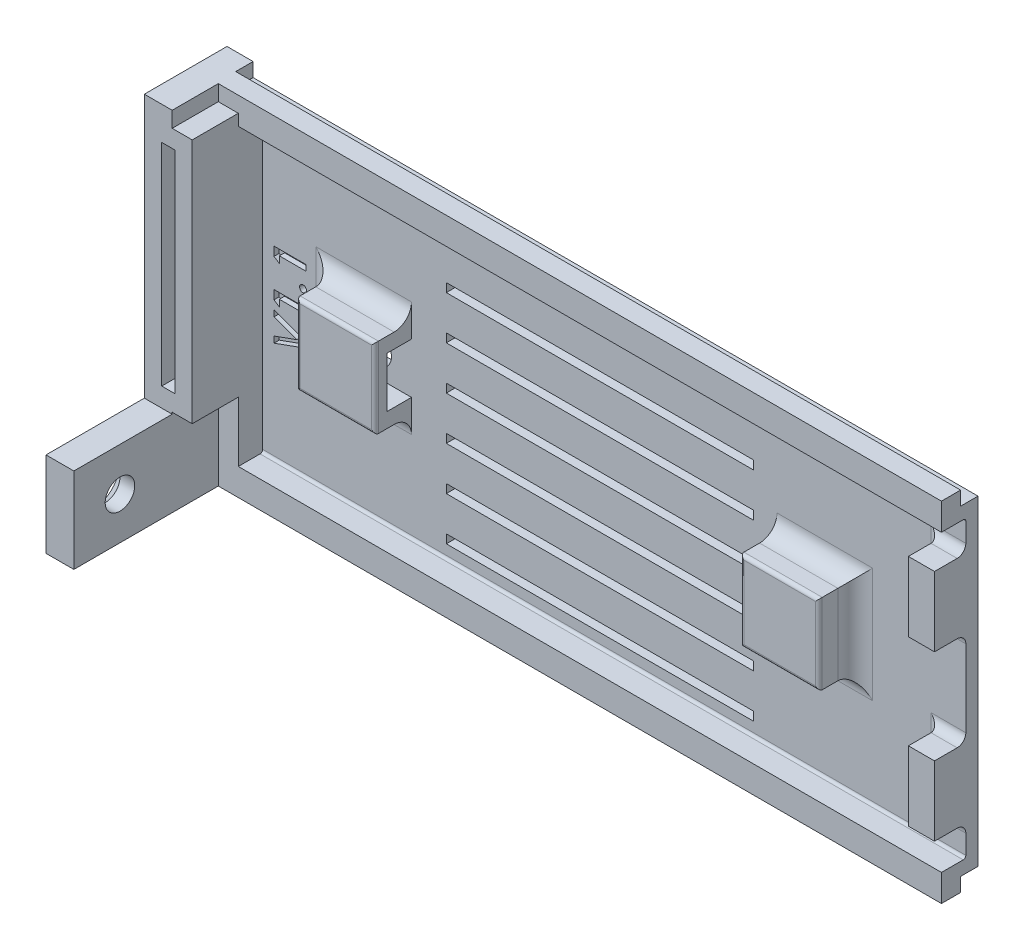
ISO-10303-21;
HEADER;
FILE_DESCRIPTION(('STEP AP214'),'2;1');
FILE_NAME('part.step','',(''),(''),'','','');
FILE_SCHEMA(('AUTOMOTIVE_DESIGN { 1 0 10303 214 1 1 1 1 }'));
ENDSEC;
DATA;
#1=APPLICATION_CONTEXT('core data for automotive mechanical design processes');
#2=APPLICATION_PROTOCOL_DEFINITION('international standard','automotive_design',2000,#1);
#3=PRODUCT_CONTEXT('',#1,'mechanical');
#4=PRODUCT('Part','Part','',(#3));
#5=PRODUCT_RELATED_PRODUCT_CATEGORY('part','',(#4));
#6=PRODUCT_DEFINITION_FORMATION('','',#4);
#7=PRODUCT_DEFINITION_CONTEXT('part definition',#1,'design');
#8=PRODUCT_DEFINITION('design','',#6,#7);
#9=PRODUCT_DEFINITION_SHAPE('','',#8);
#10=(LENGTH_UNIT() NAMED_UNIT(*) SI_UNIT(.MILLI.,.METRE.));
#11=(NAMED_UNIT(*) PLANE_ANGLE_UNIT() SI_UNIT($,.RADIAN.));
#12=(NAMED_UNIT(*) SI_UNIT($,.STERADIAN.) SOLID_ANGLE_UNIT());
#13=UNCERTAINTY_MEASURE_WITH_UNIT(LENGTH_MEASURE(1.E-05),#10,'distance_accuracy_value','');
#14=(GEOMETRIC_REPRESENTATION_CONTEXT(3) GLOBAL_UNCERTAINTY_ASSIGNED_CONTEXT((#13)) GLOBAL_UNIT_ASSIGNED_CONTEXT((#10,
#11,#12)) REPRESENTATION_CONTEXT('',''));
#15=CARTESIAN_POINT('',(0.,0.,0.));
#16=DIRECTION('',(0.,0.,1.));
#17=DIRECTION('',(1.,0.,0.));
#18=AXIS2_PLACEMENT_3D('',#15,#16,#17);
#19=CARTESIAN_POINT('',(46.65,-8.5,5.6));
#20=DIRECTION('',(-1.,0.,0.));
#21=DIRECTION('',(0.,0.,1.));
#22=AXIS2_PLACEMENT_3D('',#19,#20,#21);
#23=PLANE('',#22);
#24=DIRECTION('',(0.,0.,-1.));
#25=VECTOR('',#24,1.);
#26=CARTESIAN_POINT('',(46.65,-17.7,5.6));
#27=LINE('',#26,#25);
#28=CARTESIAN_POINT('',(46.65,-17.7,5.2));
#29=VERTEX_POINT('',#28);
#30=CARTESIAN_POINT('',(46.65,-17.7,3.4));
#31=VERTEX_POINT('',#30);
#32=EDGE_CURVE('E796',#29,#31,#27,.T.);
#33=ORIENTED_EDGE('',*,*,#32,.F.);
#34=DIRECTION('',(0.,1.,0.));
#35=VECTOR('',#34,1.);
#36=CARTESIAN_POINT('',(46.65,-8.5,5.2));
#37=LINE('',#36,#35);
#38=CARTESIAN_POINT('',(46.65,-8.5,5.2));
#39=VERTEX_POINT('',#38);
#40=EDGE_CURVE('E2135',#29,#39,#37,.T.);
#41=ORIENTED_EDGE('',*,*,#40,.T.);
#42=DIRECTION('',(0.,0.,-1.));
#43=VECTOR('',#42,1.);
#44=CARTESIAN_POINT('',(46.65,-8.5,5.6));
#45=LINE('',#44,#43);
#46=CARTESIAN_POINT('',(46.65,-8.5,3.4));
#47=VERTEX_POINT('',#46);
#48=EDGE_CURVE('E795',#39,#47,#45,.T.);
#49=ORIENTED_EDGE('',*,*,#48,.T.);
#50=CARTESIAN_POINT('',(46.65,-6.5,3.4));
#51=DIRECTION('',(-1.,0.,0.));
#52=DIRECTION('',(0.,0.,1.));
#53=AXIS2_PLACEMENT_3D('',#50,#51,#52);
#54=CIRCLE('',#53,2.);
#55=CARTESIAN_POINT('',(46.65,-6.5,1.4));
#56=VERTEX_POINT('',#55);
#57=EDGE_CURVE('E2123',#47,#56,#54,.F.);
#58=ORIENTED_EDGE('',*,*,#57,.T.);
#59=DIRECTION('',(0.,-1.,0.));
#60=VECTOR('',#59,1.);
#61=CARTESIAN_POINT('',(46.65,0.,1.4));
#62=LINE('',#61,#60);
#63=CARTESIAN_POINT('',(46.65,-10.2,1.4));
#64=VERTEX_POINT('',#63);
#65=EDGE_CURVE('E2073',#56,#64,#62,.T.);
#66=ORIENTED_EDGE('',*,*,#65,.T.);
#67=DIRECTION('',(0.,0.,1.));
#68=VECTOR('',#67,1.);
#69=CARTESIAN_POINT('',(46.65,-10.2,5.6));
#70=LINE('',#69,#68);
#71=CARTESIAN_POINT('',(46.65,-10.2,4.2));
#72=VERTEX_POINT('',#71);
#73=EDGE_CURVE('E2087',#64,#72,#70,.T.);
#74=ORIENTED_EDGE('',*,*,#73,.T.);
#75=DIRECTION('',(0.,-1.,0.));
#76=VECTOR('',#75,1.);
#77=CARTESIAN_POINT('',(46.65,-8.5,4.2));
#78=LINE('',#77,#76);
#79=CARTESIAN_POINT('',(46.65,-16.,4.2));
#80=VERTEX_POINT('',#79);
#81=EDGE_CURVE('E2085',#72,#80,#78,.T.);
#82=ORIENTED_EDGE('',*,*,#81,.T.);
#83=DIRECTION('',(0.,0.,-1.));
#84=VECTOR('',#83,1.);
#85=CARTESIAN_POINT('',(46.65,-16.,5.6));
#86=LINE('',#85,#84);
#87=CARTESIAN_POINT('',(46.65,-16.,1.4));
#88=VERTEX_POINT('',#87);
#89=EDGE_CURVE('E746',#80,#88,#86,.T.);
#90=ORIENTED_EDGE('',*,*,#89,.T.);
#91=CARTESIAN_POINT('',(46.65,-19.7,1.4));
#92=VERTEX_POINT('',#91);
#93=EDGE_CURVE('E2072',#88,#92,#62,.T.);
#94=ORIENTED_EDGE('',*,*,#93,.T.);
#95=CARTESIAN_POINT('',(46.65,-19.7,3.4));
#96=DIRECTION('',(-1.,0.,0.));
#97=DIRECTION('',(0.,0.,1.));
#98=AXIS2_PLACEMENT_3D('',#95,#96,#97);
#99=CIRCLE('',#98,2.);
#100=EDGE_CURVE('E2126',#92,#31,#99,.F.);
#101=ORIENTED_EDGE('',*,*,#100,.T.);
#102=EDGE_LOOP('',(#33,#41,#49,#58,#66,#74,#82,#90,#94,#101));
#103=FACE_BOUND('',#102,.T.);
#104=ADVANCED_FACE('F33',(#103),#23,.T.);
#105=CARTESIAN_POINT('',(4.65,-8.50000000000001,5.6));
#106=DIRECTION('',(1.,0.,0.));
#107=DIRECTION('',(0.,1.,0.));
#108=AXIS2_PLACEMENT_3D('',#105,#106,#107);
#109=PLANE('',#108);
#110=DIRECTION('',(0.,0.,-1.));
#111=VECTOR('',#110,1.);
#112=CARTESIAN_POINT('',(4.65,-8.50000000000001,5.6));
#113=LINE('',#112,#111);
#114=CARTESIAN_POINT('',(4.65,-8.50000000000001,5.2));
#115=VERTEX_POINT('',#114);
#116=CARTESIAN_POINT('',(4.65,-8.50000000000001,3.4));
#117=VERTEX_POINT('',#116);
#118=EDGE_CURVE('E809',#115,#117,#113,.T.);
#119=ORIENTED_EDGE('',*,*,#118,.F.);
#120=DIRECTION('',(0.,-1.,0.));
#121=VECTOR('',#120,1.);
#122=CARTESIAN_POINT('',(4.65,-8.50000000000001,5.2));
#123=LINE('',#122,#121);
#124=CARTESIAN_POINT('',(4.65,-17.7,5.2));
#125=VERTEX_POINT('',#124);
#126=EDGE_CURVE('E2161',#115,#125,#123,.T.);
#127=ORIENTED_EDGE('',*,*,#126,.T.);
#128=DIRECTION('',(0.,0.,-1.));
#129=VECTOR('',#128,1.);
#130=CARTESIAN_POINT('',(4.65,-17.7,5.6));
#131=LINE('',#130,#129);
#132=CARTESIAN_POINT('',(4.65,-17.7,3.4));
#133=VERTEX_POINT('',#132);
#134=EDGE_CURVE('E807',#125,#133,#131,.T.);
#135=ORIENTED_EDGE('',*,*,#134,.T.);
#136=CARTESIAN_POINT('',(4.65,-19.7,3.4));
#137=DIRECTION('',(1.,0.,0.));
#138=DIRECTION('',(0.,1.,0.));
#139=AXIS2_PLACEMENT_3D('',#136,#137,#138);
#140=CIRCLE('',#139,2.);
#141=CARTESIAN_POINT('',(4.65,-19.7,1.4));
#142=VERTEX_POINT('',#141);
#143=EDGE_CURVE('E2132',#133,#142,#140,.F.);
#144=ORIENTED_EDGE('',*,*,#143,.T.);
#145=DIRECTION('',(0.,1.,0.));
#146=VECTOR('',#145,1.);
#147=CARTESIAN_POINT('',(4.65,0.,1.4));
#148=LINE('',#147,#146);
#149=CARTESIAN_POINT('',(4.65,-16.,1.4));
#150=VERTEX_POINT('',#149);
#151=EDGE_CURVE('E2069',#142,#150,#148,.T.);
#152=ORIENTED_EDGE('',*,*,#151,.T.);
#153=DIRECTION('',(0.,0.,1.));
#154=VECTOR('',#153,1.);
#155=CARTESIAN_POINT('',(4.65,-16.,5.6));
#156=LINE('',#155,#154);
#157=CARTESIAN_POINT('',(4.65,-16.,4.2));
#158=VERTEX_POINT('',#157);
#159=EDGE_CURVE('E2082',#150,#158,#156,.T.);
#160=ORIENTED_EDGE('',*,*,#159,.T.);
#161=DIRECTION('',(0.,1.,0.));
#162=VECTOR('',#161,1.);
#163=CARTESIAN_POINT('',(4.65,-8.50000000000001,4.2));
#164=LINE('',#163,#162);
#165=CARTESIAN_POINT('',(4.65,-10.2,4.2));
#166=VERTEX_POINT('',#165);
#167=EDGE_CURVE('E2076',#158,#166,#164,.T.);
#168=ORIENTED_EDGE('',*,*,#167,.T.);
#169=DIRECTION('',(0.,0.,-1.));
#170=VECTOR('',#169,1.);
#171=CARTESIAN_POINT('',(4.65,-10.2,5.6));
#172=LINE('',#171,#170);
#173=CARTESIAN_POINT('',(4.65,-10.2,1.4));
#174=VERTEX_POINT('',#173);
#175=EDGE_CURVE('E2079',#166,#174,#172,.T.);
#176=ORIENTED_EDGE('',*,*,#175,.T.);
#177=CARTESIAN_POINT('',(4.65,-6.50000000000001,1.4));
#178=VERTEX_POINT('',#177);
#179=EDGE_CURVE('E2058',#174,#178,#148,.T.);
#180=ORIENTED_EDGE('',*,*,#179,.T.);
#181=CARTESIAN_POINT('',(4.65,-6.50000000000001,3.4));
#182=DIRECTION('',(1.,0.,0.));
#183=DIRECTION('',(0.,1.,0.));
#184=AXIS2_PLACEMENT_3D('',#181,#182,#183);
#185=CIRCLE('',#184,2.);
#186=EDGE_CURVE('E2129',#178,#117,#185,.F.);
#187=ORIENTED_EDGE('',*,*,#186,.T.);
#188=EDGE_LOOP('',(#119,#127,#135,#144,#152,#160,#168,#176,#180,#187));
#189=FACE_BOUND('',#188,.T.);
#190=ADVANCED_FACE('F1305',(#189),#109,.T.);
#191=CARTESIAN_POINT('',(50.65,-13.1,2.));
#192=DIRECTION('',(0.,0.,-1.));
#193=DIRECTION('',(-1.,0.,0.));
#194=AXIS2_PLACEMENT_3D('',#191,#192,#193);
#195=CYLINDRICAL_SURFACE('',#194,1.7);
#196=CARTESIAN_POINT('',(50.65,-13.1,0.));
#197=DIRECTION('',(0.,0.,1.));
#198=DIRECTION('',(1.,0.,0.));
#199=AXIS2_PLACEMENT_3D('',#196,#197,#198);
#200=CIRCLE('',#199,1.7);
#201=CARTESIAN_POINT('',(52.35,-13.1,0.));
#202=VERTEX_POINT('',#201);
#203=EDGE_CURVE('E806',#202,#202,#200,.T.);
#204=ORIENTED_EDGE('',*,*,#203,.F.);
#205=EDGE_LOOP('',(#204));
#206=FACE_BOUND('',#205,.T.);
#207=CARTESIAN_POINT('',(50.65,-13.1,1.4));
#208=DIRECTION('',(0.,0.,1.));
#209=DIRECTION('',(1.,0.,0.));
#210=AXIS2_PLACEMENT_3D('',#207,#208,#209);
#211=CIRCLE('',#210,1.7);
#212=CARTESIAN_POINT('',(52.35,-13.1,1.4));
#213=VERTEX_POINT('',#212);
#214=EDGE_CURVE('E771',#213,#213,#211,.T.);
#215=ORIENTED_EDGE('',*,*,#214,.T.);
#216=EDGE_LOOP('',(#215));
#217=FACE_BOUND('',#216,.T.);
#218=ADVANCED_FACE('F1311',(#206,#217),#195,.F.);
#219=CARTESIAN_POINT('',(0.649999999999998,-13.1,2.));
#220=DIRECTION('',(0.,0.,-1.));
#221=DIRECTION('',(-1.,0.,0.));
#222=AXIS2_PLACEMENT_3D('',#219,#220,#221);
#223=CYLINDRICAL_SURFACE('',#222,1.7);
#224=CARTESIAN_POINT('',(0.649999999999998,-13.1,0.));
#225=DIRECTION('',(0.,0.,1.));
#226=DIRECTION('',(1.,0.,0.));
#227=AXIS2_PLACEMENT_3D('',#224,#225,#226);
#228=CIRCLE('',#227,1.7);
#229=CARTESIAN_POINT('',(2.35,-13.1,0.));
#230=VERTEX_POINT('',#229);
#231=EDGE_CURVE('E814',#230,#230,#228,.T.);
#232=ORIENTED_EDGE('',*,*,#231,.F.);
#233=EDGE_LOOP('',(#232));
#234=FACE_BOUND('',#233,.T.);
#235=CARTESIAN_POINT('',(0.649999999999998,-13.1,1.4));
#236=DIRECTION('',(0.,0.,1.));
#237=DIRECTION('',(1.,0.,0.));
#238=AXIS2_PLACEMENT_3D('',#235,#236,#237);
#239=CIRCLE('',#238,1.7);
#240=CARTESIAN_POINT('',(2.35,-13.1,1.4));
#241=VERTEX_POINT('',#240);
#242=EDGE_CURVE('E2143',#241,#241,#239,.T.);
#243=ORIENTED_EDGE('',*,*,#242,.T.);
#244=EDGE_LOOP('',(#243));
#245=FACE_BOUND('',#244,.T.);
#246=ADVANCED_FACE('F1207',(#234,#245),#223,.F.);
#247=CARTESIAN_POINT('',(0.,0.,1.4));
#248=DIRECTION('',(0.,0.,1.));
#249=DIRECTION('',(1.,0.,0.));
#250=AXIS2_PLACEMENT_3D('',#247,#248,#249);
#251=PLANE('',#250);
#252=ORIENTED_EDGE('',*,*,#242,.F.);
#253=EDGE_LOOP('',(#252));
#254=FACE_BOUND('',#253,.T.);
#255=ORIENTED_EDGE('',*,*,#214,.F.);
#256=EDGE_LOOP('',(#255));
#257=FACE_BOUND('',#256,.T.);
#258=ORIENTED_EDGE('',*,*,#65,.F.);
#259=DIRECTION('',(-1.,0.,0.));
#260=VECTOR('',#259,1.);
#261=CARTESIAN_POINT('',(55.65,-6.50000000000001,1.4));
#262=LINE('',#261,#260);
#263=CARTESIAN_POINT('',(57.65,-6.50000000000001,1.4));
#264=VERTEX_POINT('',#263);
#265=EDGE_CURVE('E2106',#56,#264,#262,.F.);
#266=ORIENTED_EDGE('',*,*,#265,.T.);
#267=DIRECTION('',(0.,1.,0.));
#268=VECTOR('',#267,1.);
#269=CARTESIAN_POINT('',(57.65,-17.7,1.4));
#270=LINE('',#269,#268);
#271=CARTESIAN_POINT('',(57.65,-19.7,1.4));
#272=VERTEX_POINT('',#271);
#273=EDGE_CURVE('E2104',#264,#272,#270,.F.);
#274=ORIENTED_EDGE('',*,*,#273,.T.);
#275=DIRECTION('',(1.,0.,0.));
#276=VECTOR('',#275,1.);
#277=CARTESIAN_POINT('',(46.65,-19.7,1.4));
#278=LINE('',#277,#276);
#279=EDGE_CURVE('E2101',#272,#92,#278,.F.);
#280=ORIENTED_EDGE('',*,*,#279,.T.);
#281=ORIENTED_EDGE('',*,*,#93,.F.);
#282=DIRECTION('',(1.,0.,0.));
#283=VECTOR('',#282,1.);
#284=CARTESIAN_POINT('',(45.65,-16.,1.4));
#285=LINE('',#284,#283);
#286=CARTESIAN_POINT('',(54.05,-16.,1.4));
#287=VERTEX_POINT('',#286);
#288=EDGE_CURVE('E769',#88,#287,#285,.T.);
#289=ORIENTED_EDGE('',*,*,#288,.T.);
#290=DIRECTION('',(0.,1.,0.));
#291=VECTOR('',#290,1.);
#292=CARTESIAN_POINT('',(54.05,-16.,1.4));
#293=LINE('',#292,#291);
#294=CARTESIAN_POINT('',(54.05,-10.2,1.4));
#295=VERTEX_POINT('',#294);
#296=EDGE_CURVE('E757',#287,#295,#293,.T.);
#297=ORIENTED_EDGE('',*,*,#296,.T.);
#298=DIRECTION('',(-1.,0.,0.));
#299=VECTOR('',#298,1.);
#300=CARTESIAN_POINT('',(45.65,-10.2,1.4));
#301=LINE('',#300,#299);
#302=EDGE_CURVE('E751',#295,#64,#301,.T.);
#303=ORIENTED_EDGE('',*,*,#302,.T.);
#304=EDGE_LOOP('',(#258,#266,#274,#280,#281,#289,#297,#303));
#305=FACE_BOUND('',#304,.T.);
#306=DIRECTION('',(-1.,0.,0.));
#307=VECTOR('',#306,1.);
#308=CARTESIAN_POINT('',(4.65,-6.50000000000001,1.4));
#309=LINE('',#308,#307);
#310=CARTESIAN_POINT('',(-6.35,-6.50000000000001,1.4));
#311=VERTEX_POINT('',#310);
#312=EDGE_CURVE('E2098',#311,#178,#309,.F.);
#313=ORIENTED_EDGE('',*,*,#312,.T.);
#314=ORIENTED_EDGE('',*,*,#179,.F.);
#315=DIRECTION('',(-1.,0.,0.));
#316=VECTOR('',#315,1.);
#317=CARTESIAN_POINT('',(-2.75,-10.2,1.4));
#318=LINE('',#317,#316);
#319=CARTESIAN_POINT('',(-2.75,-10.2,1.4));
#320=VERTEX_POINT('',#319);
#321=EDGE_CURVE('E779',#174,#320,#318,.T.);
#322=ORIENTED_EDGE('',*,*,#321,.T.);
#323=DIRECTION('',(0.,-1.,0.));
#324=VECTOR('',#323,1.);
#325=CARTESIAN_POINT('',(-2.75,-16.,1.4));
#326=LINE('',#325,#324);
#327=CARTESIAN_POINT('',(-2.75,-16.,1.4));
#328=VERTEX_POINT('',#327);
#329=EDGE_CURVE('E758',#320,#328,#326,.T.);
#330=ORIENTED_EDGE('',*,*,#329,.T.);
#331=DIRECTION('',(1.,0.,0.));
#332=VECTOR('',#331,1.);
#333=CARTESIAN_POINT('',(-2.75,-16.,1.4));
#334=LINE('',#333,#332);
#335=EDGE_CURVE('E787',#328,#150,#334,.T.);
#336=ORIENTED_EDGE('',*,*,#335,.T.);
#337=ORIENTED_EDGE('',*,*,#151,.F.);
#338=DIRECTION('',(1.,0.,0.));
#339=VECTOR('',#338,1.);
#340=CARTESIAN_POINT('',(-4.35,-19.7,1.4));
#341=LINE('',#340,#339);
#342=CARTESIAN_POINT('',(-6.35,-19.7,1.4));
#343=VERTEX_POINT('',#342);
#344=EDGE_CURVE('E2094',#142,#343,#341,.F.);
#345=ORIENTED_EDGE('',*,*,#344,.T.);
#346=DIRECTION('',(0.,-1.,0.));
#347=VECTOR('',#346,1.);
#348=CARTESIAN_POINT('',(-6.35,-8.50000000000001,1.4));
#349=LINE('',#348,#347);
#350=EDGE_CURVE('E2096',#343,#311,#349,.F.);
#351=ORIENTED_EDGE('',*,*,#350,.T.);
#352=EDGE_LOOP('',(#313,#314,#322,#330,#336,#337,#345,#351));
#353=FACE_BOUND('',#352,.T.);
#354=DIRECTION('',(-1.,0.,0.));
#355=VECTOR('',#354,1.);
#356=CARTESIAN_POINT('',(0.,-3.575,1.4));
#357=LINE('',#356,#355);
#358=CARTESIAN_POINT('',(43.95,-3.575,1.4));
#359=VERTEX_POINT('',#358);
#360=CARTESIAN_POINT('',(8.65,-3.575,1.4));
#361=VERTEX_POINT('',#360);
#362=EDGE_CURVE('E1974',#359,#361,#357,.T.);
#363=ORIENTED_EDGE('',*,*,#362,.T.);
#364=DIRECTION('',(0.,1.,0.));
#365=VECTOR('',#364,1.);
#366=CARTESIAN_POINT('',(8.65,0.,1.4));
#367=LINE('',#366,#365);
#368=CARTESIAN_POINT('',(8.65,-2.575,1.4));
#369=VERTEX_POINT('',#368);
#370=EDGE_CURVE('E1977',#361,#369,#367,.T.);
#371=ORIENTED_EDGE('',*,*,#370,.T.);
#372=DIRECTION('',(1.,0.,0.));
#373=VECTOR('',#372,1.);
#374=CARTESIAN_POINT('',(0.,-2.575,1.4));
#375=LINE('',#374,#373);
#376=CARTESIAN_POINT('',(43.95,-2.575,1.4));
#377=VERTEX_POINT('',#376);
#378=EDGE_CURVE('E1968',#369,#377,#375,.T.);
#379=ORIENTED_EDGE('',*,*,#378,.T.);
#380=DIRECTION('',(0.,-1.,0.));
#381=VECTOR('',#380,1.);
#382=CARTESIAN_POINT('',(43.95,-3.04964387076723E-13,1.4));
#383=LINE('',#382,#381);
#384=EDGE_CURVE('E1971',#377,#359,#383,.T.);
#385=ORIENTED_EDGE('',*,*,#384,.T.);
#386=EDGE_LOOP('',(#363,#371,#379,#385));
#387=FACE_BOUND('',#386,.T.);
#388=DIRECTION('',(1.,0.,0.));
#389=VECTOR('',#388,1.);
#390=CARTESIAN_POINT('',(0.,2.425,1.4));
#391=LINE('',#390,#389);
#392=CARTESIAN_POINT('',(8.65,2.425,1.4));
#393=VERTEX_POINT('',#392);
#394=CARTESIAN_POINT('',(43.95,2.425,1.4));
#395=VERTEX_POINT('',#394);
#396=EDGE_CURVE('E1881',#393,#395,#391,.T.);
#397=ORIENTED_EDGE('',*,*,#396,.T.);
#398=DIRECTION('',(0.,-1.,0.));
#399=VECTOR('',#398,1.);
#400=CARTESIAN_POINT('',(43.95,0.,1.4));
#401=LINE('',#400,#399);
#402=CARTESIAN_POINT('',(43.95,1.425,1.4));
#403=VERTEX_POINT('',#402);
#404=EDGE_CURVE('E1884',#395,#403,#401,.T.);
#405=ORIENTED_EDGE('',*,*,#404,.T.);
#406=DIRECTION('',(-1.,0.,0.));
#407=VECTOR('',#406,1.);
#408=CARTESIAN_POINT('',(0.,1.425,1.4));
#409=LINE('',#408,#407);
#410=CARTESIAN_POINT('',(8.65,1.425,1.4));
#411=VERTEX_POINT('',#410);
#412=EDGE_CURVE('E1835',#403,#411,#409,.T.);
#413=ORIENTED_EDGE('',*,*,#412,.T.);
#414=DIRECTION('',(0.,1.,0.));
#415=VECTOR('',#414,1.);
#416=CARTESIAN_POINT('',(8.65,0.,1.4));
#417=LINE('',#416,#415);
#418=EDGE_CURVE('E1878',#411,#393,#417,.T.);
#419=ORIENTED_EDGE('',*,*,#418,.T.);
#420=EDGE_LOOP('',(#397,#405,#413,#419));
#421=FACE_BOUND('',#420,.T.);
#422=DIRECTION('',(-1.,0.,0.));
#423=VECTOR('',#422,1.);
#424=CARTESIAN_POINT('',(0.,-18.575,1.4));
#425=LINE('',#424,#423);
#426=CARTESIAN_POINT('',(43.95,-18.575,1.4));
#427=VERTEX_POINT('',#426);
#428=CARTESIAN_POINT('',(8.65,-18.575,1.4));
#429=VERTEX_POINT('',#428);
#430=EDGE_CURVE('E1893',#427,#429,#425,.T.);
#431=ORIENTED_EDGE('',*,*,#430,.T.);
#432=DIRECTION('',(0.,1.,0.));
#433=VECTOR('',#432,1.);
#434=CARTESIAN_POINT('',(8.64999999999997,0.,1.4));
#435=LINE('',#434,#433);
#436=CARTESIAN_POINT('',(8.65,-17.575,1.4));
#437=VERTEX_POINT('',#436);
#438=EDGE_CURVE('E1896',#429,#437,#435,.T.);
#439=ORIENTED_EDGE('',*,*,#438,.T.);
#440=DIRECTION('',(1.,0.,0.));
#441=VECTOR('',#440,1.);
#442=CARTESIAN_POINT('',(0.,-17.575,1.4));
#443=LINE('',#442,#441);
#444=CARTESIAN_POINT('',(43.95,-17.575,1.4));
#445=VERTEX_POINT('',#444);
#446=EDGE_CURVE('E1887',#437,#445,#443,.T.);
#447=ORIENTED_EDGE('',*,*,#446,.T.);
#448=DIRECTION('',(0.,-1.,0.));
#449=VECTOR('',#448,1.);
#450=CARTESIAN_POINT('',(43.95,0.,1.4));
#451=LINE('',#450,#449);
#452=EDGE_CURVE('E1890',#445,#427,#451,.T.);
#453=ORIENTED_EDGE('',*,*,#452,.T.);
#454=EDGE_LOOP('',(#431,#439,#447,#453));
#455=FACE_BOUND('',#454,.T.);
#456=DIRECTION('',(-1.,0.,0.));
#457=VECTOR('',#456,1.);
#458=CARTESIAN_POINT('',(0.,-8.575,1.4));
#459=LINE('',#458,#457);
#460=CARTESIAN_POINT('',(43.95,-8.575,1.4));
#461=VERTEX_POINT('',#460);
#462=CARTESIAN_POINT('',(8.65,-8.575,1.4));
#463=VERTEX_POINT('',#462);
#464=EDGE_CURVE('E1905',#461,#463,#459,.T.);
#465=ORIENTED_EDGE('',*,*,#464,.T.);
#466=DIRECTION('',(0.,1.,0.));
#467=VECTOR('',#466,1.);
#468=CARTESIAN_POINT('',(8.65,0.,1.4));
#469=LINE('',#468,#467);
#470=CARTESIAN_POINT('',(8.65,-7.575,1.4));
#471=VERTEX_POINT('',#470);
#472=EDGE_CURVE('E1908',#463,#471,#469,.T.);
#473=ORIENTED_EDGE('',*,*,#472,.T.);
#474=DIRECTION('',(1.,0.,0.));
#475=VECTOR('',#474,1.);
#476=CARTESIAN_POINT('',(0.,-7.575,1.4));
#477=LINE('',#476,#475);
#478=CARTESIAN_POINT('',(43.95,-7.575,1.4));
#479=VERTEX_POINT('',#478);
#480=EDGE_CURVE('E1899',#471,#479,#477,.T.);
#481=ORIENTED_EDGE('',*,*,#480,.T.);
#482=DIRECTION('',(0.,-1.,0.));
#483=VECTOR('',#482,1.);
#484=CARTESIAN_POINT('',(43.95,0.,1.4));
#485=LINE('',#484,#483);
#486=EDGE_CURVE('E1902',#479,#461,#485,.T.);
#487=ORIENTED_EDGE('',*,*,#486,.T.);
#488=EDGE_LOOP('',(#465,#473,#481,#487));
#489=FACE_BOUND('',#488,.T.);
#490=DIRECTION('',(-1.,0.,0.));
#491=VECTOR('',#490,1.);
#492=CARTESIAN_POINT('',(0.,-13.575,1.4));
#493=LINE('',#492,#491);
#494=CARTESIAN_POINT('',(43.95,-13.575,1.4));
#495=VERTEX_POINT('',#494);
#496=CARTESIAN_POINT('',(8.65,-13.575,1.4));
#497=VERTEX_POINT('',#496);
#498=EDGE_CURVE('E1917',#495,#497,#493,.T.);
#499=ORIENTED_EDGE('',*,*,#498,.T.);
#500=DIRECTION('',(0.,1.,0.));
#501=VECTOR('',#500,1.);
#502=CARTESIAN_POINT('',(8.65,0.,1.4));
#503=LINE('',#502,#501);
#504=CARTESIAN_POINT('',(8.65,-12.575,1.4));
#505=VERTEX_POINT('',#504);
#506=EDGE_CURVE('E1920',#497,#505,#503,.T.);
#507=ORIENTED_EDGE('',*,*,#506,.T.);
#508=DIRECTION('',(1.,0.,0.));
#509=VECTOR('',#508,1.);
#510=CARTESIAN_POINT('',(0.,-12.575,1.4));
#511=LINE('',#510,#509);
#512=CARTESIAN_POINT('',(43.95,-12.575,1.4));
#513=VERTEX_POINT('',#512);
#514=EDGE_CURVE('E1911',#505,#513,#511,.T.);
#515=ORIENTED_EDGE('',*,*,#514,.T.);
#516=DIRECTION('',(0.,-1.,0.));
#517=VECTOR('',#516,1.);
#518=CARTESIAN_POINT('',(43.9500000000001,-3.04964387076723E-13,1.4));
#519=LINE('',#518,#517);
#520=EDGE_CURVE('E1914',#513,#495,#519,.T.);
#521=ORIENTED_EDGE('',*,*,#520,.T.);
#522=EDGE_LOOP('',(#499,#507,#515,#521));
#523=FACE_BOUND('',#522,.T.);
#524=DIRECTION('',(1.,0.,0.));
#525=VECTOR('',#524,1.);
#526=CARTESIAN_POINT('',(0.,-22.575,1.4));
#527=LINE('',#526,#525);
#528=CARTESIAN_POINT('',(8.65,-22.575,1.4));
#529=VERTEX_POINT('',#528);
#530=CARTESIAN_POINT('',(43.95,-22.575,1.4));
#531=VERTEX_POINT('',#530);
#532=EDGE_CURVE('E1929',#529,#531,#527,.T.);
#533=ORIENTED_EDGE('',*,*,#532,.T.);
#534=DIRECTION('',(0.,-1.,0.));
#535=VECTOR('',#534,1.);
#536=CARTESIAN_POINT('',(43.95,0.,1.4));
#537=LINE('',#536,#535);
#538=CARTESIAN_POINT('',(43.95,-23.575,1.4));
#539=VERTEX_POINT('',#538);
#540=EDGE_CURVE('E1932',#531,#539,#537,.T.);
#541=ORIENTED_EDGE('',*,*,#540,.T.);
#542=DIRECTION('',(-1.,0.,0.));
#543=VECTOR('',#542,1.);
#544=CARTESIAN_POINT('',(0.,-23.575,1.4));
#545=LINE('',#544,#543);
#546=CARTESIAN_POINT('',(8.65,-23.575,1.4));
#547=VERTEX_POINT('',#546);
#548=EDGE_CURVE('E1923',#539,#547,#545,.T.);
#549=ORIENTED_EDGE('',*,*,#548,.T.);
#550=DIRECTION('',(0.,1.,0.));
#551=VECTOR('',#550,1.);
#552=CARTESIAN_POINT('',(8.64999999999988,0.,1.4));
#553=LINE('',#552,#551);
#554=EDGE_CURVE('E1926',#547,#529,#553,.T.);
#555=ORIENTED_EDGE('',*,*,#554,.T.);
#556=EDGE_LOOP('',(#533,#541,#549,#555));
#557=FACE_BOUND('',#556,.T.);
#558=DIRECTION('',(1.,0.,0.));
#559=VECTOR('',#558,1.);
#560=CARTESIAN_POINT('',(0.,-27.575,1.4));
#561=LINE('',#560,#559);
#562=CARTESIAN_POINT('',(8.65,-27.575,1.4));
#563=VERTEX_POINT('',#562);
#564=CARTESIAN_POINT('',(43.95,-27.575,1.4));
#565=VERTEX_POINT('',#564);
#566=EDGE_CURVE('E1941',#563,#565,#561,.T.);
#567=ORIENTED_EDGE('',*,*,#566,.T.);
#568=DIRECTION('',(0.,-1.,0.));
#569=VECTOR('',#568,1.);
#570=CARTESIAN_POINT('',(43.95,0.,1.4));
#571=LINE('',#570,#569);
#572=CARTESIAN_POINT('',(43.95,-28.575,1.4));
#573=VERTEX_POINT('',#572);
#574=EDGE_CURVE('E1944',#565,#573,#571,.T.);
#575=ORIENTED_EDGE('',*,*,#574,.T.);
#576=DIRECTION('',(-1.,0.,0.));
#577=VECTOR('',#576,1.);
#578=CARTESIAN_POINT('',(0.,-28.575,1.4));
#579=LINE('',#578,#577);
#580=CARTESIAN_POINT('',(8.65,-28.575,1.4));
#581=VERTEX_POINT('',#580);
#582=EDGE_CURVE('E1935',#573,#581,#579,.T.);
#583=ORIENTED_EDGE('',*,*,#582,.T.);
#584=DIRECTION('',(0.,1.,0.));
#585=VECTOR('',#584,1.);
#586=CARTESIAN_POINT('',(8.64999999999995,0.,1.4));
#587=LINE('',#586,#585);
#588=EDGE_CURVE('E1938',#581,#563,#587,.T.);
#589=ORIENTED_EDGE('',*,*,#588,.T.);
#590=EDGE_LOOP('',(#567,#575,#583,#589));
#591=FACE_BOUND('',#590,.T.);
#592=DIRECTION('',(0.,-1.,0.));
#593=VECTOR('',#592,1.);
#594=CARTESIAN_POINT('',(64.35,0.,1.4));
#595=LINE('',#594,#593);
#596=CARTESIAN_POINT('',(64.35,-8.675,1.4));
#597=VERTEX_POINT('',#596);
#598=CARTESIAN_POINT('',(64.35,1.325,1.4));
#599=VERTEX_POINT('',#598);
#600=EDGE_CURVE('E2033',#597,#599,#595,.F.);
#601=ORIENTED_EDGE('',*,*,#600,.T.);
#602=DIRECTION('',(-1.,0.,0.));
#603=VECTOR('',#602,1.);
#604=CARTESIAN_POINT('',(0.,1.325,1.4));
#605=LINE('',#604,#603);
#606=CARTESIAN_POINT('',(68.35,1.325,1.4));
#607=VERTEX_POINT('',#606);
#608=EDGE_CURVE('E2037',#599,#607,#605,.F.);
#609=ORIENTED_EDGE('',*,*,#608,.T.);
#610=DIRECTION('',(0.,1.,0.));
#611=VECTOR('',#610,1.);
#612=CARTESIAN_POINT('',(68.35,6.925,1.4));
#613=LINE('',#612,#611);
#614=CARTESIAN_POINT('',(68.35,3.525,1.4));
#615=VERTEX_POINT('',#614);
#616=EDGE_CURVE('E1997',#607,#615,#613,.T.);
#617=ORIENTED_EDGE('',*,*,#616,.T.);
#618=DIRECTION('',(1.,0.,0.));
#619=VECTOR('',#618,1.);
#620=CARTESIAN_POINT('',(0.,3.525,1.4));
#621=LINE('',#620,#619);
#622=CARTESIAN_POINT('',(-12.45,3.525,1.4));
#623=VERTEX_POINT('',#622);
#624=EDGE_CURVE('E2010',#615,#623,#621,.F.);
#625=ORIENTED_EDGE('',*,*,#624,.T.);
#626=DIRECTION('',(0.,1.,0.));
#627=VECTOR('',#626,1.);
#628=CARTESIAN_POINT('',(-12.45,-33.125,1.4));
#629=LINE('',#628,#627);
#630=CARTESIAN_POINT('',(-12.45,-29.725,1.4));
#631=VERTEX_POINT('',#630);
#632=EDGE_CURVE('E1678',#631,#623,#629,.T.);
#633=ORIENTED_EDGE('',*,*,#632,.F.);
#634=DIRECTION('',(-1.,0.,0.));
#635=VECTOR('',#634,1.);
#636=CARTESIAN_POINT('',(0.,-29.725,1.4));
#637=LINE('',#636,#635);
#638=CARTESIAN_POINT('',(68.35,-29.725,1.4));
#639=VERTEX_POINT('',#638);
#640=EDGE_CURVE('E2008',#631,#639,#637,.F.);
#641=ORIENTED_EDGE('',*,*,#640,.T.);
#642=CARTESIAN_POINT('',(68.35,-27.525,1.4));
#643=VERTEX_POINT('',#642);
#644=EDGE_CURVE('E1992',#639,#643,#613,.T.);
#645=ORIENTED_EDGE('',*,*,#644,.T.);
#646=DIRECTION('',(1.,0.,0.));
#647=VECTOR('',#646,1.);
#648=CARTESIAN_POINT('',(0.,-27.525,1.4));
#649=LINE('',#648,#647);
#650=CARTESIAN_POINT('',(64.35,-27.525,1.4));
#651=VERTEX_POINT('',#650);
#652=EDGE_CURVE('E2027',#643,#651,#649,.F.);
#653=ORIENTED_EDGE('',*,*,#652,.T.);
#654=DIRECTION('',(0.,-1.,0.));
#655=VECTOR('',#654,1.);
#656=CARTESIAN_POINT('',(64.35,0.,1.4));
#657=LINE('',#656,#655);
#658=CARTESIAN_POINT('',(64.35,-17.525,1.4));
#659=VERTEX_POINT('',#658);
#660=EDGE_CURVE('E2029',#651,#659,#657,.F.);
#661=ORIENTED_EDGE('',*,*,#660,.T.);
#662=DIRECTION('',(-1.,0.,0.));
#663=VECTOR('',#662,1.);
#664=CARTESIAN_POINT('',(0.,-17.525,1.4));
#665=LINE('',#664,#663);
#666=CARTESIAN_POINT('',(68.35,-17.525,1.4));
#667=VERTEX_POINT('',#666);
#668=EDGE_CURVE('E2031',#659,#667,#665,.F.);
#669=ORIENTED_EDGE('',*,*,#668,.T.);
#670=CARTESIAN_POINT('',(68.35,-8.675,1.4));
#671=VERTEX_POINT('',#670);
#672=EDGE_CURVE('E1996',#667,#671,#613,.T.);
#673=ORIENTED_EDGE('',*,*,#672,.T.);
#674=DIRECTION('',(1.,0.,0.));
#675=VECTOR('',#674,1.);
#676=CARTESIAN_POINT('',(0.,-8.675,1.4));
#677=LINE('',#676,#675);
#678=EDGE_CURVE('E2035',#671,#597,#677,.F.);
#679=ORIENTED_EDGE('',*,*,#678,.T.);
#680=EDGE_LOOP('',(#601,#609,#617,#625,#633,#641,#645,#653,#661,#669,#673,#679));
#681=FACE_BOUND('',#680,.T.);
#682=DIRECTION('',(0.,-1.,0.));
#683=VECTOR('',#682,1.);
#684=CARTESIAN_POINT('',(-7.44999999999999,-16.5250817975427,1.4));
#685=LINE('',#684,#683);
#686=CARTESIAN_POINT('',(-7.44999999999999,-16.5250817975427,1.4));
#687=VERTEX_POINT('',#686);
#688=CARTESIAN_POINT('',(-7.44999999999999,-17.1654455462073,1.4));
#689=VERTEX_POINT('',#688);
#690=EDGE_CURVE('E1477',#687,#689,#685,.T.);
#691=ORIENTED_EDGE('',*,*,#690,.T.);
#692=DIRECTION('',(-0.940292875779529,-0.340366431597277,0.));
#693=VECTOR('',#692,1.);
#694=CARTESIAN_POINT('',(-7.44999999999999,-17.1654455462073,1.4));
#695=LINE('',#694,#693);
#696=CARTESIAN_POINT('',(-11.1541666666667,-18.5062767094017,1.4));
#697=VERTEX_POINT('',#696);
#698=EDGE_CURVE('E864',#689,#697,#695,.T.);
#699=ORIENTED_EDGE('',*,*,#698,.T.);
#700=DIRECTION('',(0.,1.,0.));
#701=VECTOR('',#700,1.);
#702=CARTESIAN_POINT('',(-11.1541666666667,-18.5062767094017,1.4));
#703=LINE('',#702,#701);
#704=CARTESIAN_POINT('',(-11.1541666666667,-17.7961630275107,1.4));
#705=VERTEX_POINT('',#704);
#706=EDGE_CURVE('E1492',#697,#705,#703,.T.);
#707=ORIENTED_EDGE('',*,*,#706,.T.);
#708=DIRECTION('',(0.940341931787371,0.340230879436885,0.));
#709=VECTOR('',#708,1.);
#710=CARTESIAN_POINT('',(-11.1541666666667,-17.7961630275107,1.4));
#711=LINE('',#710,#709);
#712=CARTESIAN_POINT('',(-8.52296173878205,-16.8441506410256,1.4));
#713=VERTEX_POINT('',#712);
#714=EDGE_CURVE('E1495',#705,#713,#711,.T.);
#715=ORIENTED_EDGE('',*,*,#714,.T.);
#716=DIRECTION('',(-0.940087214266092,0.340934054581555,0.));
#717=VECTOR('',#716,1.);
#718=CARTESIAN_POINT('',(-8.52296173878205,-16.8441506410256,1.4));
#719=LINE('',#718,#717);
#720=CARTESIAN_POINT('',(-11.1541666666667,-15.8899121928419,1.4));
#721=VERTEX_POINT('',#720);
#722=EDGE_CURVE('E1498',#713,#721,#719,.T.);
#723=ORIENTED_EDGE('',*,*,#722,.T.);
#724=DIRECTION('',(0.,1.,0.));
#725=VECTOR('',#724,1.);
#726=CARTESIAN_POINT('',(-11.1541666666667,-15.8899121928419,1.4));
#727=LINE('',#726,#725);
#728=CARTESIAN_POINT('',(-11.1541666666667,-15.1820245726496,1.4));
#729=VERTEX_POINT('',#728);
#730=EDGE_CURVE('E1501',#721,#729,#727,.T.);
#731=ORIENTED_EDGE('',*,*,#730,.T.);
#732=DIRECTION('',(0.940111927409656,-0.340865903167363,0.));
#733=VECTOR('',#732,1.);
#734=CARTESIAN_POINT('',(-11.1541666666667,-15.1820245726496,1.4));
#735=LINE('',#734,#733);
#736=EDGE_CURVE('E1504',#729,#687,#735,.T.);
#737=ORIENTED_EDGE('',*,*,#736,.T.);
#738=EDGE_LOOP('',(#691,#699,#707,#715,#723,#731,#737));
#739=FACE_BOUND('',#738,.T.);
#740=DIRECTION('',(0.,-1.,0.));
#741=VECTOR('',#740,1.);
#742=CARTESIAN_POINT('',(-10.5368055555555,-9.50705128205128,1.4));
#743=LINE('',#742,#741);
#744=CARTESIAN_POINT('',(-10.5368055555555,-9.50705128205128,1.4));
#745=VERTEX_POINT('',#744);
#746=CARTESIAN_POINT('',(-10.5368055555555,-10.2668803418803,1.4));
#747=VERTEX_POINT('',#746);
#748=EDGE_CURVE('E1434',#745,#747,#743,.T.);
#749=ORIENTED_EDGE('',*,*,#748,.T.);
#750=DIRECTION('',(-0.841112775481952,0.540859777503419,0.));
#751=VECTOR('',#750,1.);
#752=CARTESIAN_POINT('',(-10.5368055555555,-10.2668803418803,1.4));
#753=LINE('',#752,#751);
#754=CARTESIAN_POINT('',(-11.1541666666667,-9.8698993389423,1.4));
#755=VERTEX_POINT('',#754);
#756=EDGE_CURVE('E817',#747,#755,#753,.T.);
#757=ORIENTED_EDGE('',*,*,#756,.T.);
#758=DIRECTION('',(0.,1.,0.));
#759=VECTOR('',#758,1.);
#760=CARTESIAN_POINT('',(-11.1541666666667,-9.8698993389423,1.4));
#761=LINE('',#760,#759);
#762=CARTESIAN_POINT('',(-11.1541666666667,-8.84220085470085,1.4));
#763=VERTEX_POINT('',#762);
#764=EDGE_CURVE('E1447',#755,#763,#761,.T.);
#765=ORIENTED_EDGE('',*,*,#764,.T.);
#766=DIRECTION('',(1.,0.,0.));
#767=VECTOR('',#766,1.);
#768=CARTESIAN_POINT('',(-11.1541666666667,-8.84220085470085,1.4));
#769=LINE('',#768,#767);
#770=CARTESIAN_POINT('',(-7.44999999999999,-8.84220085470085,1.4));
#771=VERTEX_POINT('',#770);
#772=EDGE_CURVE('E1450',#763,#771,#769,.T.);
#773=ORIENTED_EDGE('',*,*,#772,.T.);
#774=DIRECTION('',(0.,-1.,0.));
#775=VECTOR('',#774,1.);
#776=CARTESIAN_POINT('',(-7.44999999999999,-8.84220085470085,1.4));
#777=LINE('',#776,#775);
#778=CARTESIAN_POINT('',(-7.44999999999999,-9.50705128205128,1.4));
#779=VERTEX_POINT('',#778);
#780=EDGE_CURVE('E1453',#771,#779,#777,.T.);
#781=ORIENTED_EDGE('',*,*,#780,.T.);
#782=DIRECTION('',(-1.,0.,0.));
#783=VECTOR('',#782,1.);
#784=CARTESIAN_POINT('',(-7.44999999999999,-9.50705128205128,1.4));
#785=LINE('',#784,#783);
#786=EDGE_CURVE('E1456',#779,#745,#785,.T.);
#787=ORIENTED_EDGE('',*,*,#786,.T.);
#788=EDGE_LOOP('',(#749,#757,#765,#773,#781,#787));
#789=FACE_BOUND('',#788,.T.);
#790=CARTESIAN_POINT('',(-7.40251068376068,-11.4303685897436,1.4));
#791=CARTESIAN_POINT('',(-7.4038886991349,-11.4572395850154,1.4));
#792=CARTESIAN_POINT('',(-7.40660533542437,-11.5102133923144,1.4));
#793=CARTESIAN_POINT('',(-7.42967807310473,-11.5863797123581,1.4));
#794=CARTESIAN_POINT('',(-7.46772144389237,-11.65620000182,1.4));
#795=CARTESIAN_POINT('',(-7.51964355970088,-11.7176083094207,1.4));
#796=CARTESIAN_POINT('',(-7.58088349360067,-11.7697017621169,1.4));
#797=CARTESIAN_POINT('',(-7.65111930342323,-11.8066934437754,1.4));
#798=CARTESIAN_POINT('',(-7.7272781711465,-11.8300598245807,1.4));
#799=CARTESIAN_POINT('',(-7.78052354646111,-11.8326884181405,1.4));
#800=CARTESIAN_POINT('',(-7.80765391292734,-11.8340277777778,1.4));
#801=B_SPLINE_CURVE_WITH_KNOTS('',3,(#790,#791,#792,#793,#794,#795,#796,#797,#798,#799,#800),
.UNSPECIFIED.,.F.,.F.,(4,1,1,1,1,1,1,1,4),(0.,0.126667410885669,0.249713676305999,
0.371998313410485,0.499695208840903,0.627392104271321,0.749123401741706,0.872169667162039,1.),.UNSPECIFIED.);
#802=CARTESIAN_POINT('',(-7.40251068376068,-11.4303685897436,1.4));
#803=VERTEX_POINT('',#802);
#804=CARTESIAN_POINT('',(-7.80765391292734,-11.8340277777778,1.4));
#805=VERTEX_POINT('',#804);
#806=EDGE_CURVE('E872',#803,#805,#801,.T.);
#807=ORIENTED_EDGE('',*,*,#806,.T.);
#808=CARTESIAN_POINT('',(-7.80765391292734,-11.8340277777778,1.4));
#809=CARTESIAN_POINT('',(-7.83479474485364,-11.8327211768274,1.4));
#810=CARTESIAN_POINT('',(-7.88782306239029,-11.8301683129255,1.4));
#811=CARTESIAN_POINT('',(-7.96361834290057,-11.8064958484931,1.4));
#812=CARTESIAN_POINT('',(-8.03360490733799,-11.7699169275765,1.4));
#813=CARTESIAN_POINT('',(-8.09418212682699,-11.7175409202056,1.4));
#814=CARTESIAN_POINT('',(-8.14546729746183,-11.6561847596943,1.4));
#815=CARTESIAN_POINT('',(-8.18252416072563,-11.5861800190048,1.4));
#816=CARTESIAN_POINT('',(-8.2057790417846,-11.5102358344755,1.4));
#817=CARTESIAN_POINT('',(-8.20846606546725,-11.4572471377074,1.4));
#818=CARTESIAN_POINT('',(-8.20982905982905,-11.4303685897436,1.4));
#819=B_SPLINE_CURVE_WITH_KNOTS('',3,(#808,#809,#810,#811,#812,#813,#814,#815,#816,#817,#818),
.UNSPECIFIED.,.F.,.F.,(4,1,1,1,1,1,1,1,4),(0.,0.128255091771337,0.250587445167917,
0.372723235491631,0.499946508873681,0.62732077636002,0.749456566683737,0.872911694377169,1.),.UNSPECIFIED.);
#820=CARTESIAN_POINT('',(-8.20982905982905,-11.4303685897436,1.4));
#821=VERTEX_POINT('',#820);
#822=EDGE_CURVE('E1387',#805,#821,#819,.T.);
#823=ORIENTED_EDGE('',*,*,#822,.T.);
#824=CARTESIAN_POINT('',(-8.20982905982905,-11.4303685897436,1.4));
#825=CARTESIAN_POINT('',(-8.20845485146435,-11.4034962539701,1.4));
#826=CARTESIAN_POINT('',(-8.20574572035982,-11.3505198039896,1.4));
#827=CARTESIAN_POINT('',(-8.18271644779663,-11.2746968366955,1.4));
#828=CARTESIAN_POINT('',(-8.14521231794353,-11.2051974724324,1.4));
#829=CARTESIAN_POINT('',(-8.09424451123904,-11.1438613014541,1.4));
#830=CARTESIAN_POINT('',(-8.03338574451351,-11.0917153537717,1.4));
#831=CARTESIAN_POINT('',(-7.96384199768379,-11.0540738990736,1.4));
#832=CARTESIAN_POINT('',(-7.88779383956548,-11.0306223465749,1.4));
#833=CARTESIAN_POINT('',(-7.83478485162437,-11.028034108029,1.4));
#834=CARTESIAN_POINT('',(-7.80765391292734,-11.0267094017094,1.4));
#835=B_SPLINE_CURVE_WITH_KNOTS('',3,(#824,#825,#826,#827,#828,#829,#830,#831,#832,#833,#834),
.UNSPECIFIED.,.F.,.F.,(4,1,1,1,1,1,1,1,4),(0.,0.127149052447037,0.250663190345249,
0.371823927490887,0.499259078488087,0.626543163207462,0.749292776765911,0.871683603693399,1.),.UNSPECIFIED.);
#836=CARTESIAN_POINT('',(-7.80765391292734,-11.0267094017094,1.4));
#837=VERTEX_POINT('',#836);
#838=EDGE_CURVE('E1395',#821,#837,#835,.T.);
#839=ORIENTED_EDGE('',*,*,#838,.T.);
#840=CARTESIAN_POINT('',(-7.80765391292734,-11.0267094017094,1.4));
#841=CARTESIAN_POINT('',(-7.78053343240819,-11.0280668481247,1.4));
#842=CARTESIAN_POINT('',(-7.72730745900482,-11.0307309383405,1.4));
#843=CARTESIAN_POINT('',(-7.65089443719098,-11.0538739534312,1.4));
#844=CARTESIAN_POINT('',(-7.58110393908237,-11.0919326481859,1.4));
#845=CARTESIAN_POINT('',(-7.51958041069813,-11.1437928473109,1.4));
#846=CARTESIAN_POINT('',(-7.46797849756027,-11.2051860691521,1.4));
#847=CARTESIAN_POINT('',(-7.42948545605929,-11.2744945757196,1.4));
#848=CARTESIAN_POINT('',(-7.40663891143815,-11.3505427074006,1.4));
#849=CARTESIAN_POINT('',(-7.40389999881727,-11.4035039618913,1.4));
#850=CARTESIAN_POINT('',(-7.40251068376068,-11.4303685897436,1.4));
#851=B_SPLINE_CURVE_WITH_KNOTS('',3,(#840,#841,#842,#843,#844,#845,#846,#847,#848,#849,#850),
.UNSPECIFIED.,.F.,.F.,(4,1,1,1,1,1,1,1,4),(0.,0.12789063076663,0.250994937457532,
0.373337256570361,0.501094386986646,0.628851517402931,0.750168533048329,0.873272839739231,1.),.UNSPECIFIED.);
#852=EDGE_CURVE('E1404',#837,#803,#851,.T.);
#853=ORIENTED_EDGE('',*,*,#852,.T.);
#854=EDGE_LOOP('',(#807,#823,#839,#853));
#855=FACE_BOUND('',#854,.T.);
#856=DIRECTION('',(0.,-1.,0.));
#857=VECTOR('',#856,1.);
#858=CARTESIAN_POINT('',(-10.5368055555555,-13.8285790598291,1.4));
#859=LINE('',#858,#857);
#860=CARTESIAN_POINT('',(-10.5368055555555,-13.8285790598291,1.4));
#861=VERTEX_POINT('',#860);
#862=CARTESIAN_POINT('',(-10.5368055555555,-14.5884081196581,1.4));
#863=VERTEX_POINT('',#862);
#864=EDGE_CURVE('E822',#861,#863,#859,.T.);
#865=ORIENTED_EDGE('',*,*,#864,.T.);
#866=DIRECTION('',(-0.841112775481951,0.54085977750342,0.));
#867=VECTOR('',#866,1.);
#868=CARTESIAN_POINT('',(-10.5368055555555,-14.5884081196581,1.4));
#869=LINE('',#868,#867);
#870=CARTESIAN_POINT('',(-11.1541666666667,-14.1914271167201,1.4));
#871=VERTEX_POINT('',#870);
#872=EDGE_CURVE('E833',#863,#871,#869,.T.);
#873=ORIENTED_EDGE('',*,*,#872,.T.);
#874=DIRECTION('',(0.,1.,0.));
#875=VECTOR('',#874,1.);
#876=CARTESIAN_POINT('',(-11.1541666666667,-14.1914271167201,1.4));
#877=LINE('',#876,#875);
#878=CARTESIAN_POINT('',(-11.1541666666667,-13.1637286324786,1.4));
#879=VERTEX_POINT('',#878);
#880=EDGE_CURVE('E836',#871,#879,#877,.T.);
#881=ORIENTED_EDGE('',*,*,#880,.T.);
#882=DIRECTION('',(1.,0.,0.));
#883=VECTOR('',#882,1.);
#884=CARTESIAN_POINT('',(-11.1541666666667,-13.1637286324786,1.4));
#885=LINE('',#884,#883);
#886=CARTESIAN_POINT('',(-7.44999999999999,-13.1637286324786,1.4));
#887=VERTEX_POINT('',#886);
#888=EDGE_CURVE('E840',#879,#887,#885,.T.);
#889=ORIENTED_EDGE('',*,*,#888,.T.);
#890=DIRECTION('',(0.,-1.,0.));
#891=VECTOR('',#890,1.);
#892=CARTESIAN_POINT('',(-7.44999999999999,-13.1637286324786,1.4));
#893=LINE('',#892,#891);
#894=CARTESIAN_POINT('',(-7.44999999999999,-13.8285790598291,1.4));
#895=VERTEX_POINT('',#894);
#896=EDGE_CURVE('E843',#887,#895,#893,.T.);
#897=ORIENTED_EDGE('',*,*,#896,.T.);
#898=DIRECTION('',(-1.,0.,0.));
#899=VECTOR('',#898,1.);
#900=CARTESIAN_POINT('',(-7.44999999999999,-13.8285790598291,1.4));
#901=LINE('',#900,#899);
#902=EDGE_CURVE('E846',#895,#861,#901,.T.);
#903=ORIENTED_EDGE('',*,*,#902,.T.);
#904=EDGE_LOOP('',(#865,#873,#881,#889,#897,#903));
#905=FACE_BOUND('',#904,.T.);
#906=ADVANCED_FACE('F1199',(#254,#257,#305,#353,#387,#421,#455,#489,#523,#557,#591,#681,#739,
#789,#855,#905),#251,.T.);
#907=CARTESIAN_POINT('',(0.,0.,9.5));
#908=DIRECTION('',(0.,0.,-1.));
#909=DIRECTION('',(-1.,0.,0.));
#910=AXIS2_PLACEMENT_3D('',#907,#908,#909);
#911=PLANE('',#910);
#912=DIRECTION('',(1.,0.,0.));
#913=VECTOR('',#912,1.);
#914=CARTESIAN_POINT('',(-15.95,-21.125,9.5));
#915=LINE('',#914,#913);
#916=CARTESIAN_POINT('',(-15.95,-21.125,9.5));
#917=VERTEX_POINT('',#916);
#918=CARTESIAN_POINT('',(-14.45,-21.125,9.5));
#919=VERTEX_POINT('',#918);
#920=EDGE_CURVE('E1635',#917,#919,#915,.T.);
#921=ORIENTED_EDGE('',*,*,#920,.F.);
#922=DIRECTION('',(0.,-1.,0.));
#923=VECTOR('',#922,1.);
#924=CARTESIAN_POINT('',(-15.95,3.125,9.5));
#925=LINE('',#924,#923);
#926=CARTESIAN_POINT('',(-15.95,3.125,9.5));
#927=VERTEX_POINT('',#926);
#928=EDGE_CURVE('E1625',#927,#917,#925,.T.);
#929=ORIENTED_EDGE('',*,*,#928,.F.);
#930=DIRECTION('',(-1.,0.,0.));
#931=VECTOR('',#930,1.);
#932=CARTESIAN_POINT('',(-15.95,3.125,9.5));
#933=LINE('',#932,#931);
#934=CARTESIAN_POINT('',(-14.45,3.125,9.5));
#935=VERTEX_POINT('',#934);
#936=EDGE_CURVE('E1641',#935,#927,#933,.T.);
#937=ORIENTED_EDGE('',*,*,#936,.F.);
#938=DIRECTION('',(0.,1.,0.));
#939=VECTOR('',#938,1.);
#940=CARTESIAN_POINT('',(-14.45,3.125,9.5));
#941=LINE('',#940,#939);
#942=EDGE_CURVE('E1638',#919,#935,#941,.T.);
#943=ORIENTED_EDGE('',*,*,#942,.F.);
#944=EDGE_LOOP('',(#921,#929,#937,#943));
#945=FACE_BOUND('',#944,.T.);
#946=DIRECTION('',(-1.,0.,0.));
#947=VECTOR('',#946,1.);
#948=CARTESIAN_POINT('',(-14.75,-23.325,9.5));
#949=LINE('',#948,#947);
#950=CARTESIAN_POINT('',(-14.75,-23.325,9.5));
#951=VERTEX_POINT('',#950);
#952=CARTESIAN_POINT('',(-17.95,-23.325,9.5));
#953=VERTEX_POINT('',#952);
#954=EDGE_CURVE('E1535',#951,#953,#949,.T.);
#955=ORIENTED_EDGE('',*,*,#954,.F.);
#956=DIRECTION('',(0.,-1.,0.));
#957=VECTOR('',#956,1.);
#958=CARTESIAN_POINT('',(-14.75,-33.125,9.5));
#959=LINE('',#958,#957);
#960=CARTESIAN_POINT('',(-14.75,-23.125,9.5));
#961=VERTEX_POINT('',#960);
#962=EDGE_CURVE('E1662',#961,#951,#959,.T.);
#963=ORIENTED_EDGE('',*,*,#962,.F.);
#964=DIRECTION('',(-1.,0.,0.));
#965=VECTOR('',#964,1.);
#966=CARTESIAN_POINT('',(-12.45,-23.125,9.5));
#967=LINE('',#966,#965);
#968=CARTESIAN_POINT('',(-12.45,-23.125,9.5));
#969=VERTEX_POINT('',#968);
#970=EDGE_CURVE('E1653',#969,#961,#967,.T.);
#971=ORIENTED_EDGE('',*,*,#970,.F.);
#972=DIRECTION('',(0.,-1.,0.));
#973=VECTOR('',#972,1.);
#974=CARTESIAN_POINT('',(-12.45,-33.125,9.5));
#975=LINE('',#974,#973);
#976=CARTESIAN_POINT('',(-12.45,5.125,9.5));
#977=VERTEX_POINT('',#976);
#978=EDGE_CURVE('E1689',#977,#969,#975,.T.);
#979=ORIENTED_EDGE('',*,*,#978,.F.);
#980=DIRECTION('',(1.,0.,0.));
#981=VECTOR('',#980,1.);
#982=CARTESIAN_POINT('',(-12.45,5.125,9.5));
#983=LINE('',#982,#981);
#984=CARTESIAN_POINT('',(-14.75,5.125,9.5));
#985=VERTEX_POINT('',#984);
#986=EDGE_CURVE('E1681',#985,#977,#983,.T.);
#987=ORIENTED_EDGE('',*,*,#986,.F.);
#988=DIRECTION('',(0.,-1.,0.));
#989=VECTOR('',#988,1.);
#990=CARTESIAN_POINT('',(-14.75,5.125,9.5));
#991=LINE('',#990,#989);
#992=CARTESIAN_POINT('',(-14.75,6.925,9.5));
#993=VERTEX_POINT('',#992);
#994=EDGE_CURVE('E1671',#993,#985,#991,.T.);
#995=ORIENTED_EDGE('',*,*,#994,.F.);
#996=DIRECTION('',(-1.,0.,0.));
#997=VECTOR('',#996,1.);
#998=CARTESIAN_POINT('',(-15.75,6.925,9.5));
#999=LINE('',#998,#997);
#1000=CARTESIAN_POINT('',(-17.95,6.925,9.5));
#1001=VERTEX_POINT('',#1000);
#1002=EDGE_CURVE('E1981',#993,#1001,#999,.T.);
#1003=ORIENTED_EDGE('',*,*,#1002,.T.);
#1004=DIRECTION('',(0.,-1.,0.));
#1005=VECTOR('',#1004,1.);
#1006=CARTESIAN_POINT('',(-17.95,6.925,9.5));
#1007=LINE('',#1006,#1005);
#1008=EDGE_CURVE('E1983',#1001,#953,#1007,.T.);
#1009=ORIENTED_EDGE('',*,*,#1008,.T.);
#1010=EDGE_LOOP('',(#955,#963,#971,#979,#987,#995,#1003,#1009));
#1011=FACE_BOUND('',#1010,.T.);
#1012=ADVANCED_FACE('F1067',(#945,#1011),#911,.F.);
#1013=CARTESIAN_POINT('',(-17.95,-31.525,2.));
#1014=DIRECTION('',(0.,-1.,0.));
#1015=DIRECTION('',(0.,0.,-1.));
#1016=AXIS2_PLACEMENT_3D('',#1013,#1014,#1015);
#1017=PLANE('',#1016);
#1018=DIRECTION('',(-1.,0.,0.));
#1019=VECTOR('',#1018,1.);
#1020=CARTESIAN_POINT('',(-17.95,-31.525,2.));
#1021=LINE('',#1020,#1019);
#1022=CARTESIAN_POINT('',(68.35,-31.525,2.));
#1023=VERTEX_POINT('',#1022);
#1024=CARTESIAN_POINT('',(-14.95,-31.525,2.));
#1025=VERTEX_POINT('',#1024);
#1026=EDGE_CURVE('E1721',#1023,#1025,#1021,.T.);
#1027=ORIENTED_EDGE('',*,*,#1026,.T.);
#1028=DIRECTION('',(0.,0.,-1.));
#1029=VECTOR('',#1028,1.);
#1030=CARTESIAN_POINT('',(-14.95,-31.525,0.));
#1031=LINE('',#1030,#1029);
#1032=CARTESIAN_POINT('',(-14.95,-31.525,0.));
#1033=VERTEX_POINT('',#1032);
#1034=EDGE_CURVE('E1560',#1025,#1033,#1031,.T.);
#1035=ORIENTED_EDGE('',*,*,#1034,.T.);
#1036=DIRECTION('',(-1.,0.,0.));
#1037=VECTOR('',#1036,1.);
#1038=CARTESIAN_POINT('',(-17.95,-31.525,0.));
#1039=LINE('',#1038,#1037);
#1040=CARTESIAN_POINT('',(68.35,-31.525,0.));
#1041=VERTEX_POINT('',#1040);
#1042=EDGE_CURVE('E1715',#1041,#1033,#1039,.T.);
#1043=ORIENTED_EDGE('',*,*,#1042,.F.);
#1044=DIRECTION('',(0.,0.,-1.));
#1045=VECTOR('',#1044,1.);
#1046=CARTESIAN_POINT('',(68.35,-31.525,2.));
#1047=LINE('',#1046,#1045);
#1048=EDGE_CURVE('E1724',#1023,#1041,#1047,.T.);
#1049=ORIENTED_EDGE('',*,*,#1048,.F.);
#1050=EDGE_LOOP('',(#1027,#1035,#1043,#1049));
#1051=FACE_BOUND('',#1050,.T.);
#1052=ADVANCED_FACE('F1063',(#1051),#1017,.T.);
#1053=CARTESIAN_POINT('',(0.,0.,2.));
#1054=DIRECTION('',(0.,0.,-1.));
#1055=DIRECTION('',(-1.,0.,0.));
#1056=AXIS2_PLACEMENT_3D('',#1053,#1054,#1055);
#1057=PLANE('',#1056);
#1058=DIRECTION('',(1.,0.,0.));
#1059=VECTOR('',#1058,1.);
#1060=CARTESIAN_POINT('',(-17.95,-33.125,2.));
#1061=LINE('',#1060,#1059);
#1062=CARTESIAN_POINT('',(-14.95,-33.125,2.));
#1063=VERTEX_POINT('',#1062);
#1064=CARTESIAN_POINT('',(68.35,-33.125,2.));
#1065=VERTEX_POINT('',#1064);
#1066=EDGE_CURVE('E1716',#1063,#1065,#1061,.T.);
#1067=ORIENTED_EDGE('',*,*,#1066,.F.);
#1068=DIRECTION('',(0.,1.,0.));
#1069=VECTOR('',#1068,1.);
#1070=CARTESIAN_POINT('',(-14.95,-31.525,2.));
#1071=LINE('',#1070,#1069);
#1072=EDGE_CURVE('E1557',#1063,#1025,#1071,.T.);
#1073=ORIENTED_EDGE('',*,*,#1072,.T.);
#1074=ORIENTED_EDGE('',*,*,#1026,.F.);
#1075=DIRECTION('',(0.,1.,0.));
#1076=VECTOR('',#1075,1.);
#1077=CARTESIAN_POINT('',(68.35,-33.125,2.));
#1078=LINE('',#1077,#1076);
#1079=EDGE_CURVE('E1718',#1065,#1023,#1078,.T.);
#1080=ORIENTED_EDGE('',*,*,#1079,.F.);
#1081=EDGE_LOOP('',(#1067,#1073,#1074,#1080));
#1082=FACE_BOUND('',#1081,.T.);
#1083=ADVANCED_FACE('F1059',(#1082),#1057,.T.);
#1084=CARTESIAN_POINT('',(-15.75,-33.125,1.4));
#1085=DIRECTION('',(0.,1.,0.));
#1086=DIRECTION('',(0.,0.,1.));
#1087=AXIS2_PLACEMENT_3D('',#1084,#1085,#1086);
#1088=PLANE('',#1087);
#1089=DIRECTION('',(0.,0.,-1.));
#1090=VECTOR('',#1089,1.);
#1091=CARTESIAN_POINT('',(-17.95,-33.125,9.5));
#1092=LINE('',#1091,#1090);
#1093=CARTESIAN_POINT('',(-17.95,-33.125,20.8));
#1094=VERTEX_POINT('',#1093);
#1095=CARTESIAN_POINT('',(-17.95,-33.125,0.));
#1096=VERTEX_POINT('',#1095);
#1097=EDGE_CURVE('E1985',#1094,#1096,#1092,.T.);
#1098=ORIENTED_EDGE('',*,*,#1097,.T.);
#1099=DIRECTION('',(-1.,0.,0.));
#1100=VECTOR('',#1099,1.);
#1101=CARTESIAN_POINT('',(-14.95,-33.125,0.));
#1102=LINE('',#1101,#1100);
#1103=CARTESIAN_POINT('',(-14.95,-33.125,0.));
#1104=VERTEX_POINT('',#1103);
#1105=EDGE_CURVE('E1563',#1104,#1096,#1102,.T.);
#1106=ORIENTED_EDGE('',*,*,#1105,.F.);
#1107=DIRECTION('',(0.,0.,1.));
#1108=VECTOR('',#1107,1.);
#1109=CARTESIAN_POINT('',(-14.95,-33.125,0.));
#1110=LINE('',#1109,#1108);
#1111=EDGE_CURVE('E1554',#1104,#1063,#1110,.T.);
#1112=ORIENTED_EDGE('',*,*,#1111,.T.);
#1113=ORIENTED_EDGE('',*,*,#1066,.T.);
#1114=DIRECTION('',(0.,0.,-1.));
#1115=VECTOR('',#1114,1.);
#1116=CARTESIAN_POINT('',(68.35,-33.125,1.4));
#1117=LINE('',#1116,#1115);
#1118=CARTESIAN_POINT('',(68.35,-33.125,4.2));
#1119=VERTEX_POINT('',#1118);
#1120=EDGE_CURVE('E2002',#1119,#1065,#1117,.T.);
#1121=ORIENTED_EDGE('',*,*,#1120,.F.);
#1122=DIRECTION('',(1.,0.,0.));
#1123=VECTOR('',#1122,1.);
#1124=CARTESIAN_POINT('',(-17.95,-33.125,4.2));
#1125=LINE('',#1124,#1123);
#1126=CARTESIAN_POINT('',(-14.75,-33.125,4.2));
#1127=VERTEX_POINT('',#1126);
#1128=EDGE_CURVE('E1739',#1127,#1119,#1125,.T.);
#1129=ORIENTED_EDGE('',*,*,#1128,.F.);
#1130=DIRECTION('',(0.,0.,1.));
#1131=VECTOR('',#1130,1.);
#1132=CARTESIAN_POINT('',(-14.75,-33.125,-6.06109155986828));
#1133=LINE('',#1132,#1131);
#1134=CARTESIAN_POINT('',(-14.75,-33.125,20.8));
#1135=VERTEX_POINT('',#1134);
#1136=EDGE_CURVE('E1657',#1127,#1135,#1133,.T.);
#1137=ORIENTED_EDGE('',*,*,#1136,.T.);
#1138=DIRECTION('',(1.,0.,0.));
#1139=VECTOR('',#1138,1.);
#1140=CARTESIAN_POINT('',(-14.75,-33.125,20.8));
#1141=LINE('',#1140,#1139);
#1142=EDGE_CURVE('E1540',#1094,#1135,#1141,.T.);
#1143=ORIENTED_EDGE('',*,*,#1142,.F.);
#1144=EDGE_LOOP('',(#1098,#1106,#1112,#1113,#1121,#1129,#1137,#1143));
#1145=FACE_BOUND('',#1144,.T.);
#1146=ADVANCED_FACE('F1062',(#1145),#1088,.F.);
#1147=CARTESIAN_POINT('',(-15.75,6.925,1.4));
#1148=DIRECTION('',(0.,-1.,0.));
#1149=DIRECTION('',(0.,0.,-1.));
#1150=AXIS2_PLACEMENT_3D('',#1147,#1148,#1149);
#1151=PLANE('',#1150);
#1152=DIRECTION('',(-1.,0.,0.));
#1153=VECTOR('',#1152,1.);
#1154=CARTESIAN_POINT('',(68.35,6.925,2.));
#1155=LINE('',#1154,#1153);
#1156=CARTESIAN_POINT('',(68.35,6.925,2.));
#1157=VERTEX_POINT('',#1156);
#1158=CARTESIAN_POINT('',(-14.95,6.925,2.));
#1159=VERTEX_POINT('',#1158);
#1160=EDGE_CURVE('E1706',#1157,#1159,#1155,.T.);
#1161=ORIENTED_EDGE('',*,*,#1160,.T.);
#1162=DIRECTION('',(0.,0.,-1.));
#1163=VECTOR('',#1162,1.);
#1164=CARTESIAN_POINT('',(-14.95,6.925,0.));
#1165=LINE('',#1164,#1163);
#1166=CARTESIAN_POINT('',(-14.95,6.925,0.));
#1167=VERTEX_POINT('',#1166);
#1168=EDGE_CURVE('E1575',#1159,#1167,#1165,.T.);
#1169=ORIENTED_EDGE('',*,*,#1168,.T.);
#1170=DIRECTION('',(-1.,0.,0.));
#1171=VECTOR('',#1170,1.);
#1172=CARTESIAN_POINT('',(-14.95,6.925,0.));
#1173=LINE('',#1172,#1171);
#1174=CARTESIAN_POINT('',(-17.95,6.925,0.));
#1175=VERTEX_POINT('',#1174);
#1176=EDGE_CURVE('E1578',#1167,#1175,#1173,.T.);
#1177=ORIENTED_EDGE('',*,*,#1176,.T.);
#1178=DIRECTION('',(0.,0.,-1.));
#1179=VECTOR('',#1178,1.);
#1180=CARTESIAN_POINT('',(-17.95,6.925,9.5));
#1181=LINE('',#1180,#1179);
#1182=EDGE_CURVE('E1989',#1001,#1175,#1181,.T.);
#1183=ORIENTED_EDGE('',*,*,#1182,.F.);
#1184=ORIENTED_EDGE('',*,*,#1002,.F.);
#1185=DIRECTION('',(0.,0.,1.));
#1186=VECTOR('',#1185,1.);
#1187=CARTESIAN_POINT('',(-14.75,6.925,-6.06109155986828));
#1188=LINE('',#1187,#1186);
#1189=CARTESIAN_POINT('',(-14.75,6.925,4.2));
#1190=VERTEX_POINT('',#1189);
#1191=EDGE_CURVE('E1683',#1190,#993,#1188,.T.);
#1192=ORIENTED_EDGE('',*,*,#1191,.F.);
#1193=DIRECTION('',(-1.,0.,0.));
#1194=VECTOR('',#1193,1.);
#1195=CARTESIAN_POINT('',(-17.95,6.925,4.2));
#1196=LINE('',#1195,#1194);
#1197=CARTESIAN_POINT('',(68.35,6.925,4.2));
#1198=VERTEX_POINT('',#1197);
#1199=EDGE_CURVE('E1734',#1198,#1190,#1196,.T.);
#1200=ORIENTED_EDGE('',*,*,#1199,.F.);
#1201=DIRECTION('',(0.,0.,-1.));
#1202=VECTOR('',#1201,1.);
#1203=CARTESIAN_POINT('',(68.35,6.925,1.4));
#1204=LINE('',#1203,#1202);
#1205=EDGE_CURVE('E1995',#1198,#1157,#1204,.T.);
#1206=ORIENTED_EDGE('',*,*,#1205,.T.);
#1207=EDGE_LOOP('',(#1161,#1169,#1177,#1183,#1184,#1192,#1200,#1206));
#1208=FACE_BOUND('',#1207,.T.);
#1209=ADVANCED_FACE('F1083',(#1208),#1151,.F.);
#1210=CARTESIAN_POINT('',(-17.95,-30.025,4.2));
#1211=DIRECTION('',(0.,-1.,0.));
#1212=DIRECTION('',(0.,0.,-1.));
#1213=AXIS2_PLACEMENT_3D('',#1210,#1211,#1212);
#1214=PLANE('',#1213);
#1215=DIRECTION('',(0.,0.,-1.));
#1216=VECTOR('',#1215,1.);
#1217=CARTESIAN_POINT('',(68.35,-30.025,4.2));
#1218=LINE('',#1217,#1216);
#1219=CARTESIAN_POINT('',(68.35,-30.025,4.2));
#1220=VERTEX_POINT('',#1219);
#1221=CARTESIAN_POINT('',(68.35,-30.025,1.7));
#1222=VERTEX_POINT('',#1221);
#1223=EDGE_CURVE('E1746',#1220,#1222,#1218,.T.);
#1224=ORIENTED_EDGE('',*,*,#1223,.T.);
#1225=DIRECTION('',(-1.,0.,0.));
#1226=VECTOR('',#1225,1.);
#1227=CARTESIAN_POINT('',(-17.95,-30.025,1.7));
#1228=LINE('',#1227,#1226);
#1229=CARTESIAN_POINT('',(-12.45,-30.025,1.7));
#1230=VERTEX_POINT('',#1229);
#1231=EDGE_CURVE('E2016',#1222,#1230,#1228,.T.);
#1232=ORIENTED_EDGE('',*,*,#1231,.T.);
#1233=DIRECTION('',(0.,0.,-1.));
#1234=VECTOR('',#1233,1.);
#1235=CARTESIAN_POINT('',(-12.45,-30.025,4.2));
#1236=LINE('',#1235,#1234);
#1237=CARTESIAN_POINT('',(-12.45,-30.025,4.2));
#1238=VERTEX_POINT('',#1237);
#1239=EDGE_CURVE('E1699',#1238,#1230,#1236,.T.);
#1240=ORIENTED_EDGE('',*,*,#1239,.F.);
#1241=DIRECTION('',(-1.,0.,0.));
#1242=VECTOR('',#1241,1.);
#1243=CARTESIAN_POINT('',(-17.95,-30.025,4.2));
#1244=LINE('',#1243,#1242);
#1245=EDGE_CURVE('E1743',#1220,#1238,#1244,.T.);
#1246=ORIENTED_EDGE('',*,*,#1245,.F.);
#1247=EDGE_LOOP('',(#1224,#1232,#1240,#1246));
#1248=FACE_BOUND('',#1247,.T.);
#1249=ADVANCED_FACE('F1079',(#1248),#1214,.F.);
#1250=CARTESIAN_POINT('',(0.,0.,4.2));
#1251=DIRECTION('',(0.,0.,-1.));
#1252=DIRECTION('',(-1.,0.,0.));
#1253=AXIS2_PLACEMENT_3D('',#1250,#1251,#1252);
#1254=PLANE('',#1253);
#1255=ORIENTED_EDGE('',*,*,#1245,.T.);
#1256=DIRECTION('',(0.,-1.,0.));
#1257=VECTOR('',#1256,1.);
#1258=CARTESIAN_POINT('',(-12.45,-33.125,4.2));
#1259=LINE('',#1258,#1257);
#1260=CARTESIAN_POINT('',(-12.45,-23.125,4.2));
#1261=VERTEX_POINT('',#1260);
#1262=EDGE_CURVE('E1656',#1261,#1238,#1259,.T.);
#1263=ORIENTED_EDGE('',*,*,#1262,.F.);
#1264=DIRECTION('',(1.,0.,0.));
#1265=VECTOR('',#1264,1.);
#1266=CARTESIAN_POINT('',(-12.45,-23.125,4.2));
#1267=LINE('',#1266,#1265);
#1268=CARTESIAN_POINT('',(-14.75,-23.125,4.2));
#1269=VERTEX_POINT('',#1268);
#1270=EDGE_CURVE('E1659',#1269,#1261,#1267,.T.);
#1271=ORIENTED_EDGE('',*,*,#1270,.F.);
#1272=DIRECTION('',(0.,1.,0.));
#1273=VECTOR('',#1272,1.);
#1274=CARTESIAN_POINT('',(-14.75,-33.125,4.2));
#1275=LINE('',#1274,#1273);
#1276=EDGE_CURVE('E1654',#1127,#1269,#1275,.T.);
#1277=ORIENTED_EDGE('',*,*,#1276,.F.);
#1278=ORIENTED_EDGE('',*,*,#1128,.T.);
#1279=DIRECTION('',(0.,1.,0.));
#1280=VECTOR('',#1279,1.);
#1281=CARTESIAN_POINT('',(68.35,-33.125,4.2));
#1282=LINE('',#1281,#1280);
#1283=EDGE_CURVE('E1741',#1119,#1220,#1282,.T.);
#1284=ORIENTED_EDGE('',*,*,#1283,.T.);
#1285=EDGE_LOOP('',(#1255,#1263,#1271,#1277,#1278,#1284));
#1286=FACE_BOUND('',#1285,.T.);
#1287=ADVANCED_FACE('F1075',(#1286),#1254,.F.);
#1288=CARTESIAN_POINT('',(-17.95,3.825,4.2));
#1289=DIRECTION('',(0.,1.,0.));
#1290=DIRECTION('',(0.,0.,1.));
#1291=AXIS2_PLACEMENT_3D('',#1288,#1289,#1290);
#1292=PLANE('',#1291);
#1293=DIRECTION('',(0.,0.,1.));
#1294=VECTOR('',#1293,1.);
#1295=CARTESIAN_POINT('',(-12.45,3.825,4.2));
#1296=LINE('',#1295,#1294);
#1297=CARTESIAN_POINT('',(-12.45,3.825,1.7));
#1298=VERTEX_POINT('',#1297);
#1299=CARTESIAN_POINT('',(-12.45,3.825,4.2));
#1300=VERTEX_POINT('',#1299);
#1301=EDGE_CURVE('E1696',#1298,#1300,#1296,.T.);
#1302=ORIENTED_EDGE('',*,*,#1301,.F.);
#1303=DIRECTION('',(1.,0.,0.));
#1304=VECTOR('',#1303,1.);
#1305=CARTESIAN_POINT('',(-17.95,3.825,1.7));
#1306=LINE('',#1305,#1304);
#1307=CARTESIAN_POINT('',(68.35,3.825,1.7));
#1308=VERTEX_POINT('',#1307);
#1309=EDGE_CURVE('E2005',#1298,#1308,#1306,.T.);
#1310=ORIENTED_EDGE('',*,*,#1309,.T.);
#1311=DIRECTION('',(0.,0.,-1.));
#1312=VECTOR('',#1311,1.);
#1313=CARTESIAN_POINT('',(68.35,3.825,4.2));
#1314=LINE('',#1313,#1312);
#1315=CARTESIAN_POINT('',(68.35,3.825,4.2));
#1316=VERTEX_POINT('',#1315);
#1317=EDGE_CURVE('E1736',#1316,#1308,#1314,.T.);
#1318=ORIENTED_EDGE('',*,*,#1317,.F.);
#1319=DIRECTION('',(1.,0.,0.));
#1320=VECTOR('',#1319,1.);
#1321=CARTESIAN_POINT('',(-17.95,3.825,4.2));
#1322=LINE('',#1321,#1320);
#1323=EDGE_CURVE('E1729',#1300,#1316,#1322,.T.);
#1324=ORIENTED_EDGE('',*,*,#1323,.F.);
#1325=EDGE_LOOP('',(#1302,#1310,#1318,#1324));
#1326=FACE_BOUND('',#1325,.T.);
#1327=ADVANCED_FACE('F1071',(#1326),#1292,.F.);
#1328=CARTESIAN_POINT('',(0.,0.,4.2));
#1329=DIRECTION('',(0.,0.,1.));
#1330=DIRECTION('',(1.,0.,0.));
#1331=AXIS2_PLACEMENT_3D('',#1328,#1329,#1330);
#1332=PLANE('',#1331);
#1333=ORIENTED_EDGE('',*,*,#1199,.T.);
#1334=DIRECTION('',(0.,1.,0.));
#1335=VECTOR('',#1334,1.);
#1336=CARTESIAN_POINT('',(-14.75,5.125,4.2));
#1337=LINE('',#1336,#1335);
#1338=CARTESIAN_POINT('',(-14.75,5.125,4.2));
#1339=VERTEX_POINT('',#1338);
#1340=EDGE_CURVE('E1672',#1339,#1190,#1337,.T.);
#1341=ORIENTED_EDGE('',*,*,#1340,.F.);
#1342=DIRECTION('',(-1.,0.,0.));
#1343=VECTOR('',#1342,1.);
#1344=CARTESIAN_POINT('',(-12.45,5.125,4.2));
#1345=LINE('',#1344,#1343);
#1346=CARTESIAN_POINT('',(-12.45,5.125,4.2));
#1347=VERTEX_POINT('',#1346);
#1348=EDGE_CURVE('E1675',#1347,#1339,#1345,.T.);
#1349=ORIENTED_EDGE('',*,*,#1348,.F.);
#1350=DIRECTION('',(0.,-1.,0.));
#1351=VECTOR('',#1350,1.);
#1352=CARTESIAN_POINT('',(-12.45,0.,4.2));
#1353=LINE('',#1352,#1351);
#1354=EDGE_CURVE('E1692',#1347,#1300,#1353,.T.);
#1355=ORIENTED_EDGE('',*,*,#1354,.T.);
#1356=ORIENTED_EDGE('',*,*,#1323,.T.);
#1357=DIRECTION('',(0.,1.,0.));
#1358=VECTOR('',#1357,1.);
#1359=CARTESIAN_POINT('',(68.35,6.925,4.2));
#1360=LINE('',#1359,#1358);
#1361=EDGE_CURVE('E1731',#1316,#1198,#1360,.T.);
#1362=ORIENTED_EDGE('',*,*,#1361,.T.);
#1363=EDGE_LOOP('',(#1333,#1341,#1349,#1355,#1356,#1362));
#1364=FACE_BOUND('',#1363,.T.);
#1365=ADVANCED_FACE('F1057',(#1364),#1332,.T.);
#1366=CARTESIAN_POINT('',(68.35,5.325,2.));
#1367=DIRECTION('',(0.,1.,0.));
#1368=DIRECTION('',(-1.,0.,0.));
#1369=AXIS2_PLACEMENT_3D('',#1366,#1367,#1368);
#1370=PLANE('',#1369);
#1371=DIRECTION('',(0.,0.,1.));
#1372=VECTOR('',#1371,1.);
#1373=CARTESIAN_POINT('',(-14.95,5.32499999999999,0.));
#1374=LINE('',#1373,#1372);
#1375=CARTESIAN_POINT('',(-14.95,5.32499999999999,0.));
#1376=VERTEX_POINT('',#1375);
#1377=CARTESIAN_POINT('',(-14.95,5.32499999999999,2.));
#1378=VERTEX_POINT('',#1377);
#1379=EDGE_CURVE('E1569',#1376,#1378,#1374,.T.);
#1380=ORIENTED_EDGE('',*,*,#1379,.T.);
#1381=DIRECTION('',(1.,0.,0.));
#1382=VECTOR('',#1381,1.);
#1383=CARTESIAN_POINT('',(68.35,5.325,2.));
#1384=LINE('',#1383,#1382);
#1385=CARTESIAN_POINT('',(68.35,5.325,2.));
#1386=VERTEX_POINT('',#1385);
#1387=EDGE_CURVE('E1709',#1378,#1386,#1384,.T.);
#1388=ORIENTED_EDGE('',*,*,#1387,.T.);
#1389=DIRECTION('',(0.,0.,-1.));
#1390=VECTOR('',#1389,1.);
#1391=CARTESIAN_POINT('',(68.35,5.325,2.));
#1392=LINE('',#1391,#1390);
#1393=CARTESIAN_POINT('',(68.35,5.325,0.));
#1394=VERTEX_POINT('',#1393);
#1395=EDGE_CURVE('E1711',#1386,#1394,#1392,.T.);
#1396=ORIENTED_EDGE('',*,*,#1395,.T.);
#1397=DIRECTION('',(1.,0.,0.));
#1398=VECTOR('',#1397,1.);
#1399=CARTESIAN_POINT('',(68.35,5.325,0.));
#1400=LINE('',#1399,#1398);
#1401=EDGE_CURVE('E1702',#1376,#1394,#1400,.T.);
#1402=ORIENTED_EDGE('',*,*,#1401,.F.);
#1403=EDGE_LOOP('',(#1380,#1388,#1396,#1402));
#1404=FACE_BOUND('',#1403,.T.);
#1405=ADVANCED_FACE('F1053',(#1404),#1370,.T.);
#1406=CARTESIAN_POINT('',(0.,0.,2.));
#1407=DIRECTION('',(0.,0.,-1.));
#1408=DIRECTION('',(-1.,0.,0.));
#1409=AXIS2_PLACEMENT_3D('',#1406,#1407,#1408);
#1410=PLANE('',#1409);
#1411=DIRECTION('',(0.,1.,0.));
#1412=VECTOR('',#1411,1.);
#1413=CARTESIAN_POINT('',(-14.95,5.32499999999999,2.));
#1414=LINE('',#1413,#1412);
#1415=EDGE_CURVE('E1572',#1378,#1159,#1414,.T.);
#1416=ORIENTED_EDGE('',*,*,#1415,.T.);
#1417=ORIENTED_EDGE('',*,*,#1160,.F.);
#1418=DIRECTION('',(0.,1.,0.));
#1419=VECTOR('',#1418,1.);
#1420=CARTESIAN_POINT('',(68.35,6.925,2.));
#1421=LINE('',#1420,#1419);
#1422=EDGE_CURVE('E1703',#1386,#1157,#1421,.T.);
#1423=ORIENTED_EDGE('',*,*,#1422,.F.);
#1424=ORIENTED_EDGE('',*,*,#1387,.F.);
#1425=EDGE_LOOP('',(#1416,#1417,#1423,#1424));
#1426=FACE_BOUND('',#1425,.T.);
#1427=ADVANCED_FACE('F1049',(#1426),#1410,.T.);
#1428=CARTESIAN_POINT('',(0.,0.,0.));
#1429=DIRECTION('',(0.,0.,1.));
#1430=DIRECTION('',(1.,0.,0.));
#1431=AXIS2_PLACEMENT_3D('',#1428,#1429,#1430);
#1432=PLANE('',#1431);
#1433=ORIENTED_EDGE('',*,*,#203,.T.);
#1434=EDGE_LOOP('',(#1433));
#1435=FACE_BOUND('',#1434,.T.);
#1436=ORIENTED_EDGE('',*,*,#231,.T.);
#1437=EDGE_LOOP('',(#1436));
#1438=FACE_BOUND('',#1437,.T.);
#1439=DIRECTION('',(0.,1.,0.));
#1440=VECTOR('',#1439,1.);
#1441=CARTESIAN_POINT('',(43.95,-22.575,0.));
#1442=LINE('',#1441,#1440);
#1443=CARTESIAN_POINT('',(43.95,-23.575,0.));
#1444=VERTEX_POINT('',#1443);
#1445=CARTESIAN_POINT('',(43.95,-22.575,0.));
#1446=VERTEX_POINT('',#1445);
#1447=EDGE_CURVE('E1773',#1444,#1446,#1442,.T.);
#1448=ORIENTED_EDGE('',*,*,#1447,.T.);
#1449=DIRECTION('',(-1.,0.,0.));
#1450=VECTOR('',#1449,1.);
#1451=CARTESIAN_POINT('',(43.95,-22.575,0.));
#1452=LINE('',#1451,#1450);
#1453=CARTESIAN_POINT('',(8.65,-22.575,0.));
#1454=VERTEX_POINT('',#1453);
#1455=EDGE_CURVE('E1776',#1446,#1454,#1452,.T.);
#1456=ORIENTED_EDGE('',*,*,#1455,.T.);
#1457=DIRECTION('',(0.,-1.,0.));
#1458=VECTOR('',#1457,1.);
#1459=CARTESIAN_POINT('',(8.65,-22.575,0.));
#1460=LINE('',#1459,#1458);
#1461=CARTESIAN_POINT('',(8.65,-23.575,0.));
#1462=VERTEX_POINT('',#1461);
#1463=EDGE_CURVE('E1780',#1454,#1462,#1460,.T.);
#1464=ORIENTED_EDGE('',*,*,#1463,.T.);
#1465=DIRECTION('',(1.,0.,0.));
#1466=VECTOR('',#1465,1.);
#1467=CARTESIAN_POINT('',(43.95,-23.575,0.));
#1468=LINE('',#1467,#1466);
#1469=EDGE_CURVE('E1783',#1462,#1444,#1468,.T.);
#1470=ORIENTED_EDGE('',*,*,#1469,.T.);
#1471=EDGE_LOOP('',(#1448,#1456,#1464,#1470));
#1472=FACE_BOUND('',#1471,.T.);
#1473=DIRECTION('',(0.,-1.,0.));
#1474=VECTOR('',#1473,1.);
#1475=CARTESIAN_POINT('',(8.65,-7.575,0.));
#1476=LINE('',#1475,#1474);
#1477=CARTESIAN_POINT('',(8.65,-7.575,0.));
#1478=VERTEX_POINT('',#1477);
#1479=CARTESIAN_POINT('',(8.65,-8.575,0.));
#1480=VERTEX_POINT('',#1479);
#1481=EDGE_CURVE('E1772',#1478,#1480,#1476,.T.);
#1482=ORIENTED_EDGE('',*,*,#1481,.T.);
#1483=DIRECTION('',(1.,0.,0.));
#1484=VECTOR('',#1483,1.);
#1485=CARTESIAN_POINT('',(8.65,-8.575,0.));
#1486=LINE('',#1485,#1484);
#1487=CARTESIAN_POINT('',(43.95,-8.575,0.));
#1488=VERTEX_POINT('',#1487);
#1489=EDGE_CURVE('E1859',#1480,#1488,#1486,.T.);
#1490=ORIENTED_EDGE('',*,*,#1489,.T.);
#1491=DIRECTION('',(0.,1.,0.));
#1492=VECTOR('',#1491,1.);
#1493=CARTESIAN_POINT('',(43.95,-7.575,0.));
#1494=LINE('',#1493,#1492);
#1495=CARTESIAN_POINT('',(43.95,-7.575,0.));
#1496=VERTEX_POINT('',#1495);
#1497=EDGE_CURVE('E1862',#1488,#1496,#1494,.T.);
#1498=ORIENTED_EDGE('',*,*,#1497,.T.);
#1499=DIRECTION('',(-1.,0.,0.));
#1500=VECTOR('',#1499,1.);
#1501=CARTESIAN_POINT('',(8.65,-7.575,0.));
#1502=LINE('',#1501,#1500);
#1503=EDGE_CURVE('E1865',#1496,#1478,#1502,.T.);
#1504=ORIENTED_EDGE('',*,*,#1503,.T.);
#1505=EDGE_LOOP('',(#1482,#1490,#1498,#1504));
#1506=FACE_BOUND('',#1505,.T.);
#1507=DIRECTION('',(0.,1.,0.));
#1508=VECTOR('',#1507,1.);
#1509=CARTESIAN_POINT('',(43.95,2.425,0.));
#1510=LINE('',#1509,#1508);
#1511=CARTESIAN_POINT('',(43.95,1.425,0.));
#1512=VERTEX_POINT('',#1511);
#1513=CARTESIAN_POINT('',(43.95,2.425,0.));
#1514=VERTEX_POINT('',#1513);
#1515=EDGE_CURVE('E1813',#1512,#1514,#1510,.T.);
#1516=ORIENTED_EDGE('',*,*,#1515,.T.);
#1517=DIRECTION('',(-1.,0.,0.));
#1518=VECTOR('',#1517,1.);
#1519=CARTESIAN_POINT('',(43.95,2.425,0.));
#1520=LINE('',#1519,#1518);
#1521=CARTESIAN_POINT('',(8.65,2.425,0.));
#1522=VERTEX_POINT('',#1521);
#1523=EDGE_CURVE('E1816',#1514,#1522,#1520,.T.);
#1524=ORIENTED_EDGE('',*,*,#1523,.T.);
#1525=DIRECTION('',(0.,-1.,0.));
#1526=VECTOR('',#1525,1.);
#1527=CARTESIAN_POINT('',(8.65,2.425,0.));
#1528=LINE('',#1527,#1526);
#1529=CARTESIAN_POINT('',(8.65,1.425,0.));
#1530=VERTEX_POINT('',#1529);
#1531=EDGE_CURVE('E1820',#1522,#1530,#1528,.T.);
#1532=ORIENTED_EDGE('',*,*,#1531,.T.);
#1533=DIRECTION('',(1.,0.,0.));
#1534=VECTOR('',#1533,1.);
#1535=CARTESIAN_POINT('',(43.95,1.425,0.));
#1536=LINE('',#1535,#1534);
#1537=EDGE_CURVE('E1823',#1530,#1512,#1536,.T.);
#1538=ORIENTED_EDGE('',*,*,#1537,.T.);
#1539=EDGE_LOOP('',(#1516,#1524,#1532,#1538));
#1540=FACE_BOUND('',#1539,.T.);
#1541=DIRECTION('',(0.,-1.,0.));
#1542=VECTOR('',#1541,1.);
#1543=CARTESIAN_POINT('',(8.65,-2.575,0.));
#1544=LINE('',#1543,#1542);
#1545=CARTESIAN_POINT('',(8.65,-2.575,0.));
#1546=VERTEX_POINT('',#1545);
#1547=CARTESIAN_POINT('',(8.65,-3.575,0.));
#1548=VERTEX_POINT('',#1547);
#1549=EDGE_CURVE('E1947',#1546,#1548,#1544,.T.);
#1550=ORIENTED_EDGE('',*,*,#1549,.T.);
#1551=DIRECTION('',(1.,0.,0.));
#1552=VECTOR('',#1551,1.);
#1553=CARTESIAN_POINT('',(8.65,-3.575,0.));
#1554=LINE('',#1553,#1552);
#1555=CARTESIAN_POINT('',(43.95,-3.575,0.));
#1556=VERTEX_POINT('',#1555);
#1557=EDGE_CURVE('E1950',#1548,#1556,#1554,.T.);
#1558=ORIENTED_EDGE('',*,*,#1557,.T.);
#1559=DIRECTION('',(0.,1.,0.));
#1560=VECTOR('',#1559,1.);
#1561=CARTESIAN_POINT('',(43.95,-2.575,0.));
#1562=LINE('',#1561,#1560);
#1563=CARTESIAN_POINT('',(43.95,-2.575,0.));
#1564=VERTEX_POINT('',#1563);
#1565=EDGE_CURVE('E1953',#1556,#1564,#1562,.T.);
#1566=ORIENTED_EDGE('',*,*,#1565,.T.);
#1567=DIRECTION('',(-1.,0.,0.));
#1568=VECTOR('',#1567,1.);
#1569=CARTESIAN_POINT('',(8.65,-2.575,0.));
#1570=LINE('',#1569,#1568);
#1571=EDGE_CURVE('E1956',#1564,#1546,#1570,.T.);
#1572=ORIENTED_EDGE('',*,*,#1571,.T.);
#1573=EDGE_LOOP('',(#1550,#1558,#1566,#1572));
#1574=FACE_BOUND('',#1573,.T.);
#1575=DIRECTION('',(0.,-1.,0.));
#1576=VECTOR('',#1575,1.);
#1577=CARTESIAN_POINT('',(8.65,-17.575,0.));
#1578=LINE('',#1577,#1576);
#1579=CARTESIAN_POINT('',(8.65,-17.575,0.));
#1580=VERTEX_POINT('',#1579);
#1581=CARTESIAN_POINT('',(8.65,-18.575,0.));
#1582=VERTEX_POINT('',#1581);
#1583=EDGE_CURVE('E1836',#1580,#1582,#1578,.T.);
#1584=ORIENTED_EDGE('',*,*,#1583,.T.);
#1585=DIRECTION('',(1.,0.,0.));
#1586=VECTOR('',#1585,1.);
#1587=CARTESIAN_POINT('',(8.65,-18.575,0.));
#1588=LINE('',#1587,#1586);
#1589=CARTESIAN_POINT('',(43.95,-18.575,0.));
#1590=VERTEX_POINT('',#1589);
#1591=EDGE_CURVE('E1839',#1582,#1590,#1588,.T.);
#1592=ORIENTED_EDGE('',*,*,#1591,.T.);
#1593=DIRECTION('',(0.,1.,0.));
#1594=VECTOR('',#1593,1.);
#1595=CARTESIAN_POINT('',(43.95,-17.575,0.));
#1596=LINE('',#1595,#1594);
#1597=CARTESIAN_POINT('',(43.95,-17.575,0.));
#1598=VERTEX_POINT('',#1597);
#1599=EDGE_CURVE('E1843',#1590,#1598,#1596,.T.);
#1600=ORIENTED_EDGE('',*,*,#1599,.T.);
#1601=DIRECTION('',(-1.,0.,0.));
#1602=VECTOR('',#1601,1.);
#1603=CARTESIAN_POINT('',(8.65,-17.575,0.));
#1604=LINE('',#1603,#1602);
#1605=EDGE_CURVE('E1846',#1598,#1580,#1604,.T.);
#1606=ORIENTED_EDGE('',*,*,#1605,.T.);
#1607=EDGE_LOOP('',(#1584,#1592,#1600,#1606));
#1608=FACE_BOUND('',#1607,.T.);
#1609=DIRECTION('',(0.,-1.,0.));
#1610=VECTOR('',#1609,1.);
#1611=CARTESIAN_POINT('',(8.65,-12.575,0.));
#1612=LINE('',#1611,#1610);
#1613=CARTESIAN_POINT('',(8.65,-12.575,0.));
#1614=VERTEX_POINT('',#1613);
#1615=CARTESIAN_POINT('',(8.65,-13.575,0.));
#1616=VERTEX_POINT('',#1615);
#1617=EDGE_CURVE('E1750',#1614,#1616,#1612,.T.);
#1618=ORIENTED_EDGE('',*,*,#1617,.T.);
#1619=DIRECTION('',(1.,0.,0.));
#1620=VECTOR('',#1619,1.);
#1621=CARTESIAN_POINT('',(8.65,-13.575,0.));
#1622=LINE('',#1621,#1620);
#1623=CARTESIAN_POINT('',(43.95,-13.575,0.));
#1624=VERTEX_POINT('',#1623);
#1625=EDGE_CURVE('E1753',#1616,#1624,#1622,.T.);
#1626=ORIENTED_EDGE('',*,*,#1625,.T.);
#1627=DIRECTION('',(0.,1.,0.));
#1628=VECTOR('',#1627,1.);
#1629=CARTESIAN_POINT('',(43.95,-12.575,0.));
#1630=LINE('',#1629,#1628);
#1631=CARTESIAN_POINT('',(43.95,-12.575,0.));
#1632=VERTEX_POINT('',#1631);
#1633=EDGE_CURVE('E1757',#1624,#1632,#1630,.T.);
#1634=ORIENTED_EDGE('',*,*,#1633,.T.);
#1635=DIRECTION('',(-1.,0.,0.));
#1636=VECTOR('',#1635,1.);
#1637=CARTESIAN_POINT('',(8.65,-12.575,0.));
#1638=LINE('',#1637,#1636);
#1639=EDGE_CURVE('E1760',#1632,#1614,#1638,.T.);
#1640=ORIENTED_EDGE('',*,*,#1639,.T.);
#1641=EDGE_LOOP('',(#1618,#1626,#1634,#1640));
#1642=FACE_BOUND('',#1641,.T.);
#1643=DIRECTION('',(0.,1.,0.));
#1644=VECTOR('',#1643,1.);
#1645=CARTESIAN_POINT('',(43.95,-27.575,0.));
#1646=LINE('',#1645,#1644);
#1647=CARTESIAN_POINT('',(43.95,-28.575,0.));
#1648=VERTEX_POINT('',#1647);
#1649=CARTESIAN_POINT('',(43.95,-27.575,0.));
#1650=VERTEX_POINT('',#1649);
#1651=EDGE_CURVE('E1749',#1648,#1650,#1646,.T.);
#1652=ORIENTED_EDGE('',*,*,#1651,.T.);
#1653=DIRECTION('',(-1.,0.,0.));
#1654=VECTOR('',#1653,1.);
#1655=CARTESIAN_POINT('',(43.95,-27.575,0.));
#1656=LINE('',#1655,#1654);
#1657=CARTESIAN_POINT('',(8.65,-27.575,0.));
#1658=VERTEX_POINT('',#1657);
#1659=EDGE_CURVE('E1796',#1650,#1658,#1656,.T.);
#1660=ORIENTED_EDGE('',*,*,#1659,.T.);
#1661=DIRECTION('',(0.,-1.,0.));
#1662=VECTOR('',#1661,1.);
#1663=CARTESIAN_POINT('',(8.65,-27.575,0.));
#1664=LINE('',#1663,#1662);
#1665=CARTESIAN_POINT('',(8.65,-28.575,0.));
#1666=VERTEX_POINT('',#1665);
#1667=EDGE_CURVE('E1799',#1658,#1666,#1664,.T.);
#1668=ORIENTED_EDGE('',*,*,#1667,.T.);
#1669=DIRECTION('',(1.,0.,0.));
#1670=VECTOR('',#1669,1.);
#1671=CARTESIAN_POINT('',(43.95,-28.575,0.));
#1672=LINE('',#1671,#1670);
#1673=EDGE_CURVE('E1802',#1666,#1648,#1672,.T.);
#1674=ORIENTED_EDGE('',*,*,#1673,.T.);
#1675=EDGE_LOOP('',(#1652,#1660,#1668,#1674));
#1676=FACE_BOUND('',#1675,.T.);
#1677=DIRECTION('',(0.,-1.,0.));
#1678=VECTOR('',#1677,1.);
#1679=CARTESIAN_POINT('',(-17.95,6.925,0.));
#1680=LINE('',#1679,#1678);
#1681=EDGE_CURVE('E1980',#1175,#1096,#1680,.T.);
#1682=ORIENTED_EDGE('',*,*,#1681,.F.);
#1683=ORIENTED_EDGE('',*,*,#1176,.F.);
#1684=DIRECTION('',(0.,-1.,0.));
#1685=VECTOR('',#1684,1.);
#1686=CARTESIAN_POINT('',(-14.95,5.32499999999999,0.));
#1687=LINE('',#1686,#1685);
#1688=EDGE_CURVE('E1566',#1167,#1376,#1687,.T.);
#1689=ORIENTED_EDGE('',*,*,#1688,.T.);
#1690=ORIENTED_EDGE('',*,*,#1401,.T.);
#1691=DIRECTION('',(0.,1.,0.));
#1692=VECTOR('',#1691,1.);
#1693=CARTESIAN_POINT('',(68.35,6.925,0.));
#1694=LINE('',#1693,#1692);
#1695=EDGE_CURVE('E1991',#1041,#1394,#1694,.T.);
#1696=ORIENTED_EDGE('',*,*,#1695,.F.);
#1697=ORIENTED_EDGE('',*,*,#1042,.T.);
#1698=DIRECTION('',(0.,-1.,0.));
#1699=VECTOR('',#1698,1.);
#1700=CARTESIAN_POINT('',(-14.95,-31.525,0.));
#1701=LINE('',#1700,#1699);
#1702=EDGE_CURVE('E1551',#1033,#1104,#1701,.T.);
#1703=ORIENTED_EDGE('',*,*,#1702,.T.);
#1704=ORIENTED_EDGE('',*,*,#1105,.T.);
#1705=EDGE_LOOP('',(#1682,#1683,#1689,#1690,#1696,#1697,#1703,#1704));
#1706=FACE_BOUND('',#1705,.T.);
#1707=ADVANCED_FACE('F1052',(#1435,#1438,#1472,#1506,#1540,#1574,#1608,#1642,#1676,#1706),#1432,.F.);
#1708=CARTESIAN_POINT('',(68.35,6.925,1.4));
#1709=DIRECTION('',(-1.,0.,0.));
#1710=DIRECTION('',(0.,0.,1.));
#1711=AXIS2_PLACEMENT_3D('',#1708,#1709,#1710);
#1712=PLANE('',#1711);
#1713=ORIENTED_EDGE('',*,*,#1395,.F.);
#1714=ORIENTED_EDGE('',*,*,#1422,.T.);
#1715=ORIENTED_EDGE('',*,*,#1205,.F.);
#1716=ORIENTED_EDGE('',*,*,#1361,.F.);
#1717=ORIENTED_EDGE('',*,*,#1317,.T.);
#1718=CARTESIAN_POINT('',(68.35,3.525,1.7));
#1719=DIRECTION('',(-1.,0.,0.));
#1720=DIRECTION('',(0.,0.,1.));
#1721=AXIS2_PLACEMENT_3D('',#1718,#1719,#1720);
#1722=CIRCLE('',#1721,0.3);
#1723=EDGE_CURVE('E2019',#1308,#615,#1722,.T.);
#1724=ORIENTED_EDGE('',*,*,#1723,.T.);
#1725=ORIENTED_EDGE('',*,*,#616,.F.);
#1726=CARTESIAN_POINT('',(68.35,1.325,2.4));
#1727=DIRECTION('',(-1.,0.,0.));
#1728=DIRECTION('',(0.,0.,1.));
#1729=AXIS2_PLACEMENT_3D('',#1726,#1727,#1728);
#1730=CIRCLE('',#1729,1.);
#1731=CARTESIAN_POINT('',(68.35,0.325000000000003,2.4));
#1732=VERTEX_POINT('',#1731);
#1733=EDGE_CURVE('E2050',#607,#1732,#1730,.T.);
#1734=ORIENTED_EDGE('',*,*,#1733,.T.);
#1735=DIRECTION('',(0.,0.,-1.));
#1736=VECTOR('',#1735,1.);
#1737=CARTESIAN_POINT('',(68.35,0.325000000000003,5.));
#1738=LINE('',#1737,#1736);
#1739=CARTESIAN_POINT('',(68.35,0.325000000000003,5.));
#1740=VERTEX_POINT('',#1739);
#1741=EDGE_CURVE('E1601',#1740,#1732,#1738,.T.);
#1742=ORIENTED_EDGE('',*,*,#1741,.F.);
#1743=DIRECTION('',(0.,1.,0.));
#1744=VECTOR('',#1743,1.);
#1745=CARTESIAN_POINT('',(68.35,-7.675,5.));
#1746=LINE('',#1745,#1744);
#1747=CARTESIAN_POINT('',(68.35,-7.675,5.));
#1748=VERTEX_POINT('',#1747);
#1749=EDGE_CURVE('E1582',#1748,#1740,#1746,.T.);
#1750=ORIENTED_EDGE('',*,*,#1749,.F.);
#1751=DIRECTION('',(0.,0.,-1.));
#1752=VECTOR('',#1751,1.);
#1753=CARTESIAN_POINT('',(68.35,-7.675,5.));
#1754=LINE('',#1753,#1752);
#1755=CARTESIAN_POINT('',(68.35,-7.675,2.4));
#1756=VERTEX_POINT('',#1755);
#1757=EDGE_CURVE('E1592',#1748,#1756,#1754,.T.);
#1758=ORIENTED_EDGE('',*,*,#1757,.T.);
#1759=CARTESIAN_POINT('',(68.35,-8.675,2.4));
#1760=DIRECTION('',(-1.,0.,0.));
#1761=DIRECTION('',(0.,0.,1.));
#1762=AXIS2_PLACEMENT_3D('',#1759,#1760,#1761);
#1763=CIRCLE('',#1762,1.);
#1764=EDGE_CURVE('E2052',#1756,#671,#1763,.T.);
#1765=ORIENTED_EDGE('',*,*,#1764,.T.);
#1766=ORIENTED_EDGE('',*,*,#672,.F.);
#1767=CARTESIAN_POINT('',(68.35,-17.525,2.4));
#1768=DIRECTION('',(-1.,0.,0.));
#1769=DIRECTION('',(0.,0.,1.));
#1770=AXIS2_PLACEMENT_3D('',#1767,#1768,#1769);
#1771=CIRCLE('',#1770,1.);
#1772=CARTESIAN_POINT('',(68.35,-18.525,2.4));
#1773=VERTEX_POINT('',#1772);
#1774=EDGE_CURVE('E2054',#667,#1773,#1771,.T.);
#1775=ORIENTED_EDGE('',*,*,#1774,.T.);
#1776=DIRECTION('',(0.,0.,-1.));
#1777=VECTOR('',#1776,1.);
#1778=CARTESIAN_POINT('',(68.35,-18.525,5.));
#1779=LINE('',#1778,#1777);
#1780=CARTESIAN_POINT('',(68.35,-18.525,5.));
#1781=VERTEX_POINT('',#1780);
#1782=EDGE_CURVE('E1622',#1781,#1773,#1779,.T.);
#1783=ORIENTED_EDGE('',*,*,#1782,.F.);
#1784=DIRECTION('',(0.,1.,0.));
#1785=VECTOR('',#1784,1.);
#1786=CARTESIAN_POINT('',(68.35,-26.525,5.));
#1787=LINE('',#1786,#1785);
#1788=CARTESIAN_POINT('',(68.35,-26.525,5.));
#1789=VERTEX_POINT('',#1788);
#1790=EDGE_CURVE('E1604',#1789,#1781,#1787,.T.);
#1791=ORIENTED_EDGE('',*,*,#1790,.F.);
#1792=DIRECTION('',(0.,0.,-1.));
#1793=VECTOR('',#1792,1.);
#1794=CARTESIAN_POINT('',(68.35,-26.525,5.));
#1795=LINE('',#1794,#1793);
#1796=CARTESIAN_POINT('',(68.35,-26.525,2.4));
#1797=VERTEX_POINT('',#1796);
#1798=EDGE_CURVE('E1613',#1789,#1797,#1795,.T.);
#1799=ORIENTED_EDGE('',*,*,#1798,.T.);
#1800=CARTESIAN_POINT('',(68.35,-27.525,2.4));
#1801=DIRECTION('',(-1.,0.,0.));
#1802=DIRECTION('',(0.,0.,1.));
#1803=AXIS2_PLACEMENT_3D('',#1800,#1801,#1802);
#1804=CIRCLE('',#1803,1.);
#1805=EDGE_CURVE('E2056',#1797,#643,#1804,.T.);
#1806=ORIENTED_EDGE('',*,*,#1805,.T.);
#1807=ORIENTED_EDGE('',*,*,#644,.F.);
#1808=CARTESIAN_POINT('',(68.35,-29.725,1.7));
#1809=DIRECTION('',(-1.,0.,0.));
#1810=DIRECTION('',(0.,0.,1.));
#1811=AXIS2_PLACEMENT_3D('',#1808,#1809,#1810);
#1812=CIRCLE('',#1811,0.3);
#1813=EDGE_CURVE('E2022',#639,#1222,#1812,.T.);
#1814=ORIENTED_EDGE('',*,*,#1813,.T.);
#1815=ORIENTED_EDGE('',*,*,#1223,.F.);
#1816=ORIENTED_EDGE('',*,*,#1283,.F.);
#1817=ORIENTED_EDGE('',*,*,#1120,.T.);
#1818=ORIENTED_EDGE('',*,*,#1079,.T.);
#1819=ORIENTED_EDGE('',*,*,#1048,.T.);
#1820=ORIENTED_EDGE('',*,*,#1695,.T.);
#1821=EDGE_LOOP('',(#1713,#1714,#1715,#1716,#1717,#1724,#1725,#1734,#1742,#1750,#1758,#1765,
#1766,#1775,#1783,#1791,#1799,#1806,#1807,#1814,#1815,#1816,#1817,#1818,#1819,#1820));
#1822=FACE_BOUND('',#1821,.T.);
#1823=ADVANCED_FACE('F1203',(#1822),#1712,.F.);
#1824=CARTESIAN_POINT('',(-17.95,6.925,9.5));
#1825=DIRECTION('',(1.,0.,0.));
#1826=DIRECTION('',(0.,1.,0.));
#1827=AXIS2_PLACEMENT_3D('',#1824,#1825,#1826);
#1828=PLANE('',#1827);
#1829=CARTESIAN_POINT('',(-17.95,-28.275,15.5));
#1830=DIRECTION('',(-1.,0.,0.));
#1831=DIRECTION('',(0.,0.,1.));
#1832=AXIS2_PLACEMENT_3D('',#1829,#1830,#1831);
#1833=CIRCLE('',#1832,3.2);
#1834=CARTESIAN_POINT('',(-17.95,-28.275,18.7));
#1835=VERTEX_POINT('',#1834);
#1836=EDGE_CURVE('E1524',#1835,#1835,#1833,.T.);
#1837=ORIENTED_EDGE('',*,*,#1836,.F.);
#1838=EDGE_LOOP('',(#1837));
#1839=FACE_BOUND('',#1838,.T.);
#1840=ORIENTED_EDGE('',*,*,#1681,.T.);
#1841=ORIENTED_EDGE('',*,*,#1097,.F.);
#1842=DIRECTION('',(0.,-1.,0.));
#1843=VECTOR('',#1842,1.);
#1844=CARTESIAN_POINT('',(-17.95,-33.125,20.8));
#1845=LINE('',#1844,#1843);
#1846=CARTESIAN_POINT('',(-17.95,-23.325,20.8));
#1847=VERTEX_POINT('',#1846);
#1848=EDGE_CURVE('E1537',#1847,#1094,#1845,.T.);
#1849=ORIENTED_EDGE('',*,*,#1848,.F.);
#1850=DIRECTION('',(0.,0.,-1.));
#1851=VECTOR('',#1850,1.);
#1852=CARTESIAN_POINT('',(-17.95,-23.325,20.8));
#1853=LINE('',#1852,#1851);
#1854=EDGE_CURVE('E1543',#1847,#953,#1853,.T.);
#1855=ORIENTED_EDGE('',*,*,#1854,.T.);
#1856=ORIENTED_EDGE('',*,*,#1008,.F.);
#1857=ORIENTED_EDGE('',*,*,#1182,.T.);
#1858=EDGE_LOOP('',(#1840,#1841,#1849,#1855,#1856,#1857));
#1859=FACE_BOUND('',#1858,.T.);
#1860=ADVANCED_FACE('F1195',(#1839,#1859),#1828,.F.);
#1861=CARTESIAN_POINT('',(8.65,-2.575,2.));
#1862=DIRECTION('',(1.,0.,0.));
#1863=DIRECTION('',(0.,1.,0.));
#1864=AXIS2_PLACEMENT_3D('',#1861,#1862,#1863);
#1865=PLANE('',#1864);
#1866=DIRECTION('',(0.,0.,-1.));
#1867=VECTOR('',#1866,1.);
#1868=CARTESIAN_POINT('',(8.65,-3.575,2.));
#1869=LINE('',#1868,#1867);
#1870=EDGE_CURVE('E1966',#361,#1548,#1869,.T.);
#1871=ORIENTED_EDGE('',*,*,#1870,.T.);
#1872=ORIENTED_EDGE('',*,*,#1549,.F.);
#1873=DIRECTION('',(0.,0.,-1.));
#1874=VECTOR('',#1873,1.);
#1875=CARTESIAN_POINT('',(8.65,-2.575,2.));
#1876=LINE('',#1875,#1874);
#1877=EDGE_CURVE('E1959',#369,#1546,#1876,.T.);
#1878=ORIENTED_EDGE('',*,*,#1877,.F.);
#1879=ORIENTED_EDGE('',*,*,#370,.F.);
#1880=EDGE_LOOP('',(#1871,#1872,#1878,#1879));
#1881=FACE_BOUND('',#1880,.T.);
#1882=ADVANCED_FACE('F1191',(#1881),#1865,.T.);
#1883=CARTESIAN_POINT('',(8.65,-3.575,2.));
#1884=DIRECTION('',(0.,1.,0.));
#1885=DIRECTION('',(0.,0.,1.));
#1886=AXIS2_PLACEMENT_3D('',#1883,#1884,#1885);
#1887=PLANE('',#1886);
#1888=DIRECTION('',(0.,0.,-1.));
#1889=VECTOR('',#1888,1.);
#1890=CARTESIAN_POINT('',(43.95,-3.575,2.));
#1891=LINE('',#1890,#1889);
#1892=EDGE_CURVE('E1964',#359,#1556,#1891,.T.);
#1893=ORIENTED_EDGE('',*,*,#1892,.T.);
#1894=ORIENTED_EDGE('',*,*,#1557,.F.);
#1895=ORIENTED_EDGE('',*,*,#1870,.F.);
#1896=ORIENTED_EDGE('',*,*,#362,.F.);
#1897=EDGE_LOOP('',(#1893,#1894,#1895,#1896));
#1898=FACE_BOUND('',#1897,.T.);
#1899=ADVANCED_FACE('F1187',(#1898),#1887,.T.);
#1900=CARTESIAN_POINT('',(43.95,-2.575,2.));
#1901=DIRECTION('',(-1.,0.,0.));
#1902=DIRECTION('',(0.,-1.,0.));
#1903=AXIS2_PLACEMENT_3D('',#1900,#1901,#1902);
#1904=PLANE('',#1903);
#1905=DIRECTION('',(0.,0.,-1.));
#1906=VECTOR('',#1905,1.);
#1907=CARTESIAN_POINT('',(43.95,-2.575,2.));
#1908=LINE('',#1907,#1906);
#1909=EDGE_CURVE('E1962',#377,#1564,#1908,.T.);
#1910=ORIENTED_EDGE('',*,*,#1909,.T.);
#1911=ORIENTED_EDGE('',*,*,#1565,.F.);
#1912=ORIENTED_EDGE('',*,*,#1892,.F.);
#1913=ORIENTED_EDGE('',*,*,#384,.F.);
#1914=EDGE_LOOP('',(#1910,#1911,#1912,#1913));
#1915=FACE_BOUND('',#1914,.T.);
#1916=ADVANCED_FACE('F1183',(#1915),#1904,.T.);
#1917=CARTESIAN_POINT('',(8.65,-2.575,2.));
#1918=DIRECTION('',(0.,-1.,0.));
#1919=DIRECTION('',(0.,0.,-1.));
#1920=AXIS2_PLACEMENT_3D('',#1917,#1918,#1919);
#1921=PLANE('',#1920);
#1922=ORIENTED_EDGE('',*,*,#1877,.T.);
#1923=ORIENTED_EDGE('',*,*,#1571,.F.);
#1924=ORIENTED_EDGE('',*,*,#1909,.F.);
#1925=ORIENTED_EDGE('',*,*,#378,.F.);
#1926=EDGE_LOOP('',(#1922,#1923,#1924,#1925));
#1927=FACE_BOUND('',#1926,.T.);
#1928=ADVANCED_FACE('F1149',(#1927),#1921,.T.);
#1929=CARTESIAN_POINT('',(43.95,2.425,2.));
#1930=DIRECTION('',(-1.,0.,0.));
#1931=DIRECTION('',(0.,0.,1.));
#1932=AXIS2_PLACEMENT_3D('',#1929,#1930,#1931);
#1933=PLANE('',#1932);
#1934=DIRECTION('',(0.,0.,-1.));
#1935=VECTOR('',#1934,1.);
#1936=CARTESIAN_POINT('',(43.95,2.425,2.));
#1937=LINE('',#1936,#1935);
#1938=EDGE_CURVE('E1833',#395,#1514,#1937,.T.);
#1939=ORIENTED_EDGE('',*,*,#1938,.T.);
#1940=ORIENTED_EDGE('',*,*,#1515,.F.);
#1941=DIRECTION('',(0.,0.,-1.));
#1942=VECTOR('',#1941,1.);
#1943=CARTESIAN_POINT('',(43.95,1.425,2.));
#1944=LINE('',#1943,#1942);
#1945=EDGE_CURVE('E1826',#403,#1512,#1944,.T.);
#1946=ORIENTED_EDGE('',*,*,#1945,.F.);
#1947=ORIENTED_EDGE('',*,*,#404,.F.);
#1948=EDGE_LOOP('',(#1939,#1940,#1946,#1947));
#1949=FACE_BOUND('',#1948,.T.);
#1950=ADVANCED_FACE('F1145',(#1949),#1933,.T.);
#1951=CARTESIAN_POINT('',(43.95,2.425,2.));
#1952=DIRECTION('',(0.,-1.,0.));
#1953=DIRECTION('',(1.,0.,0.));
#1954=AXIS2_PLACEMENT_3D('',#1951,#1952,#1953);
#1955=PLANE('',#1954);
#1956=DIRECTION('',(0.,0.,-1.));
#1957=VECTOR('',#1956,1.);
#1958=CARTESIAN_POINT('',(8.65,2.425,2.));
#1959=LINE('',#1958,#1957);
#1960=EDGE_CURVE('E1831',#393,#1522,#1959,.T.);
#1961=ORIENTED_EDGE('',*,*,#1960,.T.);
#1962=ORIENTED_EDGE('',*,*,#1523,.F.);
#1963=ORIENTED_EDGE('',*,*,#1938,.F.);
#1964=ORIENTED_EDGE('',*,*,#396,.F.);
#1965=EDGE_LOOP('',(#1961,#1962,#1963,#1964));
#1966=FACE_BOUND('',#1965,.T.);
#1967=ADVANCED_FACE('F1141',(#1966),#1955,.T.);
#1968=CARTESIAN_POINT('',(8.65,2.425,2.));
#1969=DIRECTION('',(1.,0.,0.));
#1970=DIRECTION('',(0.,0.,-1.));
#1971=AXIS2_PLACEMENT_3D('',#1968,#1969,#1970);
#1972=PLANE('',#1971);
#1973=DIRECTION('',(0.,0.,-1.));
#1974=VECTOR('',#1973,1.);
#1975=CARTESIAN_POINT('',(8.65,1.425,2.));
#1976=LINE('',#1975,#1974);
#1977=EDGE_CURVE('E1829',#411,#1530,#1976,.T.);
#1978=ORIENTED_EDGE('',*,*,#1977,.T.);
#1979=ORIENTED_EDGE('',*,*,#1531,.F.);
#1980=ORIENTED_EDGE('',*,*,#1960,.F.);
#1981=ORIENTED_EDGE('',*,*,#418,.F.);
#1982=EDGE_LOOP('',(#1978,#1979,#1980,#1981));
#1983=FACE_BOUND('',#1982,.T.);
#1984=ADVANCED_FACE('F1137',(#1983),#1972,.T.);
#1985=CARTESIAN_POINT('',(43.95,1.425,2.));
#1986=DIRECTION('',(0.,1.,0.));
#1987=DIRECTION('',(-1.,0.,0.));
#1988=AXIS2_PLACEMENT_3D('',#1985,#1986,#1987);
#1989=PLANE('',#1988);
#1990=ORIENTED_EDGE('',*,*,#1945,.T.);
#1991=ORIENTED_EDGE('',*,*,#1537,.F.);
#1992=ORIENTED_EDGE('',*,*,#1977,.F.);
#1993=ORIENTED_EDGE('',*,*,#412,.F.);
#1994=EDGE_LOOP('',(#1990,#1991,#1992,#1993));
#1995=FACE_BOUND('',#1994,.T.);
#1996=ADVANCED_FACE('F1133',(#1995),#1989,.T.);
#1997=CARTESIAN_POINT('',(8.65,-17.575,2.));
#1998=DIRECTION('',(1.,0.,0.));
#1999=DIRECTION('',(0.,1.,0.));
#2000=AXIS2_PLACEMENT_3D('',#1997,#1998,#1999);
#2001=PLANE('',#2000);
#2002=DIRECTION('',(0.,0.,-1.));
#2003=VECTOR('',#2002,1.);
#2004=CARTESIAN_POINT('',(8.65,-18.575,2.));
#2005=LINE('',#2004,#2003);
#2006=EDGE_CURVE('E1817',#429,#1582,#2005,.T.);
#2007=ORIENTED_EDGE('',*,*,#2006,.T.);
#2008=ORIENTED_EDGE('',*,*,#1583,.F.);
#2009=DIRECTION('',(0.,0.,-1.));
#2010=VECTOR('',#2009,1.);
#2011=CARTESIAN_POINT('',(8.65,-17.575,2.));
#2012=LINE('',#2011,#2010);
#2013=EDGE_CURVE('E1849',#437,#1580,#2012,.T.);
#2014=ORIENTED_EDGE('',*,*,#2013,.F.);
#2015=ORIENTED_EDGE('',*,*,#438,.F.);
#2016=EDGE_LOOP('',(#2007,#2008,#2014,#2015));
#2017=FACE_BOUND('',#2016,.T.);
#2018=ADVANCED_FACE('F1136',(#2017),#2001,.T.);
#2019=CARTESIAN_POINT('',(8.65,-18.575,2.));
#2020=DIRECTION('',(0.,1.,0.));
#2021=DIRECTION('',(0.,0.,1.));
#2022=AXIS2_PLACEMENT_3D('',#2019,#2020,#2021);
#2023=PLANE('',#2022);
#2024=DIRECTION('',(0.,0.,-1.));
#2025=VECTOR('',#2024,1.);
#2026=CARTESIAN_POINT('',(43.95,-18.575,2.));
#2027=LINE('',#2026,#2025);
#2028=EDGE_CURVE('E1854',#427,#1590,#2027,.T.);
#2029=ORIENTED_EDGE('',*,*,#2028,.T.);
#2030=ORIENTED_EDGE('',*,*,#1591,.F.);
#2031=ORIENTED_EDGE('',*,*,#2006,.F.);
#2032=ORIENTED_EDGE('',*,*,#430,.F.);
#2033=EDGE_LOOP('',(#2029,#2030,#2031,#2032));
#2034=FACE_BOUND('',#2033,.T.);
#2035=ADVANCED_FACE('F1159',(#2034),#2023,.T.);
#2036=CARTESIAN_POINT('',(43.95,-17.575,2.));
#2037=DIRECTION('',(-1.,0.,0.));
#2038=DIRECTION('',(0.,0.,1.));
#2039=AXIS2_PLACEMENT_3D('',#2036,#2037,#2038);
#2040=PLANE('',#2039);
#2041=DIRECTION('',(0.,0.,-1.));
#2042=VECTOR('',#2041,1.);
#2043=CARTESIAN_POINT('',(43.95,-17.575,2.));
#2044=LINE('',#2043,#2042);
#2045=EDGE_CURVE('E1852',#445,#1598,#2044,.T.);
#2046=ORIENTED_EDGE('',*,*,#2045,.T.);
#2047=ORIENTED_EDGE('',*,*,#1599,.F.);
#2048=ORIENTED_EDGE('',*,*,#2028,.F.);
#2049=ORIENTED_EDGE('',*,*,#452,.F.);
#2050=EDGE_LOOP('',(#2046,#2047,#2048,#2049));
#2051=FACE_BOUND('',#2050,.T.);
#2052=ADVANCED_FACE('F1155',(#2051),#2040,.T.);
#2053=CARTESIAN_POINT('',(8.65,-17.575,2.));
#2054=DIRECTION('',(0.,-1.,0.));
#2055=DIRECTION('',(0.,0.,-1.));
#2056=AXIS2_PLACEMENT_3D('',#2053,#2054,#2055);
#2057=PLANE('',#2056);
#2058=ORIENTED_EDGE('',*,*,#2013,.T.);
#2059=ORIENTED_EDGE('',*,*,#1605,.F.);
#2060=ORIENTED_EDGE('',*,*,#2045,.F.);
#2061=ORIENTED_EDGE('',*,*,#446,.F.);
#2062=EDGE_LOOP('',(#2058,#2059,#2060,#2061));
#2063=FACE_BOUND('',#2062,.T.);
#2064=ADVANCED_FACE('F1151',(#2063),#2057,.T.);
#2065=CARTESIAN_POINT('',(8.65,-7.575,2.));
#2066=DIRECTION('',(1.,0.,0.));
#2067=DIRECTION('',(0.,0.,-1.));
#2068=AXIS2_PLACEMENT_3D('',#2065,#2066,#2067);
#2069=PLANE('',#2068);
#2070=DIRECTION('',(0.,0.,-1.));
#2071=VECTOR('',#2070,1.);
#2072=CARTESIAN_POINT('',(8.65,-8.575,2.));
#2073=LINE('',#2072,#2071);
#2074=EDGE_CURVE('E1840',#463,#1480,#2073,.T.);
#2075=ORIENTED_EDGE('',*,*,#2074,.T.);
#2076=ORIENTED_EDGE('',*,*,#1481,.F.);
#2077=DIRECTION('',(0.,0.,-1.));
#2078=VECTOR('',#2077,1.);
#2079=CARTESIAN_POINT('',(8.65,-7.575,2.));
#2080=LINE('',#2079,#2078);
#2081=EDGE_CURVE('E1868',#471,#1478,#2080,.T.);
#2082=ORIENTED_EDGE('',*,*,#2081,.F.);
#2083=ORIENTED_EDGE('',*,*,#472,.F.);
#2084=EDGE_LOOP('',(#2075,#2076,#2082,#2083));
#2085=FACE_BOUND('',#2084,.T.);
#2086=ADVANCED_FACE('F1154',(#2085),#2069,.T.);
#2087=CARTESIAN_POINT('',(8.65,-8.575,2.));
#2088=DIRECTION('',(0.,1.,0.));
#2089=DIRECTION('',(0.,0.,1.));
#2090=AXIS2_PLACEMENT_3D('',#2087,#2088,#2089);
#2091=PLANE('',#2090);
#2092=DIRECTION('',(0.,0.,-1.));
#2093=VECTOR('',#2092,1.);
#2094=CARTESIAN_POINT('',(43.95,-8.575,2.));
#2095=LINE('',#2094,#2093);
#2096=EDGE_CURVE('E1873',#461,#1488,#2095,.T.);
#2097=ORIENTED_EDGE('',*,*,#2096,.T.);
#2098=ORIENTED_EDGE('',*,*,#1489,.F.);
#2099=ORIENTED_EDGE('',*,*,#2074,.F.);
#2100=ORIENTED_EDGE('',*,*,#464,.F.);
#2101=EDGE_LOOP('',(#2097,#2098,#2099,#2100));
#2102=FACE_BOUND('',#2101,.T.);
#2103=ADVANCED_FACE('F1173',(#2102),#2091,.T.);
#2104=CARTESIAN_POINT('',(43.95,-7.575,2.));
#2105=DIRECTION('',(-1.,0.,0.));
#2106=DIRECTION('',(0.,0.,1.));
#2107=AXIS2_PLACEMENT_3D('',#2104,#2105,#2106);
#2108=PLANE('',#2107);
#2109=DIRECTION('',(0.,0.,-1.));
#2110=VECTOR('',#2109,1.);
#2111=CARTESIAN_POINT('',(43.95,-7.575,2.));
#2112=LINE('',#2111,#2110);
#2113=EDGE_CURVE('E1871',#479,#1496,#2112,.T.);
#2114=ORIENTED_EDGE('',*,*,#2113,.T.);
#2115=ORIENTED_EDGE('',*,*,#1497,.F.);
#2116=ORIENTED_EDGE('',*,*,#2096,.F.);
#2117=ORIENTED_EDGE('',*,*,#486,.F.);
#2118=EDGE_LOOP('',(#2114,#2115,#2116,#2117));
#2119=FACE_BOUND('',#2118,.T.);
#2120=ADVANCED_FACE('F1169',(#2119),#2108,.T.);
#2121=CARTESIAN_POINT('',(8.65,-7.575,2.));
#2122=DIRECTION('',(0.,-1.,0.));
#2123=DIRECTION('',(0.,0.,-1.));
#2124=AXIS2_PLACEMENT_3D('',#2121,#2122,#2123);
#2125=PLANE('',#2124);
#2126=ORIENTED_EDGE('',*,*,#2081,.T.);
#2127=ORIENTED_EDGE('',*,*,#1503,.F.);
#2128=ORIENTED_EDGE('',*,*,#2113,.F.);
#2129=ORIENTED_EDGE('',*,*,#480,.F.);
#2130=EDGE_LOOP('',(#2126,#2127,#2128,#2129));
#2131=FACE_BOUND('',#2130,.T.);
#2132=ADVANCED_FACE('F1101',(#2131),#2125,.T.);
#2133=CARTESIAN_POINT('',(8.65,-12.575,2.));
#2134=DIRECTION('',(1.,0.,0.));
#2135=DIRECTION('',(0.,0.,-1.));
#2136=AXIS2_PLACEMENT_3D('',#2133,#2134,#2135);
#2137=PLANE('',#2136);
#2138=DIRECTION('',(0.,0.,-1.));
#2139=VECTOR('',#2138,1.);
#2140=CARTESIAN_POINT('',(8.65,-13.575,2.));
#2141=LINE('',#2140,#2139);
#2142=EDGE_CURVE('E1770',#497,#1616,#2141,.T.);
#2143=ORIENTED_EDGE('',*,*,#2142,.T.);
#2144=ORIENTED_EDGE('',*,*,#1617,.F.);
#2145=DIRECTION('',(0.,0.,-1.));
#2146=VECTOR('',#2145,1.);
#2147=CARTESIAN_POINT('',(8.65,-12.575,2.));
#2148=LINE('',#2147,#2146);
#2149=EDGE_CURVE('E1763',#505,#1614,#2148,.T.);
#2150=ORIENTED_EDGE('',*,*,#2149,.F.);
#2151=ORIENTED_EDGE('',*,*,#506,.F.);
#2152=EDGE_LOOP('',(#2143,#2144,#2150,#2151));
#2153=FACE_BOUND('',#2152,.T.);
#2154=ADVANCED_FACE('F1097',(#2153),#2137,.T.);
#2155=CARTESIAN_POINT('',(8.65,-13.575,2.));
#2156=DIRECTION('',(0.,1.,0.));
#2157=DIRECTION('',(0.,0.,1.));
#2158=AXIS2_PLACEMENT_3D('',#2155,#2156,#2157);
#2159=PLANE('',#2158);
#2160=DIRECTION('',(0.,0.,-1.));
#2161=VECTOR('',#2160,1.);
#2162=CARTESIAN_POINT('',(43.95,-13.575,2.));
#2163=LINE('',#2162,#2161);
#2164=EDGE_CURVE('E1768',#495,#1624,#2163,.T.);
#2165=ORIENTED_EDGE('',*,*,#2164,.T.);
#2166=ORIENTED_EDGE('',*,*,#1625,.F.);
#2167=ORIENTED_EDGE('',*,*,#2142,.F.);
#2168=ORIENTED_EDGE('',*,*,#498,.F.);
#2169=EDGE_LOOP('',(#2165,#2166,#2167,#2168));
#2170=FACE_BOUND('',#2169,.T.);
#2171=ADVANCED_FACE('F1093',(#2170),#2159,.T.);
#2172=CARTESIAN_POINT('',(43.95,-12.575,2.));
#2173=DIRECTION('',(-1.,0.,0.));
#2174=DIRECTION('',(0.,-1.,0.));
#2175=AXIS2_PLACEMENT_3D('',#2172,#2173,#2174);
#2176=PLANE('',#2175);
#2177=DIRECTION('',(0.,0.,-1.));
#2178=VECTOR('',#2177,1.);
#2179=CARTESIAN_POINT('',(43.95,-12.575,2.));
#2180=LINE('',#2179,#2178);
#2181=EDGE_CURVE('E1766',#513,#1632,#2180,.T.);
#2182=ORIENTED_EDGE('',*,*,#2181,.T.);
#2183=ORIENTED_EDGE('',*,*,#1633,.F.);
#2184=ORIENTED_EDGE('',*,*,#2164,.F.);
#2185=ORIENTED_EDGE('',*,*,#520,.F.);
#2186=EDGE_LOOP('',(#2182,#2183,#2184,#2185));
#2187=FACE_BOUND('',#2186,.T.);
#2188=ADVANCED_FACE('F1089',(#2187),#2176,.T.);
#2189=CARTESIAN_POINT('',(8.65,-12.575,2.));
#2190=DIRECTION('',(0.,-1.,0.));
#2191=DIRECTION('',(0.,0.,-1.));
#2192=AXIS2_PLACEMENT_3D('',#2189,#2190,#2191);
#2193=PLANE('',#2192);
#2194=ORIENTED_EDGE('',*,*,#2149,.T.);
#2195=ORIENTED_EDGE('',*,*,#1639,.F.);
#2196=ORIENTED_EDGE('',*,*,#2181,.F.);
#2197=ORIENTED_EDGE('',*,*,#514,.F.);
#2198=EDGE_LOOP('',(#2194,#2195,#2196,#2197));
#2199=FACE_BOUND('',#2198,.T.);
#2200=ADVANCED_FACE('F1085',(#2199),#2193,.T.);
#2201=CARTESIAN_POINT('',(43.95,-22.575,2.));
#2202=DIRECTION('',(-1.,0.,0.));
#2203=DIRECTION('',(0.,0.,1.));
#2204=AXIS2_PLACEMENT_3D('',#2201,#2202,#2203);
#2205=PLANE('',#2204);
#2206=DIRECTION('',(0.,0.,-1.));
#2207=VECTOR('',#2206,1.);
#2208=CARTESIAN_POINT('',(43.95,-22.575,2.));
#2209=LINE('',#2208,#2207);
#2210=EDGE_CURVE('E1754',#531,#1446,#2209,.T.);
#2211=ORIENTED_EDGE('',*,*,#2210,.T.);
#2212=ORIENTED_EDGE('',*,*,#1447,.F.);
#2213=DIRECTION('',(0.,0.,-1.));
#2214=VECTOR('',#2213,1.);
#2215=CARTESIAN_POINT('',(43.95,-23.575,2.));
#2216=LINE('',#2215,#2214);
#2217=EDGE_CURVE('E1786',#539,#1444,#2216,.T.);
#2218=ORIENTED_EDGE('',*,*,#2217,.F.);
#2219=ORIENTED_EDGE('',*,*,#540,.F.);
#2220=EDGE_LOOP('',(#2211,#2212,#2218,#2219));
#2221=FACE_BOUND('',#2220,.T.);
#2222=ADVANCED_FACE('F1088',(#2221),#2205,.T.);
#2223=CARTESIAN_POINT('',(43.95,-22.575,2.));
#2224=DIRECTION('',(0.,-1.,0.));
#2225=DIRECTION('',(1.,0.,0.));
#2226=AXIS2_PLACEMENT_3D('',#2223,#2224,#2225);
#2227=PLANE('',#2226);
#2228=DIRECTION('',(0.,0.,-1.));
#2229=VECTOR('',#2228,1.);
#2230=CARTESIAN_POINT('',(8.65,-22.575,2.));
#2231=LINE('',#2230,#2229);
#2232=EDGE_CURVE('E1791',#529,#1454,#2231,.T.);
#2233=ORIENTED_EDGE('',*,*,#2232,.T.);
#2234=ORIENTED_EDGE('',*,*,#1455,.F.);
#2235=ORIENTED_EDGE('',*,*,#2210,.F.);
#2236=ORIENTED_EDGE('',*,*,#532,.F.);
#2237=EDGE_LOOP('',(#2233,#2234,#2235,#2236));
#2238=FACE_BOUND('',#2237,.T.);
#2239=ADVANCED_FACE('F1111',(#2238),#2227,.T.);
#2240=CARTESIAN_POINT('',(8.65,-22.575,2.));
#2241=DIRECTION('',(1.,0.,0.));
#2242=DIRECTION('',(0.,1.,0.));
#2243=AXIS2_PLACEMENT_3D('',#2240,#2241,#2242);
#2244=PLANE('',#2243);
#2245=DIRECTION('',(0.,0.,-1.));
#2246=VECTOR('',#2245,1.);
#2247=CARTESIAN_POINT('',(8.65,-23.575,2.));
#2248=LINE('',#2247,#2246);
#2249=EDGE_CURVE('E1789',#547,#1462,#2248,.T.);
#2250=ORIENTED_EDGE('',*,*,#2249,.T.);
#2251=ORIENTED_EDGE('',*,*,#1463,.F.);
#2252=ORIENTED_EDGE('',*,*,#2232,.F.);
#2253=ORIENTED_EDGE('',*,*,#554,.F.);
#2254=EDGE_LOOP('',(#2250,#2251,#2252,#2253));
#2255=FACE_BOUND('',#2254,.T.);
#2256=ADVANCED_FACE('F1107',(#2255),#2244,.T.);
#2257=CARTESIAN_POINT('',(43.95,-23.575,2.));
#2258=DIRECTION('',(0.,1.,0.));
#2259=DIRECTION('',(-1.,0.,0.));
#2260=AXIS2_PLACEMENT_3D('',#2257,#2258,#2259);
#2261=PLANE('',#2260);
#2262=ORIENTED_EDGE('',*,*,#2217,.T.);
#2263=ORIENTED_EDGE('',*,*,#1469,.F.);
#2264=ORIENTED_EDGE('',*,*,#2249,.F.);
#2265=ORIENTED_EDGE('',*,*,#548,.F.);
#2266=EDGE_LOOP('',(#2262,#2263,#2264,#2265));
#2267=FACE_BOUND('',#2266,.T.);
#2268=ADVANCED_FACE('F1103',(#2267),#2261,.T.);
#2269=CARTESIAN_POINT('',(43.95,-27.575,2.));
#2270=DIRECTION('',(-1.,0.,0.));
#2271=DIRECTION('',(0.,0.,1.));
#2272=AXIS2_PLACEMENT_3D('',#2269,#2270,#2271);
#2273=PLANE('',#2272);
#2274=DIRECTION('',(0.,0.,-1.));
#2275=VECTOR('',#2274,1.);
#2276=CARTESIAN_POINT('',(43.95,-27.575,2.));
#2277=LINE('',#2276,#2275);
#2278=EDGE_CURVE('E1777',#565,#1650,#2277,.T.);
#2279=ORIENTED_EDGE('',*,*,#2278,.T.);
#2280=ORIENTED_EDGE('',*,*,#1651,.F.);
#2281=DIRECTION('',(0.,0.,-1.));
#2282=VECTOR('',#2281,1.);
#2283=CARTESIAN_POINT('',(43.95,-28.575,2.));
#2284=LINE('',#2283,#2282);
#2285=EDGE_CURVE('E1805',#573,#1648,#2284,.T.);
#2286=ORIENTED_EDGE('',*,*,#2285,.F.);
#2287=ORIENTED_EDGE('',*,*,#574,.F.);
#2288=EDGE_LOOP('',(#2279,#2280,#2286,#2287));
#2289=FACE_BOUND('',#2288,.T.);
#2290=ADVANCED_FACE('F1106',(#2289),#2273,.T.);
#2291=CARTESIAN_POINT('',(43.95,-27.575,2.));
#2292=DIRECTION('',(0.,-1.,0.));
#2293=DIRECTION('',(1.,0.,0.));
#2294=AXIS2_PLACEMENT_3D('',#2291,#2292,#2293);
#2295=PLANE('',#2294);
#2296=DIRECTION('',(0.,0.,-1.));
#2297=VECTOR('',#2296,1.);
#2298=CARTESIAN_POINT('',(8.65,-27.575,2.));
#2299=LINE('',#2298,#2297);
#2300=EDGE_CURVE('E1810',#563,#1658,#2299,.T.);
#2301=ORIENTED_EDGE('',*,*,#2300,.T.);
#2302=ORIENTED_EDGE('',*,*,#1659,.F.);
#2303=ORIENTED_EDGE('',*,*,#2278,.F.);
#2304=ORIENTED_EDGE('',*,*,#566,.F.);
#2305=EDGE_LOOP('',(#2301,#2302,#2303,#2304));
#2306=FACE_BOUND('',#2305,.T.);
#2307=ADVANCED_FACE('F1125',(#2306),#2295,.T.);
#2308=CARTESIAN_POINT('',(8.65,-27.575,2.));
#2309=DIRECTION('',(1.,0.,0.));
#2310=DIRECTION('',(0.,1.,0.));
#2311=AXIS2_PLACEMENT_3D('',#2308,#2309,#2310);
#2312=PLANE('',#2311);
#2313=DIRECTION('',(0.,0.,-1.));
#2314=VECTOR('',#2313,1.);
#2315=CARTESIAN_POINT('',(8.65,-28.575,2.));
#2316=LINE('',#2315,#2314);
#2317=EDGE_CURVE('E1808',#581,#1666,#2316,.T.);
#2318=ORIENTED_EDGE('',*,*,#2317,.T.);
#2319=ORIENTED_EDGE('',*,*,#1667,.F.);
#2320=ORIENTED_EDGE('',*,*,#2300,.F.);
#2321=ORIENTED_EDGE('',*,*,#588,.F.);
#2322=EDGE_LOOP('',(#2318,#2319,#2320,#2321));
#2323=FACE_BOUND('',#2322,.T.);
#2324=ADVANCED_FACE('F1121',(#2323),#2312,.T.);
#2325=CARTESIAN_POINT('',(43.95,-28.575,2.));
#2326=DIRECTION('',(0.,1.,0.));
#2327=DIRECTION('',(-1.,0.,0.));
#2328=AXIS2_PLACEMENT_3D('',#2325,#2326,#2327);
#2329=PLANE('',#2328);
#2330=ORIENTED_EDGE('',*,*,#2285,.T.);
#2331=ORIENTED_EDGE('',*,*,#1673,.F.);
#2332=ORIENTED_EDGE('',*,*,#2317,.F.);
#2333=ORIENTED_EDGE('',*,*,#582,.F.);
#2334=EDGE_LOOP('',(#2330,#2331,#2332,#2333));
#2335=FACE_BOUND('',#2334,.T.);
#2336=ADVANCED_FACE('F1047',(#2335),#2329,.T.);
#2337=CARTESIAN_POINT('',(-12.45,-33.125,49.7026429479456));
#2338=DIRECTION('',(-1.,0.,0.));
#2339=DIRECTION('',(0.,0.,1.));
#2340=AXIS2_PLACEMENT_3D('',#2337,#2338,#2339);
#2341=PLANE('',#2340);
#2342=ORIENTED_EDGE('',*,*,#978,.T.);
#2343=DIRECTION('',(0.,0.,1.));
#2344=VECTOR('',#2343,1.);
#2345=CARTESIAN_POINT('',(-12.45,-23.125,-6.06109155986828));
#2346=LINE('',#2345,#2344);
#2347=EDGE_CURVE('E1665',#1261,#969,#2346,.T.);
#2348=ORIENTED_EDGE('',*,*,#2347,.F.);
#2349=ORIENTED_EDGE('',*,*,#1262,.T.);
#2350=ORIENTED_EDGE('',*,*,#1239,.T.);
#2351=CARTESIAN_POINT('',(-12.45,-29.725,1.7));
#2352=DIRECTION('',(-1.,0.,0.));
#2353=DIRECTION('',(0.,0.,1.));
#2354=AXIS2_PLACEMENT_3D('',#2351,#2352,#2353);
#2355=CIRCLE('',#2354,0.3);
#2356=EDGE_CURVE('E2012',#1230,#631,#2355,.F.);
#2357=ORIENTED_EDGE('',*,*,#2356,.T.);
#2358=ORIENTED_EDGE('',*,*,#632,.T.);
#2359=CARTESIAN_POINT('',(-12.45,3.525,1.7));
#2360=DIRECTION('',(-1.,0.,0.));
#2361=DIRECTION('',(0.,0.,1.));
#2362=AXIS2_PLACEMENT_3D('',#2359,#2360,#2361);
#2363=CIRCLE('',#2362,0.3);
#2364=EDGE_CURVE('E2014',#623,#1298,#2363,.F.);
#2365=ORIENTED_EDGE('',*,*,#2364,.T.);
#2366=ORIENTED_EDGE('',*,*,#1301,.T.);
#2367=ORIENTED_EDGE('',*,*,#1354,.F.);
#2368=DIRECTION('',(0.,0.,1.));
#2369=VECTOR('',#2368,1.);
#2370=CARTESIAN_POINT('',(-12.45,5.125,-6.06109155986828));
#2371=LINE('',#2370,#2369);
#2372=EDGE_CURVE('E1676',#1347,#977,#2371,.T.);
#2373=ORIENTED_EDGE('',*,*,#2372,.T.);
#2374=EDGE_LOOP('',(#2342,#2348,#2349,#2350,#2357,#2358,#2365,#2366,#2367,#2373));
#2375=FACE_BOUND('',#2374,.T.);
#2376=ADVANCED_FACE('F1043',(#2375),#2341,.F.);
#2377=CARTESIAN_POINT('',(-17.95,3.525,1.7));
#2378=DIRECTION('',(1.,0.,0.));
#2379=DIRECTION('',(0.,0.,-1.));
#2380=AXIS2_PLACEMENT_3D('',#2377,#2378,#2379);
#2381=CYLINDRICAL_SURFACE('',#2380,0.3);
#2382=ORIENTED_EDGE('',*,*,#2364,.F.);
#2383=ORIENTED_EDGE('',*,*,#624,.F.);
#2384=ORIENTED_EDGE('',*,*,#1723,.F.);
#2385=ORIENTED_EDGE('',*,*,#1309,.F.);
#2386=EDGE_LOOP('',(#2382,#2383,#2384,#2385));
#2387=FACE_BOUND('',#2386,.T.);
#2388=ADVANCED_FACE('F1046',(#2387),#2381,.F.);
#2389=CARTESIAN_POINT('',(-17.95,-29.725,1.7));
#2390=DIRECTION('',(-1.,0.,0.));
#2391=DIRECTION('',(0.,0.,1.));
#2392=AXIS2_PLACEMENT_3D('',#2389,#2390,#2391);
#2393=CYLINDRICAL_SURFACE('',#2392,0.3);
#2394=ORIENTED_EDGE('',*,*,#1813,.F.);
#2395=ORIENTED_EDGE('',*,*,#640,.F.);
#2396=ORIENTED_EDGE('',*,*,#2356,.F.);
#2397=ORIENTED_EDGE('',*,*,#1231,.F.);
#2398=EDGE_LOOP('',(#2394,#2395,#2396,#2397));
#2399=FACE_BOUND('',#2398,.T.);
#2400=ADVANCED_FACE('F1038',(#2399),#2393,.F.);
#2401=CARTESIAN_POINT('',(-12.45,5.125,-6.06109155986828));
#2402=DIRECTION('',(0.,-1.,0.));
#2403=DIRECTION('',(1.,0.,0.));
#2404=AXIS2_PLACEMENT_3D('',#2401,#2402,#2403);
#2405=PLANE('',#2404);
#2406=ORIENTED_EDGE('',*,*,#1348,.T.);
#2407=DIRECTION('',(0.,0.,1.));
#2408=VECTOR('',#2407,1.);
#2409=CARTESIAN_POINT('',(-14.75,5.125,-6.06109155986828));
#2410=LINE('',#2409,#2408);
#2411=EDGE_CURVE('E1686',#1339,#985,#2410,.T.);
#2412=ORIENTED_EDGE('',*,*,#2411,.T.);
#2413=ORIENTED_EDGE('',*,*,#986,.T.);
#2414=ORIENTED_EDGE('',*,*,#2372,.F.);
#2415=EDGE_LOOP('',(#2406,#2412,#2413,#2414));
#2416=FACE_BOUND('',#2415,.T.);
#2417=ADVANCED_FACE('F1035',(#2416),#2405,.F.);
#2418=CARTESIAN_POINT('',(-14.75,5.125,-6.06109155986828));
#2419=DIRECTION('',(-1.,0.,0.));
#2420=DIRECTION('',(0.,0.,1.));
#2421=AXIS2_PLACEMENT_3D('',#2418,#2419,#2420);
#2422=PLANE('',#2421);
#2423=ORIENTED_EDGE('',*,*,#1340,.T.);
#2424=ORIENTED_EDGE('',*,*,#1191,.T.);
#2425=ORIENTED_EDGE('',*,*,#994,.T.);
#2426=ORIENTED_EDGE('',*,*,#2411,.F.);
#2427=EDGE_LOOP('',(#2423,#2424,#2425,#2426));
#2428=FACE_BOUND('',#2427,.T.);
#2429=ADVANCED_FACE('F1030',(#2428),#2422,.F.);
#2430=CARTESIAN_POINT('',(-14.75,-33.125,-6.06109155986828));
#2431=DIRECTION('',(-1.,0.,0.));
#2432=DIRECTION('',(0.,0.,1.));
#2433=AXIS2_PLACEMENT_3D('',#2430,#2431,#2432);
#2434=PLANE('',#2433);
#2435=CARTESIAN_POINT('',(-14.75,-28.275,15.5));
#2436=DIRECTION('',(-1.,0.,0.));
#2437=DIRECTION('',(0.,0.,1.));
#2438=AXIS2_PLACEMENT_3D('',#2435,#2436,#2437);
#2439=CIRCLE('',#2438,1.7);
#2440=CARTESIAN_POINT('',(-14.75,-28.275,17.2));
#2441=VERTEX_POINT('',#2440);
#2442=EDGE_CURVE('E1530',#2441,#2441,#2439,.T.);
#2443=ORIENTED_EDGE('',*,*,#2442,.T.);
#2444=EDGE_LOOP('',(#2443));
#2445=FACE_BOUND('',#2444,.T.);
#2446=ORIENTED_EDGE('',*,*,#1276,.T.);
#2447=DIRECTION('',(0.,0.,1.));
#2448=VECTOR('',#2447,1.);
#2449=CARTESIAN_POINT('',(-14.75,-23.125,-6.06109155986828));
#2450=LINE('',#2449,#2448);
#2451=EDGE_CURVE('E1667',#1269,#961,#2450,.T.);
#2452=ORIENTED_EDGE('',*,*,#2451,.T.);
#2453=ORIENTED_EDGE('',*,*,#962,.T.);
#2454=DIRECTION('',(0.,0.,-1.));
#2455=VECTOR('',#2454,1.);
#2456=CARTESIAN_POINT('',(-14.75,-23.325,20.8));
#2457=LINE('',#2456,#2455);
#2458=CARTESIAN_POINT('',(-14.75,-23.325,20.8));
#2459=VERTEX_POINT('',#2458);
#2460=EDGE_CURVE('E1548',#2459,#951,#2457,.T.);
#2461=ORIENTED_EDGE('',*,*,#2460,.F.);
#2462=DIRECTION('',(0.,1.,0.));
#2463=VECTOR('',#2462,1.);
#2464=CARTESIAN_POINT('',(-14.75,-33.125,20.8));
#2465=LINE('',#2464,#2463);
#2466=EDGE_CURVE('E1531',#1135,#2459,#2465,.T.);
#2467=ORIENTED_EDGE('',*,*,#2466,.F.);
#2468=ORIENTED_EDGE('',*,*,#1136,.F.);
#2469=EDGE_LOOP('',(#2446,#2452,#2453,#2461,#2467,#2468));
#2470=FACE_BOUND('',#2469,.T.);
#2471=ADVANCED_FACE('F1027',(#2445,#2470),#2434,.F.);
#2472=CARTESIAN_POINT('',(-12.45,-23.125,-6.06109155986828));
#2473=DIRECTION('',(0.,1.,0.));
#2474=DIRECTION('',(0.,0.,1.));
#2475=AXIS2_PLACEMENT_3D('',#2472,#2473,#2474);
#2476=PLANE('',#2475);
#2477=ORIENTED_EDGE('',*,*,#1270,.T.);
#2478=ORIENTED_EDGE('',*,*,#2347,.T.);
#2479=ORIENTED_EDGE('',*,*,#970,.T.);
#2480=ORIENTED_EDGE('',*,*,#2451,.F.);
#2481=EDGE_LOOP('',(#2477,#2478,#2479,#2480));
#2482=FACE_BOUND('',#2481,.T.);
#2483=ADVANCED_FACE('F1025',(#2482),#2476,.F.);
#2484=CARTESIAN_POINT('',(-15.95,3.125,-22.8963474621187));
#2485=DIRECTION('',(-1.,0.,0.));
#2486=DIRECTION('',(0.,-1.,0.));
#2487=AXIS2_PLACEMENT_3D('',#2484,#2485,#2486);
#2488=PLANE('',#2487);
#2489=DIRECTION('',(0.,1.,0.));
#2490=VECTOR('',#2489,1.);
#2491=CARTESIAN_POINT('',(-15.95,3.125,1.4));
#2492=LINE('',#2491,#2490);
#2493=CARTESIAN_POINT('',(-15.95,-21.125,1.4));
#2494=VERTEX_POINT('',#2493);
#2495=CARTESIAN_POINT('',(-15.95,3.125,1.4));
#2496=VERTEX_POINT('',#2495);
#2497=EDGE_CURVE('E1631',#2494,#2496,#2492,.T.);
#2498=ORIENTED_EDGE('',*,*,#2497,.T.);
#2499=DIRECTION('',(0.,0.,1.));
#2500=VECTOR('',#2499,1.);
#2501=CARTESIAN_POINT('',(-15.95,3.125,-22.8963474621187));
#2502=LINE('',#2501,#2500);
#2503=EDGE_CURVE('E1629',#2496,#927,#2502,.T.);
#2504=ORIENTED_EDGE('',*,*,#2503,.T.);
#2505=ORIENTED_EDGE('',*,*,#928,.T.);
#2506=DIRECTION('',(0.,0.,1.));
#2507=VECTOR('',#2506,1.);
#2508=CARTESIAN_POINT('',(-15.95,-21.125,-22.8963474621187));
#2509=LINE('',#2508,#2507);
#2510=EDGE_CURVE('E1644',#2494,#917,#2509,.T.);
#2511=ORIENTED_EDGE('',*,*,#2510,.F.);
#2512=EDGE_LOOP('',(#2498,#2504,#2505,#2511));
#2513=FACE_BOUND('',#2512,.T.);
#2514=ADVANCED_FACE('F1015',(#2513),#2488,.F.);
#2515=CARTESIAN_POINT('',(-15.95,3.125,-22.8963474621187));
#2516=DIRECTION('',(0.,1.,0.));
#2517=DIRECTION('',(0.,0.,1.));
#2518=AXIS2_PLACEMENT_3D('',#2515,#2516,#2517);
#2519=PLANE('',#2518);
#2520=DIRECTION('',(1.,0.,0.));
#2521=VECTOR('',#2520,1.);
#2522=CARTESIAN_POINT('',(-15.95,3.125,1.4));
#2523=LINE('',#2522,#2521);
#2524=CARTESIAN_POINT('',(-14.45,3.125,1.4));
#2525=VERTEX_POINT('',#2524);
#2526=EDGE_CURVE('E1628',#2496,#2525,#2523,.T.);
#2527=ORIENTED_EDGE('',*,*,#2526,.T.);
#2528=DIRECTION('',(0.,0.,1.));
#2529=VECTOR('',#2528,1.);
#2530=CARTESIAN_POINT('',(-14.45,3.125,-22.8963474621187));
#2531=LINE('',#2530,#2529);
#2532=EDGE_CURVE('E1646',#2525,#935,#2531,.T.);
#2533=ORIENTED_EDGE('',*,*,#2532,.T.);
#2534=ORIENTED_EDGE('',*,*,#936,.T.);
#2535=ORIENTED_EDGE('',*,*,#2503,.F.);
#2536=EDGE_LOOP('',(#2527,#2533,#2534,#2535));
#2537=FACE_BOUND('',#2536,.T.);
#2538=ADVANCED_FACE('F1011',(#2537),#2519,.F.);
#2539=CARTESIAN_POINT('',(-14.45,3.125,-22.8963474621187));
#2540=DIRECTION('',(1.,0.,0.));
#2541=DIRECTION('',(0.,1.,0.));
#2542=AXIS2_PLACEMENT_3D('',#2539,#2540,#2541);
#2543=PLANE('',#2542);
#2544=DIRECTION('',(0.,-1.,0.));
#2545=VECTOR('',#2544,1.);
#2546=CARTESIAN_POINT('',(-14.45,3.125,1.4));
#2547=LINE('',#2546,#2545);
#2548=CARTESIAN_POINT('',(-14.45,-21.125,1.4));
#2549=VERTEX_POINT('',#2548);
#2550=EDGE_CURVE('E1626',#2525,#2549,#2547,.T.);
#2551=ORIENTED_EDGE('',*,*,#2550,.T.);
#2552=DIRECTION('',(0.,0.,1.));
#2553=VECTOR('',#2552,1.);
#2554=CARTESIAN_POINT('',(-14.45,-21.125,-22.8963474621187));
#2555=LINE('',#2554,#2553);
#2556=EDGE_CURVE('E1648',#2549,#919,#2555,.T.);
#2557=ORIENTED_EDGE('',*,*,#2556,.T.);
#2558=ORIENTED_EDGE('',*,*,#942,.T.);
#2559=ORIENTED_EDGE('',*,*,#2532,.F.);
#2560=EDGE_LOOP('',(#2551,#2557,#2558,#2559));
#2561=FACE_BOUND('',#2560,.T.);
#2562=ADVANCED_FACE('F1014',(#2561),#2543,.F.);
#2563=CARTESIAN_POINT('',(-15.95,-21.125,-22.8963474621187));
#2564=DIRECTION('',(0.,-1.,0.));
#2565=DIRECTION('',(0.,0.,-1.));
#2566=AXIS2_PLACEMENT_3D('',#2563,#2564,#2565);
#2567=PLANE('',#2566);
#2568=DIRECTION('',(-1.,0.,0.));
#2569=VECTOR('',#2568,1.);
#2570=CARTESIAN_POINT('',(-15.95,-21.125,1.4));
#2571=LINE('',#2570,#2569);
#2572=EDGE_CURVE('E1633',#2549,#2494,#2571,.T.);
#2573=ORIENTED_EDGE('',*,*,#2572,.T.);
#2574=ORIENTED_EDGE('',*,*,#2510,.T.);
#2575=ORIENTED_EDGE('',*,*,#920,.T.);
#2576=ORIENTED_EDGE('',*,*,#2556,.F.);
#2577=EDGE_LOOP('',(#2573,#2574,#2575,#2576));
#2578=FACE_BOUND('',#2577,.T.);
#2579=ADVANCED_FACE('F1009',(#2578),#2567,.F.);
#2580=CARTESIAN_POINT('',(0.,0.,1.4));
#2581=DIRECTION('',(0.,0.,1.));
#2582=DIRECTION('',(1.,0.,0.));
#2583=AXIS2_PLACEMENT_3D('',#2580,#2581,#2582);
#2584=PLANE('',#2583);
#2585=ORIENTED_EDGE('',*,*,#2497,.F.);
#2586=ORIENTED_EDGE('',*,*,#2572,.F.);
#2587=ORIENTED_EDGE('',*,*,#2550,.F.);
#2588=ORIENTED_EDGE('',*,*,#2526,.F.);
#2589=EDGE_LOOP('',(#2585,#2586,#2587,#2588));
#2590=FACE_BOUND('',#2589,.T.);
#2591=ADVANCED_FACE('F1005',(#2590),#2584,.T.);
#2592=CARTESIAN_POINT('',(68.35,-18.525,5.));
#2593=DIRECTION('',(0.,-1.,0.));
#2594=DIRECTION('',(0.,0.,-1.));
#2595=AXIS2_PLACEMENT_3D('',#2592,#2593,#2594);
#2596=PLANE('',#2595);
#2597=ORIENTED_EDGE('',*,*,#1782,.T.);
#2598=DIRECTION('',(-1.,0.,0.));
#2599=VECTOR('',#2598,1.);
#2600=CARTESIAN_POINT('',(68.35,-18.525,2.4));
#2601=LINE('',#2600,#2599);
#2602=CARTESIAN_POINT('',(65.35,-18.525,2.4));
#2603=VERTEX_POINT('',#2602);
#2604=EDGE_CURVE('E2043',#1773,#2603,#2601,.T.);
#2605=ORIENTED_EDGE('',*,*,#2604,.T.);
#2606=DIRECTION('',(0.,0.,-1.));
#2607=VECTOR('',#2606,1.);
#2608=CARTESIAN_POINT('',(65.35,-18.525,5.));
#2609=LINE('',#2608,#2607);
#2610=CARTESIAN_POINT('',(65.35,-18.525,5.));
#2611=VERTEX_POINT('',#2610);
#2612=EDGE_CURVE('E1619',#2611,#2603,#2609,.T.);
#2613=ORIENTED_EDGE('',*,*,#2612,.F.);
#2614=DIRECTION('',(-1.,0.,0.));
#2615=VECTOR('',#2614,1.);
#2616=CARTESIAN_POINT('',(68.35,-18.525,5.));
#2617=LINE('',#2616,#2615);
#2618=EDGE_CURVE('E1607',#1781,#2611,#2617,.T.);
#2619=ORIENTED_EDGE('',*,*,#2618,.F.);
#2620=EDGE_LOOP('',(#2597,#2605,#2613,#2619));
#2621=FACE_BOUND('',#2620,.T.);
#2622=ADVANCED_FACE('F1001',(#2621),#2596,.F.);
#2623=CARTESIAN_POINT('',(65.35,-26.525,5.));
#2624=DIRECTION('',(1.,0.,0.));
#2625=DIRECTION('',(0.,0.,-1.));
#2626=AXIS2_PLACEMENT_3D('',#2623,#2624,#2625);
#2627=PLANE('',#2626);
#2628=ORIENTED_EDGE('',*,*,#2612,.T.);
#2629=DIRECTION('',(0.,-1.,0.));
#2630=VECTOR('',#2629,1.);
#2631=CARTESIAN_POINT('',(65.35,-26.525,2.4));
#2632=LINE('',#2631,#2630);
#2633=CARTESIAN_POINT('',(65.35,-26.525,2.4));
#2634=VERTEX_POINT('',#2633);
#2635=EDGE_CURVE('E2046',#2603,#2634,#2632,.T.);
#2636=ORIENTED_EDGE('',*,*,#2635,.T.);
#2637=DIRECTION('',(0.,0.,-1.));
#2638=VECTOR('',#2637,1.);
#2639=CARTESIAN_POINT('',(65.35,-26.525,5.));
#2640=LINE('',#2639,#2638);
#2641=CARTESIAN_POINT('',(65.35,-26.525,5.));
#2642=VERTEX_POINT('',#2641);
#2643=EDGE_CURVE('E1616',#2642,#2634,#2640,.T.);
#2644=ORIENTED_EDGE('',*,*,#2643,.F.);
#2645=DIRECTION('',(0.,-1.,0.));
#2646=VECTOR('',#2645,1.);
#2647=CARTESIAN_POINT('',(65.35,-26.525,5.));
#2648=LINE('',#2647,#2646);
#2649=EDGE_CURVE('E1609',#2611,#2642,#2648,.T.);
#2650=ORIENTED_EDGE('',*,*,#2649,.F.);
#2651=EDGE_LOOP('',(#2628,#2636,#2644,#2650));
#2652=FACE_BOUND('',#2651,.T.);
#2653=ADVANCED_FACE('F997',(#2652),#2627,.F.);
#2654=CARTESIAN_POINT('',(68.35,-26.525,5.));
#2655=DIRECTION('',(0.,1.,0.));
#2656=DIRECTION('',(0.,0.,1.));
#2657=AXIS2_PLACEMENT_3D('',#2654,#2655,#2656);
#2658=PLANE('',#2657);
#2659=ORIENTED_EDGE('',*,*,#2643,.T.);
#2660=DIRECTION('',(1.,0.,0.));
#2661=VECTOR('',#2660,1.);
#2662=CARTESIAN_POINT('',(68.35,-26.525,2.4));
#2663=LINE('',#2662,#2661);
#2664=EDGE_CURVE('E2048',#2634,#1797,#2663,.T.);
#2665=ORIENTED_EDGE('',*,*,#2664,.T.);
#2666=ORIENTED_EDGE('',*,*,#1798,.F.);
#2667=DIRECTION('',(1.,0.,0.));
#2668=VECTOR('',#2667,1.);
#2669=CARTESIAN_POINT('',(68.35,-26.525,5.));
#2670=LINE('',#2669,#2668);
#2671=EDGE_CURVE('E1611',#2642,#1789,#2670,.T.);
#2672=ORIENTED_EDGE('',*,*,#2671,.F.);
#2673=EDGE_LOOP('',(#2659,#2665,#2666,#2672));
#2674=FACE_BOUND('',#2673,.T.);
#2675=ADVANCED_FACE('F993',(#2674),#2658,.F.);
#2676=CARTESIAN_POINT('',(0.,0.,5.));
#2677=DIRECTION('',(0.,0.,1.));
#2678=DIRECTION('',(1.,0.,0.));
#2679=AXIS2_PLACEMENT_3D('',#2676,#2677,#2678);
#2680=PLANE('',#2679);
#2681=ORIENTED_EDGE('',*,*,#1790,.T.);
#2682=ORIENTED_EDGE('',*,*,#2618,.T.);
#2683=ORIENTED_EDGE('',*,*,#2649,.T.);
#2684=ORIENTED_EDGE('',*,*,#2671,.T.);
#2685=EDGE_LOOP('',(#2681,#2682,#2683,#2684));
#2686=FACE_BOUND('',#2685,.T.);
#2687=ADVANCED_FACE('F989',(#2686),#2680,.T.);
#2688=CARTESIAN_POINT('',(68.35,0.325000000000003,5.));
#2689=DIRECTION('',(0.,-1.,0.));
#2690=DIRECTION('',(0.,0.,-1.));
#2691=AXIS2_PLACEMENT_3D('',#2688,#2689,#2690);
#2692=PLANE('',#2691);
#2693=ORIENTED_EDGE('',*,*,#1741,.T.);
#2694=DIRECTION('',(-1.,0.,0.));
#2695=VECTOR('',#2694,1.);
#2696=CARTESIAN_POINT('',(68.35,0.325000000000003,2.4));
#2697=LINE('',#2696,#2695);
#2698=CARTESIAN_POINT('',(65.35,0.325000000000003,2.4));
#2699=VERTEX_POINT('',#2698);
#2700=EDGE_CURVE('E2024',#1732,#2699,#2697,.T.);
#2701=ORIENTED_EDGE('',*,*,#2700,.T.);
#2702=DIRECTION('',(0.,0.,-1.));
#2703=VECTOR('',#2702,1.);
#2704=CARTESIAN_POINT('',(65.35,0.325000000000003,5.));
#2705=LINE('',#2704,#2703);
#2706=CARTESIAN_POINT('',(65.35,0.325000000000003,5.));
#2707=VERTEX_POINT('',#2706);
#2708=EDGE_CURVE('E1598',#2707,#2699,#2705,.T.);
#2709=ORIENTED_EDGE('',*,*,#2708,.F.);
#2710=DIRECTION('',(-1.,0.,0.));
#2711=VECTOR('',#2710,1.);
#2712=CARTESIAN_POINT('',(68.35,0.325000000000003,5.));
#2713=LINE('',#2712,#2711);
#2714=EDGE_CURVE('E1585',#1740,#2707,#2713,.T.);
#2715=ORIENTED_EDGE('',*,*,#2714,.F.);
#2716=EDGE_LOOP('',(#2693,#2701,#2709,#2715));
#2717=FACE_BOUND('',#2716,.T.);
#2718=ADVANCED_FACE('F985',(#2717),#2692,.F.);
#2719=CARTESIAN_POINT('',(65.35,-7.675,5.));
#2720=DIRECTION('',(1.,0.,0.));
#2721=DIRECTION('',(0.,0.,-1.));
#2722=AXIS2_PLACEMENT_3D('',#2719,#2720,#2721);
#2723=PLANE('',#2722);
#2724=ORIENTED_EDGE('',*,*,#2708,.T.);
#2725=DIRECTION('',(0.,-1.,0.));
#2726=VECTOR('',#2725,1.);
#2727=CARTESIAN_POINT('',(65.35,-7.675,2.4));
#2728=LINE('',#2727,#2726);
#2729=CARTESIAN_POINT('',(65.35,-7.675,2.4));
#2730=VERTEX_POINT('',#2729);
#2731=EDGE_CURVE('E2041',#2699,#2730,#2728,.T.);
#2732=ORIENTED_EDGE('',*,*,#2731,.T.);
#2733=DIRECTION('',(0.,0.,-1.));
#2734=VECTOR('',#2733,1.);
#2735=CARTESIAN_POINT('',(65.35,-7.675,5.));
#2736=LINE('',#2735,#2734);
#2737=CARTESIAN_POINT('',(65.35,-7.675,5.));
#2738=VERTEX_POINT('',#2737);
#2739=EDGE_CURVE('E1595',#2738,#2730,#2736,.T.);
#2740=ORIENTED_EDGE('',*,*,#2739,.F.);
#2741=DIRECTION('',(0.,-1.,0.));
#2742=VECTOR('',#2741,1.);
#2743=CARTESIAN_POINT('',(65.35,-7.675,5.));
#2744=LINE('',#2743,#2742);
#2745=EDGE_CURVE('E1588',#2707,#2738,#2744,.T.);
#2746=ORIENTED_EDGE('',*,*,#2745,.F.);
#2747=EDGE_LOOP('',(#2724,#2732,#2740,#2746));
#2748=FACE_BOUND('',#2747,.T.);
#2749=ADVANCED_FACE('F981',(#2748),#2723,.F.);
#2750=CARTESIAN_POINT('',(68.35,-7.675,5.));
#2751=DIRECTION('',(0.,1.,0.));
#2752=DIRECTION('',(0.,0.,1.));
#2753=AXIS2_PLACEMENT_3D('',#2750,#2751,#2752);
#2754=PLANE('',#2753);
#2755=ORIENTED_EDGE('',*,*,#2739,.T.);
#2756=DIRECTION('',(1.,0.,0.));
#2757=VECTOR('',#2756,1.);
#2758=CARTESIAN_POINT('',(68.35,-7.675,2.4));
#2759=LINE('',#2758,#2757);
#2760=EDGE_CURVE('E2039',#2730,#1756,#2759,.T.);
#2761=ORIENTED_EDGE('',*,*,#2760,.T.);
#2762=ORIENTED_EDGE('',*,*,#1757,.F.);
#2763=DIRECTION('',(1.,0.,0.));
#2764=VECTOR('',#2763,1.);
#2765=CARTESIAN_POINT('',(68.35,-7.675,5.));
#2766=LINE('',#2765,#2764);
#2767=EDGE_CURVE('E1590',#2738,#1748,#2766,.T.);
#2768=ORIENTED_EDGE('',*,*,#2767,.F.);
#2769=EDGE_LOOP('',(#2755,#2761,#2762,#2768));
#2770=FACE_BOUND('',#2769,.T.);
#2771=ADVANCED_FACE('F977',(#2770),#2754,.F.);
#2772=CARTESIAN_POINT('',(0.,0.,5.));
#2773=DIRECTION('',(0.,0.,1.));
#2774=DIRECTION('',(1.,0.,0.));
#2775=AXIS2_PLACEMENT_3D('',#2772,#2773,#2774);
#2776=PLANE('',#2775);
#2777=ORIENTED_EDGE('',*,*,#1749,.T.);
#2778=ORIENTED_EDGE('',*,*,#2714,.T.);
#2779=ORIENTED_EDGE('',*,*,#2745,.T.);
#2780=ORIENTED_EDGE('',*,*,#2767,.T.);
#2781=EDGE_LOOP('',(#2777,#2778,#2779,#2780));
#2782=FACE_BOUND('',#2781,.T.);
#2783=ADVANCED_FACE('F973',(#2782),#2776,.T.);
#2784=CARTESIAN_POINT('',(68.35,-8.675,2.4));
#2785=DIRECTION('',(1.,0.,0.));
#2786=DIRECTION('',(0.,0.,-1.));
#2787=AXIS2_PLACEMENT_3D('',#2784,#2785,#2786);
#2788=CYLINDRICAL_SURFACE('',#2787,1.);
#2789=ORIENTED_EDGE('',*,*,#1764,.F.);
#2790=ORIENTED_EDGE('',*,*,#2760,.F.);
#2791=CARTESIAN_POINT('',(64.35,-8.675,2.4));
#2792=DIRECTION('',(0.707106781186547,-0.707106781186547,0.));
#2793=DIRECTION('',(-0.707106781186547,-0.707106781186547,0.));
#2794=AXIS2_PLACEMENT_3D('',#2791,#2792,#2793);
#2795=ELLIPSE('',#2794,1.41421356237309,1.);
#2796=EDGE_CURVE('E1586',#597,#2730,#2795,.T.);
#2797=ORIENTED_EDGE('',*,*,#2796,.F.);
#2798=ORIENTED_EDGE('',*,*,#678,.F.);
#2799=EDGE_LOOP('',(#2789,#2790,#2797,#2798));
#2800=FACE_BOUND('',#2799,.T.);
#2801=ADVANCED_FACE('F976',(#2800),#2788,.F.);
#2802=CARTESIAN_POINT('',(64.35,-7.675,2.4));
#2803=DIRECTION('',(0.,-1.,0.));
#2804=DIRECTION('',(0.,0.,-1.));
#2805=AXIS2_PLACEMENT_3D('',#2802,#2803,#2804);
#2806=CYLINDRICAL_SURFACE('',#2805,1.);
#2807=ORIENTED_EDGE('',*,*,#2796,.T.);
#2808=ORIENTED_EDGE('',*,*,#2731,.F.);
#2809=CARTESIAN_POINT('',(64.35,1.325,2.4));
#2810=DIRECTION('',(-0.707106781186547,-0.707106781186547,0.));
#2811=DIRECTION('',(0.707106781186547,-0.707106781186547,0.));
#2812=AXIS2_PLACEMENT_3D('',#2809,#2810,#2811);
#2813=ELLIPSE('',#2812,1.41421356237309,1.);
#2814=EDGE_CURVE('E2059',#599,#2699,#2813,.T.);
#2815=ORIENTED_EDGE('',*,*,#2814,.F.);
#2816=ORIENTED_EDGE('',*,*,#600,.F.);
#2817=EDGE_LOOP('',(#2807,#2808,#2815,#2816));
#2818=FACE_BOUND('',#2817,.T.);
#2819=ADVANCED_FACE('F1231',(#2818),#2806,.F.);
#2820=CARTESIAN_POINT('',(68.35,1.325,2.4));
#2821=DIRECTION('',(-1.,0.,0.));
#2822=DIRECTION('',(0.,0.,1.));
#2823=AXIS2_PLACEMENT_3D('',#2820,#2821,#2822);
#2824=CYLINDRICAL_SURFACE('',#2823,1.);
#2825=ORIENTED_EDGE('',*,*,#1733,.F.);
#2826=ORIENTED_EDGE('',*,*,#608,.F.);
#2827=ORIENTED_EDGE('',*,*,#2814,.T.);
#2828=ORIENTED_EDGE('',*,*,#2700,.F.);
#2829=EDGE_LOOP('',(#2825,#2826,#2827,#2828));
#2830=FACE_BOUND('',#2829,.T.);
#2831=ADVANCED_FACE('F1227',(#2830),#2824,.F.);
#2832=CARTESIAN_POINT('',(68.35,-27.525,2.4));
#2833=DIRECTION('',(1.,0.,0.));
#2834=DIRECTION('',(0.,0.,-1.));
#2835=AXIS2_PLACEMENT_3D('',#2832,#2833,#2834);
#2836=CYLINDRICAL_SURFACE('',#2835,1.);
#2837=ORIENTED_EDGE('',*,*,#1805,.F.);
#2838=ORIENTED_EDGE('',*,*,#2664,.F.);
#2839=CARTESIAN_POINT('',(64.35,-27.525,2.4));
#2840=DIRECTION('',(0.707106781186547,-0.707106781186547,0.));
#2841=DIRECTION('',(0.707106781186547,0.707106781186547,0.));
#2842=AXIS2_PLACEMENT_3D('',#2839,#2840,#2841);
#2843=ELLIPSE('',#2842,1.41421356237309,1.);
#2844=EDGE_CURVE('E2061',#651,#2634,#2843,.T.);
#2845=ORIENTED_EDGE('',*,*,#2844,.F.);
#2846=ORIENTED_EDGE('',*,*,#652,.F.);
#2847=EDGE_LOOP('',(#2837,#2838,#2845,#2846));
#2848=FACE_BOUND('',#2847,.T.);
#2849=ADVANCED_FACE('F1230',(#2848),#2836,.F.);
#2850=CARTESIAN_POINT('',(64.35,-26.525,2.4));
#2851=DIRECTION('',(0.,-1.,0.));
#2852=DIRECTION('',(0.,0.,-1.));
#2853=AXIS2_PLACEMENT_3D('',#2850,#2851,#2852);
#2854=CYLINDRICAL_SURFACE('',#2853,1.);
#2855=ORIENTED_EDGE('',*,*,#2844,.T.);
#2856=ORIENTED_EDGE('',*,*,#2635,.F.);
#2857=CARTESIAN_POINT('',(64.35,-17.525,2.4));
#2858=DIRECTION('',(-0.707106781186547,-0.707106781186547,0.));
#2859=DIRECTION('',(0.707106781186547,-0.707106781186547,0.));
#2860=AXIS2_PLACEMENT_3D('',#2857,#2858,#2859);
#2861=ELLIPSE('',#2860,1.41421356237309,1.);
#2862=EDGE_CURVE('E1581',#659,#2603,#2861,.T.);
#2863=ORIENTED_EDGE('',*,*,#2862,.F.);
#2864=ORIENTED_EDGE('',*,*,#660,.F.);
#2865=EDGE_LOOP('',(#2855,#2856,#2863,#2864));
#2866=FACE_BOUND('',#2865,.T.);
#2867=ADVANCED_FACE('F1241',(#2866),#2854,.F.);
#2868=CARTESIAN_POINT('',(68.35,-17.525,2.4));
#2869=DIRECTION('',(-1.,0.,0.));
#2870=DIRECTION('',(0.,0.,1.));
#2871=AXIS2_PLACEMENT_3D('',#2868,#2869,#2870);
#2872=CYLINDRICAL_SURFACE('',#2871,1.);
#2873=ORIENTED_EDGE('',*,*,#1774,.F.);
#2874=ORIENTED_EDGE('',*,*,#668,.F.);
#2875=ORIENTED_EDGE('',*,*,#2862,.T.);
#2876=ORIENTED_EDGE('',*,*,#2604,.F.);
#2877=EDGE_LOOP('',(#2873,#2874,#2875,#2876));
#2878=FACE_BOUND('',#2877,.T.);
#2879=ADVANCED_FACE('F971',(#2878),#2872,.F.);
#2880=CARTESIAN_POINT('',(-14.95,0.,0.));
#2881=DIRECTION('',(1.,0.,0.));
#2882=DIRECTION('',(0.,0.,-1.));
#2883=AXIS2_PLACEMENT_3D('',#2880,#2881,#2882);
#2884=PLANE('',#2883);
#2885=ORIENTED_EDGE('',*,*,#1688,.F.);
#2886=ORIENTED_EDGE('',*,*,#1168,.F.);
#2887=ORIENTED_EDGE('',*,*,#1415,.F.);
#2888=ORIENTED_EDGE('',*,*,#1379,.F.);
#2889=EDGE_LOOP('',(#2885,#2886,#2887,#2888));
#2890=FACE_BOUND('',#2889,.T.);
#2891=ADVANCED_FACE('F967',(#2890),#2884,.T.);
#2892=CARTESIAN_POINT('',(-14.95,0.,0.));
#2893=DIRECTION('',(-1.,0.,0.));
#2894=DIRECTION('',(0.,0.,1.));
#2895=AXIS2_PLACEMENT_3D('',#2892,#2893,#2894);
#2896=PLANE('',#2895);
#2897=ORIENTED_EDGE('',*,*,#1702,.F.);
#2898=ORIENTED_EDGE('',*,*,#1034,.F.);
#2899=ORIENTED_EDGE('',*,*,#1072,.F.);
#2900=ORIENTED_EDGE('',*,*,#1111,.F.);
#2901=EDGE_LOOP('',(#2897,#2898,#2899,#2900));
#2902=FACE_BOUND('',#2901,.T.);
#2903=ADVANCED_FACE('F963',(#2902),#2896,.F.);
#2904=CARTESIAN_POINT('',(-14.75,-23.325,20.8));
#2905=DIRECTION('',(0.,-1.,0.));
#2906=DIRECTION('',(0.,0.,-1.));
#2907=AXIS2_PLACEMENT_3D('',#2904,#2905,#2906);
#2908=PLANE('',#2907);
#2909=ORIENTED_EDGE('',*,*,#954,.T.);
#2910=ORIENTED_EDGE('',*,*,#1854,.F.);
#2911=DIRECTION('',(-1.,0.,0.));
#2912=VECTOR('',#2911,1.);
#2913=CARTESIAN_POINT('',(-14.75,-23.325,20.8));
#2914=LINE('',#2913,#2912);
#2915=EDGE_CURVE('E1534',#2459,#1847,#2914,.T.);
#2916=ORIENTED_EDGE('',*,*,#2915,.F.);
#2917=ORIENTED_EDGE('',*,*,#2460,.T.);
#2918=EDGE_LOOP('',(#2909,#2910,#2916,#2917));
#2919=FACE_BOUND('',#2918,.T.);
#2920=ADVANCED_FACE('F959',(#2919),#2908,.F.);
#2921=CARTESIAN_POINT('',(0.,0.,20.8));
#2922=DIRECTION('',(0.,0.,1.));
#2923=DIRECTION('',(1.,0.,0.));
#2924=AXIS2_PLACEMENT_3D('',#2921,#2922,#2923);
#2925=PLANE('',#2924);
#2926=ORIENTED_EDGE('',*,*,#2466,.T.);
#2927=ORIENTED_EDGE('',*,*,#2915,.T.);
#2928=ORIENTED_EDGE('',*,*,#1848,.T.);
#2929=ORIENTED_EDGE('',*,*,#1142,.T.);
#2930=EDGE_LOOP('',(#2926,#2927,#2928,#2929));
#2931=FACE_BOUND('',#2930,.T.);
#2932=ADVANCED_FACE('F955',(#2931),#2925,.T.);
#2933=CARTESIAN_POINT('',(-12.95,-28.275,15.5));
#2934=DIRECTION('',(-1.,0.,0.));
#2935=DIRECTION('',(0.,-1.,0.));
#2936=AXIS2_PLACEMENT_3D('',#2933,#2934,#2935);
#2937=CYLINDRICAL_SURFACE('',#2936,1.7);
#2938=CARTESIAN_POINT('',(-16.45,-28.275,15.5));
#2939=DIRECTION('',(-1.,0.,0.));
#2940=DIRECTION('',(0.,0.,1.));
#2941=AXIS2_PLACEMENT_3D('',#2938,#2939,#2940);
#2942=CIRCLE('',#2941,1.7);
#2943=CARTESIAN_POINT('',(-16.45,-28.275,17.2));
#2944=VERTEX_POINT('',#2943);
#2945=EDGE_CURVE('E1527',#2944,#2944,#2942,.T.);
#2946=ORIENTED_EDGE('',*,*,#2945,.T.);
#2947=EDGE_LOOP('',(#2946));
#2948=FACE_BOUND('',#2947,.T.);
#2949=ORIENTED_EDGE('',*,*,#2442,.F.);
#2950=EDGE_LOOP('',(#2949));
#2951=FACE_BOUND('',#2950,.T.);
#2952=ADVANCED_FACE('F951',(#2948,#2951),#2937,.F.);
#2953=CARTESIAN_POINT('',(-17.95,-28.275,15.5));
#2954=DIRECTION('',(-1.,0.,0.));
#2955=DIRECTION('',(0.,0.,1.));
#2956=AXIS2_PLACEMENT_3D('',#2953,#2954,#2955);
#2957=CONICAL_SURFACE('',#2956,3.2,0.785398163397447);
#2958=ORIENTED_EDGE('',*,*,#2945,.F.);
#2959=EDGE_LOOP('',(#2958));
#2960=FACE_BOUND('',#2959,.T.);
#2961=ORIENTED_EDGE('',*,*,#1836,.T.);
#2962=EDGE_LOOP('',(#2961));
#2963=FACE_BOUND('',#2962,.T.);
#2964=ADVANCED_FACE('F947',(#2960,#2963),#2957,.F.);
#2965=CARTESIAN_POINT('',(-7.44999999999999,-17.1654455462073,0.8));
#2966=DIRECTION('',(-0.340366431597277,0.940292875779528,0.));
#2967=DIRECTION('',(-0.940292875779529,-0.340366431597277,0.));
#2968=AXIS2_PLACEMENT_3D('',#2965,#2966,#2967);
#2969=PLANE('',#2968);
#2970=ORIENTED_EDGE('',*,*,#698,.F.);
#2971=DIRECTION('',(0.,0.,1.));
#2972=VECTOR('',#2971,1.);
#2973=CARTESIAN_POINT('',(-7.44999999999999,-17.1654455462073,0.8));
#2974=LINE('',#2973,#2972);
#2975=CARTESIAN_POINT('',(-7.44999999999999,-17.1654455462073,0.8));
#2976=VERTEX_POINT('',#2975);
#2977=EDGE_CURVE('E1489',#2976,#689,#2974,.T.);
#2978=ORIENTED_EDGE('',*,*,#2977,.F.);
#2979=DIRECTION('',(-0.940292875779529,-0.340366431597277,0.));
#2980=VECTOR('',#2979,1.);
#2981=CARTESIAN_POINT('',(-7.44999999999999,-17.1654455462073,0.8));
#2982=LINE('',#2981,#2980);
#2983=CARTESIAN_POINT('',(-11.1541666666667,-18.5062767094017,0.8));
#2984=VERTEX_POINT('',#2983);
#2985=EDGE_CURVE('E1473',#2976,#2984,#2982,.T.);
#2986=ORIENTED_EDGE('',*,*,#2985,.T.);
#2987=DIRECTION('',(0.,0.,1.));
#2988=VECTOR('',#2987,1.);
#2989=CARTESIAN_POINT('',(-11.1541666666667,-18.5062767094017,0.8));
#2990=LINE('',#2989,#2988);
#2991=EDGE_CURVE('E1521',#2984,#697,#2990,.T.);
#2992=ORIENTED_EDGE('',*,*,#2991,.T.);
#2993=EDGE_LOOP('',(#2970,#2978,#2986,#2992));
#2994=FACE_BOUND('',#2993,.T.);
#2995=ADVANCED_FACE('F943',(#2994),#2969,.T.);
#2996=CARTESIAN_POINT('',(-11.1541666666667,-18.5062767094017,0.8));
#2997=DIRECTION('',(1.,0.,0.));
#2998=DIRECTION('',(0.,0.,-1.));
#2999=AXIS2_PLACEMENT_3D('',#2996,#2997,#2998);
#3000=PLANE('',#2999);
#3001=ORIENTED_EDGE('',*,*,#706,.F.);
#3002=ORIENTED_EDGE('',*,*,#2991,.F.);
#3003=DIRECTION('',(0.,1.,0.));
#3004=VECTOR('',#3003,1.);
#3005=CARTESIAN_POINT('',(-11.1541666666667,-18.5062767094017,0.8));
#3006=LINE('',#3005,#3004);
#3007=CARTESIAN_POINT('',(-11.1541666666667,-17.7961630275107,0.8));
#3008=VERTEX_POINT('',#3007);
#3009=EDGE_CURVE('E1476',#2984,#3008,#3006,.T.);
#3010=ORIENTED_EDGE('',*,*,#3009,.T.);
#3011=DIRECTION('',(0.,0.,1.));
#3012=VECTOR('',#3011,1.);
#3013=CARTESIAN_POINT('',(-11.1541666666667,-17.7961630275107,0.8));
#3014=LINE('',#3013,#3012);
#3015=EDGE_CURVE('E1519',#3008,#705,#3014,.T.);
#3016=ORIENTED_EDGE('',*,*,#3015,.T.);
#3017=EDGE_LOOP('',(#3001,#3002,#3010,#3016));
#3018=FACE_BOUND('',#3017,.T.);
#3019=ADVANCED_FACE('F939',(#3018),#3000,.T.);
#3020=CARTESIAN_POINT('',(-11.1541666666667,-17.7961630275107,0.8));
#3021=DIRECTION('',(0.340230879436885,-0.94034193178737,0.));
#3022=DIRECTION('',(0.940341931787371,0.340230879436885,0.));
#3023=AXIS2_PLACEMENT_3D('',#3020,#3021,#3022);
#3024=PLANE('',#3023);
#3025=ORIENTED_EDGE('',*,*,#714,.F.);
#3026=ORIENTED_EDGE('',*,*,#3015,.F.);
#3027=DIRECTION('',(0.940341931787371,0.340230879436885,0.));
#3028=VECTOR('',#3027,1.);
#3029=CARTESIAN_POINT('',(-11.1541666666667,-17.7961630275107,0.8));
#3030=LINE('',#3029,#3028);
#3031=CARTESIAN_POINT('',(-8.52296173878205,-16.8441506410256,0.8));
#3032=VERTEX_POINT('',#3031);
#3033=EDGE_CURVE('E1479',#3008,#3032,#3030,.T.);
#3034=ORIENTED_EDGE('',*,*,#3033,.T.);
#3035=DIRECTION('',(0.,0.,1.));
#3036=VECTOR('',#3035,1.);
#3037=CARTESIAN_POINT('',(-8.52296173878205,-16.8441506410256,0.8));
#3038=LINE('',#3037,#3036);
#3039=EDGE_CURVE('E1517',#3032,#713,#3038,.T.);
#3040=ORIENTED_EDGE('',*,*,#3039,.T.);
#3041=EDGE_LOOP('',(#3025,#3026,#3034,#3040));
#3042=FACE_BOUND('',#3041,.T.);
#3043=ADVANCED_FACE('F935',(#3042),#3024,.T.);
#3044=CARTESIAN_POINT('',(-8.52296173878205,-16.8441506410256,0.8));
#3045=DIRECTION('',(0.340934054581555,0.940087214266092,0.));
#3046=DIRECTION('',(-0.940087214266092,0.340934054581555,0.));
#3047=AXIS2_PLACEMENT_3D('',#3044,#3045,#3046);
#3048=PLANE('',#3047);
#3049=ORIENTED_EDGE('',*,*,#722,.F.);
#3050=ORIENTED_EDGE('',*,*,#3039,.F.);
#3051=DIRECTION('',(-0.940087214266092,0.340934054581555,0.));
#3052=VECTOR('',#3051,1.);
#3053=CARTESIAN_POINT('',(-8.52296173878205,-16.8441506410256,0.8));
#3054=LINE('',#3053,#3052);
#3055=CARTESIAN_POINT('',(-11.1541666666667,-15.8899121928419,0.8));
#3056=VERTEX_POINT('',#3055);
#3057=EDGE_CURVE('E1481',#3032,#3056,#3054,.T.);
#3058=ORIENTED_EDGE('',*,*,#3057,.T.);
#3059=DIRECTION('',(0.,0.,1.));
#3060=VECTOR('',#3059,1.);
#3061=CARTESIAN_POINT('',(-11.1541666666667,-15.8899121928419,0.8));
#3062=LINE('',#3061,#3060);
#3063=EDGE_CURVE('E1515',#3056,#721,#3062,.T.);
#3064=ORIENTED_EDGE('',*,*,#3063,.T.);
#3065=EDGE_LOOP('',(#3049,#3050,#3058,#3064));
#3066=FACE_BOUND('',#3065,.T.);
#3067=ADVANCED_FACE('F931',(#3066),#3048,.T.);
#3068=CARTESIAN_POINT('',(-11.1541666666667,-15.8899121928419,0.8));
#3069=DIRECTION('',(1.,0.,0.));
#3070=DIRECTION('',(0.,0.,-1.));
#3071=AXIS2_PLACEMENT_3D('',#3068,#3069,#3070);
#3072=PLANE('',#3071);
#3073=ORIENTED_EDGE('',*,*,#730,.F.);
#3074=ORIENTED_EDGE('',*,*,#3063,.F.);
#3075=DIRECTION('',(0.,1.,0.));
#3076=VECTOR('',#3075,1.);
#3077=CARTESIAN_POINT('',(-11.1541666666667,-15.8899121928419,0.8));
#3078=LINE('',#3077,#3076);
#3079=CARTESIAN_POINT('',(-11.1541666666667,-15.1820245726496,0.8));
#3080=VERTEX_POINT('',#3079);
#3081=EDGE_CURVE('E1483',#3056,#3080,#3078,.T.);
#3082=ORIENTED_EDGE('',*,*,#3081,.T.);
#3083=DIRECTION('',(0.,0.,1.));
#3084=VECTOR('',#3083,1.);
#3085=CARTESIAN_POINT('',(-11.1541666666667,-15.1820245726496,0.8));
#3086=LINE('',#3085,#3084);
#3087=EDGE_CURVE('E1513',#3080,#729,#3086,.T.);
#3088=ORIENTED_EDGE('',*,*,#3087,.T.);
#3089=EDGE_LOOP('',(#3073,#3074,#3082,#3088));
#3090=FACE_BOUND('',#3089,.T.);
#3091=ADVANCED_FACE('F927',(#3090),#3072,.T.);
#3092=CARTESIAN_POINT('',(-11.1541666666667,-15.1820245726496,0.8));
#3093=DIRECTION('',(-0.340865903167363,-0.940111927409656,0.));
#3094=DIRECTION('',(0.940111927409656,-0.340865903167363,0.));
#3095=AXIS2_PLACEMENT_3D('',#3092,#3093,#3094);
#3096=PLANE('',#3095);
#3097=ORIENTED_EDGE('',*,*,#736,.F.);
#3098=ORIENTED_EDGE('',*,*,#3087,.F.);
#3099=DIRECTION('',(0.940111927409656,-0.340865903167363,0.));
#3100=VECTOR('',#3099,1.);
#3101=CARTESIAN_POINT('',(-11.1541666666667,-15.1820245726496,0.8));
#3102=LINE('',#3101,#3100);
#3103=CARTESIAN_POINT('',(-7.44999999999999,-16.5250817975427,0.8));
#3104=VERTEX_POINT('',#3103);
#3105=EDGE_CURVE('E1485',#3080,#3104,#3102,.T.);
#3106=ORIENTED_EDGE('',*,*,#3105,.T.);
#3107=DIRECTION('',(0.,0.,1.));
#3108=VECTOR('',#3107,1.);
#3109=CARTESIAN_POINT('',(-7.44999999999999,-16.5250817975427,0.8));
#3110=LINE('',#3109,#3108);
#3111=EDGE_CURVE('E1511',#3104,#687,#3110,.T.);
#3112=ORIENTED_EDGE('',*,*,#3111,.T.);
#3113=EDGE_LOOP('',(#3097,#3098,#3106,#3112));
#3114=FACE_BOUND('',#3113,.T.);
#3115=ADVANCED_FACE('F923',(#3114),#3096,.T.);
#3116=CARTESIAN_POINT('',(-7.44999999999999,-16.5250817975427,0.8));
#3117=DIRECTION('',(-1.,0.,0.));
#3118=DIRECTION('',(0.,0.,1.));
#3119=AXIS2_PLACEMENT_3D('',#3116,#3117,#3118);
#3120=PLANE('',#3119);
#3121=ORIENTED_EDGE('',*,*,#690,.F.);
#3122=ORIENTED_EDGE('',*,*,#3111,.F.);
#3123=DIRECTION('',(0.,-1.,0.));
#3124=VECTOR('',#3123,1.);
#3125=CARTESIAN_POINT('',(-7.44999999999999,-16.5250817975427,0.8));
#3126=LINE('',#3125,#3124);
#3127=EDGE_CURVE('E1487',#3104,#2976,#3126,.T.);
#3128=ORIENTED_EDGE('',*,*,#3127,.T.);
#3129=ORIENTED_EDGE('',*,*,#2977,.T.);
#3130=EDGE_LOOP('',(#3121,#3122,#3128,#3129));
#3131=FACE_BOUND('',#3130,.T.);
#3132=ADVANCED_FACE('F919',(#3131),#3120,.T.);
#3133=CARTESIAN_POINT('',(0.,0.,0.8));
#3134=DIRECTION('',(0.,0.,-1.));
#3135=DIRECTION('',(-1.,0.,0.));
#3136=AXIS2_PLACEMENT_3D('',#3133,#3134,#3135);
#3137=PLANE('',#3136);
#3138=ORIENTED_EDGE('',*,*,#2985,.F.);
#3139=ORIENTED_EDGE('',*,*,#3127,.F.);
#3140=ORIENTED_EDGE('',*,*,#3105,.F.);
#3141=ORIENTED_EDGE('',*,*,#3081,.F.);
#3142=ORIENTED_EDGE('',*,*,#3057,.F.);
#3143=ORIENTED_EDGE('',*,*,#3033,.F.);
#3144=ORIENTED_EDGE('',*,*,#3009,.F.);
#3145=EDGE_LOOP('',(#3138,#3139,#3140,#3141,#3142,#3143,#3144));
#3146=FACE_BOUND('',#3145,.T.);
#3147=ADVANCED_FACE('F915',(#3146),#3137,.F.);
#3148=CARTESIAN_POINT('',(-10.5368055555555,-10.2668803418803,0.8));
#3149=DIRECTION('',(0.540859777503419,0.841112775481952,0.));
#3150=DIRECTION('',(-0.841112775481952,0.540859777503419,0.));
#3151=AXIS2_PLACEMENT_3D('',#3148,#3149,#3150);
#3152=PLANE('',#3151);
#3153=ORIENTED_EDGE('',*,*,#756,.F.);
#3154=DIRECTION('',(0.,0.,1.));
#3155=VECTOR('',#3154,1.);
#3156=CARTESIAN_POINT('',(-10.5368055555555,-10.2668803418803,0.8));
#3157=LINE('',#3156,#3155);
#3158=CARTESIAN_POINT('',(-10.5368055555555,-10.2668803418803,0.8));
#3159=VERTEX_POINT('',#3158);
#3160=EDGE_CURVE('E1444',#3159,#747,#3157,.T.);
#3161=ORIENTED_EDGE('',*,*,#3160,.F.);
#3162=DIRECTION('',(-0.841112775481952,0.540859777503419,0.));
#3163=VECTOR('',#3162,1.);
#3164=CARTESIAN_POINT('',(-10.5368055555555,-10.2668803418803,0.8));
#3165=LINE('',#3164,#3163);
#3166=CARTESIAN_POINT('',(-11.1541666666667,-9.8698993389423,0.8));
#3167=VERTEX_POINT('',#3166);
#3168=EDGE_CURVE('E1430',#3159,#3167,#3165,.T.);
#3169=ORIENTED_EDGE('',*,*,#3168,.T.);
#3170=DIRECTION('',(0.,0.,1.));
#3171=VECTOR('',#3170,1.);
#3172=CARTESIAN_POINT('',(-11.1541666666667,-9.8698993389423,0.8));
#3173=LINE('',#3172,#3171);
#3174=EDGE_CURVE('E1396',#3167,#755,#3173,.T.);
#3175=ORIENTED_EDGE('',*,*,#3174,.T.);
#3176=EDGE_LOOP('',(#3153,#3161,#3169,#3175));
#3177=FACE_BOUND('',#3176,.T.);
#3178=ADVANCED_FACE('F911',(#3177),#3152,.T.);
#3179=CARTESIAN_POINT('',(-11.1541666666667,-9.8698993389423,0.8));
#3180=DIRECTION('',(1.,0.,0.));
#3181=DIRECTION('',(0.,0.,-1.));
#3182=AXIS2_PLACEMENT_3D('',#3179,#3180,#3181);
#3183=PLANE('',#3182);
#3184=ORIENTED_EDGE('',*,*,#764,.F.);
#3185=ORIENTED_EDGE('',*,*,#3174,.F.);
#3186=DIRECTION('',(0.,1.,0.));
#3187=VECTOR('',#3186,1.);
#3188=CARTESIAN_POINT('',(-11.1541666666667,-9.8698993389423,0.8));
#3189=LINE('',#3188,#3187);
#3190=CARTESIAN_POINT('',(-11.1541666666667,-8.84220085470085,0.8));
#3191=VERTEX_POINT('',#3190);
#3192=EDGE_CURVE('E1433',#3167,#3191,#3189,.T.);
#3193=ORIENTED_EDGE('',*,*,#3192,.T.);
#3194=DIRECTION('',(0.,0.,1.));
#3195=VECTOR('',#3194,1.);
#3196=CARTESIAN_POINT('',(-11.1541666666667,-8.84220085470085,0.8));
#3197=LINE('',#3196,#3195);
#3198=EDGE_CURVE('E1469',#3191,#763,#3197,.T.);
#3199=ORIENTED_EDGE('',*,*,#3198,.T.);
#3200=EDGE_LOOP('',(#3184,#3185,#3193,#3199));
#3201=FACE_BOUND('',#3200,.T.);
#3202=ADVANCED_FACE('F907',(#3201),#3183,.T.);
#3203=CARTESIAN_POINT('',(-11.1541666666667,-8.84220085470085,0.8));
#3204=DIRECTION('',(0.,-1.,0.));
#3205=DIRECTION('',(0.,0.,-1.));
#3206=AXIS2_PLACEMENT_3D('',#3203,#3204,#3205);
#3207=PLANE('',#3206);
#3208=ORIENTED_EDGE('',*,*,#772,.F.);
#3209=ORIENTED_EDGE('',*,*,#3198,.F.);
#3210=DIRECTION('',(1.,0.,0.));
#3211=VECTOR('',#3210,1.);
#3212=CARTESIAN_POINT('',(-11.1541666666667,-8.84220085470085,0.8));
#3213=LINE('',#3212,#3211);
#3214=CARTESIAN_POINT('',(-7.44999999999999,-8.84220085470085,0.8));
#3215=VERTEX_POINT('',#3214);
#3216=EDGE_CURVE('E1436',#3191,#3215,#3213,.T.);
#3217=ORIENTED_EDGE('',*,*,#3216,.T.);
#3218=DIRECTION('',(0.,0.,1.));
#3219=VECTOR('',#3218,1.);
#3220=CARTESIAN_POINT('',(-7.44999999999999,-8.84220085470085,0.8));
#3221=LINE('',#3220,#3219);
#3222=EDGE_CURVE('E1467',#3215,#771,#3221,.T.);
#3223=ORIENTED_EDGE('',*,*,#3222,.T.);
#3224=EDGE_LOOP('',(#3208,#3209,#3217,#3223));
#3225=FACE_BOUND('',#3224,.T.);
#3226=ADVANCED_FACE('F903',(#3225),#3207,.T.);
#3227=CARTESIAN_POINT('',(-7.44999999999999,-8.84220085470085,0.8));
#3228=DIRECTION('',(-1.,0.,0.));
#3229=DIRECTION('',(0.,0.,1.));
#3230=AXIS2_PLACEMENT_3D('',#3227,#3228,#3229);
#3231=PLANE('',#3230);
#3232=ORIENTED_EDGE('',*,*,#780,.F.);
#3233=ORIENTED_EDGE('',*,*,#3222,.F.);
#3234=DIRECTION('',(0.,-1.,0.));
#3235=VECTOR('',#3234,1.);
#3236=CARTESIAN_POINT('',(-7.44999999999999,-8.84220085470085,0.8));
#3237=LINE('',#3236,#3235);
#3238=CARTESIAN_POINT('',(-7.44999999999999,-9.50705128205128,0.8));
#3239=VERTEX_POINT('',#3238);
#3240=EDGE_CURVE('E1438',#3215,#3239,#3237,.T.);
#3241=ORIENTED_EDGE('',*,*,#3240,.T.);
#3242=DIRECTION('',(0.,0.,1.));
#3243=VECTOR('',#3242,1.);
#3244=CARTESIAN_POINT('',(-7.44999999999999,-9.50705128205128,0.8));
#3245=LINE('',#3244,#3243);
#3246=EDGE_CURVE('E1465',#3239,#779,#3245,.T.);
#3247=ORIENTED_EDGE('',*,*,#3246,.T.);
#3248=EDGE_LOOP('',(#3232,#3233,#3241,#3247));
#3249=FACE_BOUND('',#3248,.T.);
#3250=ADVANCED_FACE('F899',(#3249),#3231,.T.);
#3251=CARTESIAN_POINT('',(-7.44999999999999,-9.50705128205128,0.8));
#3252=DIRECTION('',(0.,1.,0.));
#3253=DIRECTION('',(0.,0.,1.));
#3254=AXIS2_PLACEMENT_3D('',#3251,#3252,#3253);
#3255=PLANE('',#3254);
#3256=ORIENTED_EDGE('',*,*,#786,.F.);
#3257=ORIENTED_EDGE('',*,*,#3246,.F.);
#3258=DIRECTION('',(-1.,0.,0.));
#3259=VECTOR('',#3258,1.);
#3260=CARTESIAN_POINT('',(-7.44999999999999,-9.50705128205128,0.8));
#3261=LINE('',#3260,#3259);
#3262=CARTESIAN_POINT('',(-10.5368055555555,-9.50705128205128,0.8));
#3263=VERTEX_POINT('',#3262);
#3264=EDGE_CURVE('E1440',#3239,#3263,#3261,.T.);
#3265=ORIENTED_EDGE('',*,*,#3264,.T.);
#3266=DIRECTION('',(0.,0.,1.));
#3267=VECTOR('',#3266,1.);
#3268=CARTESIAN_POINT('',(-10.5368055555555,-9.50705128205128,0.8));
#3269=LINE('',#3268,#3267);
#3270=EDGE_CURVE('E1463',#3263,#745,#3269,.T.);
#3271=ORIENTED_EDGE('',*,*,#3270,.T.);
#3272=EDGE_LOOP('',(#3256,#3257,#3265,#3271));
#3273=FACE_BOUND('',#3272,.T.);
#3274=ADVANCED_FACE('F895',(#3273),#3255,.T.);
#3275=CARTESIAN_POINT('',(-10.5368055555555,-9.50705128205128,0.8));
#3276=DIRECTION('',(-1.,0.,0.));
#3277=DIRECTION('',(0.,0.,1.));
#3278=AXIS2_PLACEMENT_3D('',#3275,#3276,#3277);
#3279=PLANE('',#3278);
#3280=ORIENTED_EDGE('',*,*,#748,.F.);
#3281=ORIENTED_EDGE('',*,*,#3270,.F.);
#3282=DIRECTION('',(0.,-1.,0.));
#3283=VECTOR('',#3282,1.);
#3284=CARTESIAN_POINT('',(-10.5368055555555,-9.50705128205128,0.8));
#3285=LINE('',#3284,#3283);
#3286=EDGE_CURVE('E1442',#3263,#3159,#3285,.T.);
#3287=ORIENTED_EDGE('',*,*,#3286,.T.);
#3288=ORIENTED_EDGE('',*,*,#3160,.T.);
#3289=EDGE_LOOP('',(#3280,#3281,#3287,#3288));
#3290=FACE_BOUND('',#3289,.T.);
#3291=ADVANCED_FACE('F891',(#3290),#3279,.T.);
#3292=CARTESIAN_POINT('',(0.,0.,0.8));
#3293=DIRECTION('',(0.,0.,-1.));
#3294=DIRECTION('',(-1.,0.,0.));
#3295=AXIS2_PLACEMENT_3D('',#3292,#3293,#3294);
#3296=PLANE('',#3295);
#3297=ORIENTED_EDGE('',*,*,#3168,.F.);
#3298=ORIENTED_EDGE('',*,*,#3286,.F.);
#3299=ORIENTED_EDGE('',*,*,#3264,.F.);
#3300=ORIENTED_EDGE('',*,*,#3240,.F.);
#3301=ORIENTED_EDGE('',*,*,#3216,.F.);
#3302=ORIENTED_EDGE('',*,*,#3192,.F.);
#3303=EDGE_LOOP('',(#3297,#3298,#3299,#3300,#3301,#3302));
#3304=FACE_BOUND('',#3303,.T.);
#3305=ADVANCED_FACE('F886',(#3304),#3296,.F.);
#3306=CARTESIAN_POINT('',(-7.80765391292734,-11.8340277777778,0.8));
#3307=CARTESIAN_POINT('',(-7.83479474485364,-11.8327211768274,0.8));
#3308=CARTESIAN_POINT('',(-7.88782306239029,-11.8301683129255,0.799999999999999));
#3309=CARTESIAN_POINT('',(-7.96361834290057,-11.8064958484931,0.8));
#3310=CARTESIAN_POINT('',(-8.03360490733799,-11.7699169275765,0.8));
#3311=CARTESIAN_POINT('',(-8.09418212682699,-11.7175409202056,0.8));
#3312=CARTESIAN_POINT('',(-8.14546729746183,-11.6561847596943,0.8));
#3313=CARTESIAN_POINT('',(-8.18252416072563,-11.5861800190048,0.8));
#3314=CARTESIAN_POINT('',(-8.2057790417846,-11.5102358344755,0.8));
#3315=CARTESIAN_POINT('',(-8.20846606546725,-11.4572471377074,0.8));
#3316=CARTESIAN_POINT('',(-8.20982905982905,-11.4303685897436,0.8));
#3317=B_SPLINE_CURVE_WITH_KNOTS('',3,(#3306,#3307,#3308,#3309,#3310,#3311,#3312,#3313,#3314,
#3315,#3316),.UNSPECIFIED.,.F.,.F.,(4,1,1,1,1,1,1,1,4),(0.,0.128255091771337,0.250587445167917,
0.372723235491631,0.499946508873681,0.62732077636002,0.749456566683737,0.872911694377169,1.),.UNSPECIFIED.);
#3318=DIRECTION('',(0.,0.,1.));
#3319=VECTOR('',#3318,1.);
#3320=SURFACE_OF_LINEAR_EXTRUSION('',#3317,#3319);
#3321=ORIENTED_EDGE('',*,*,#822,.F.);
#3322=DIRECTION('',(0.,0.,1.));
#3323=VECTOR('',#3322,1.);
#3324=CARTESIAN_POINT('',(-7.80765391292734,-11.8340277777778,0.8));
#3325=LINE('',#3324,#3323);
#3326=CARTESIAN_POINT('',(-7.80765391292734,-11.8340277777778,0.8));
#3327=VERTEX_POINT('',#3326);
#3328=EDGE_CURVE('E1382',#3327,#805,#3325,.T.);
#3329=ORIENTED_EDGE('',*,*,#3328,.F.);
#3330=CARTESIAN_POINT('',(-8.20982905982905,-11.4303685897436,0.8));
#3331=VERTEX_POINT('',#3330);
#3332=EDGE_CURVE('E865',#3327,#3331,#3317,.T.);
#3333=ORIENTED_EDGE('',*,*,#3332,.T.);
#3334=DIRECTION('',(0.,0.,1.));
#3335=VECTOR('',#3334,1.);
#3336=CARTESIAN_POINT('',(-8.20982905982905,-11.4303685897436,0.8));
#3337=LINE('',#3336,#3335);
#3338=EDGE_CURVE('E837',#3331,#821,#3337,.T.);
#3339=ORIENTED_EDGE('',*,*,#3338,.T.);
#3340=EDGE_LOOP('',(#3321,#3329,#3333,#3339));
#3341=FACE_BOUND('',#3340,.T.);
#3342=ADVANCED_FACE('F881',(#3341),#3320,.T.);
#3343=CARTESIAN_POINT('',(-8.20982905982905,-11.4303685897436,0.8));
#3344=CARTESIAN_POINT('',(-8.20845485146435,-11.4034962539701,0.8));
#3345=CARTESIAN_POINT('',(-8.20574572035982,-11.3505198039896,0.8));
#3346=CARTESIAN_POINT('',(-8.18271644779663,-11.2746968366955,0.800000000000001));
#3347=CARTESIAN_POINT('',(-8.14521231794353,-11.2051974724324,0.8));
#3348=CARTESIAN_POINT('',(-8.09424451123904,-11.1438613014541,0.8));
#3349=CARTESIAN_POINT('',(-8.03338574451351,-11.0917153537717,0.8));
#3350=CARTESIAN_POINT('',(-7.96384199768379,-11.0540738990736,0.8));
#3351=CARTESIAN_POINT('',(-7.88779383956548,-11.0306223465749,0.8));
#3352=CARTESIAN_POINT('',(-7.83478485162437,-11.028034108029,0.8));
#3353=CARTESIAN_POINT('',(-7.80765391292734,-11.0267094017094,0.8));
#3354=B_SPLINE_CURVE_WITH_KNOTS('',3,(#3343,#3344,#3345,#3346,#3347,#3348,#3349,#3350,#3351,
#3352,#3353),.UNSPECIFIED.,.F.,.F.,(4,1,1,1,1,1,1,1,4),(0.,0.127149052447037,0.250663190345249,
0.371823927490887,0.499259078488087,0.626543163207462,0.749292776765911,0.871683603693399,1.),.UNSPECIFIED.);
#3355=DIRECTION('',(0.,0.,1.));
#3356=VECTOR('',#3355,1.);
#3357=SURFACE_OF_LINEAR_EXTRUSION('',#3354,#3356);
#3358=ORIENTED_EDGE('',*,*,#838,.F.);
#3359=ORIENTED_EDGE('',*,*,#3338,.F.);
#3360=CARTESIAN_POINT('',(-7.80765391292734,-11.0267094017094,0.8));
#3361=VERTEX_POINT('',#3360);
#3362=EDGE_CURVE('E871',#3331,#3361,#3354,.T.);
#3363=ORIENTED_EDGE('',*,*,#3362,.T.);
#3364=DIRECTION('',(0.,0.,1.));
#3365=VECTOR('',#3364,1.);
#3366=CARTESIAN_POINT('',(-7.80765391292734,-11.0267094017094,0.8));
#3367=LINE('',#3366,#3365);
#3368=EDGE_CURVE('E1426',#3361,#837,#3367,.T.);
#3369=ORIENTED_EDGE('',*,*,#3368,.T.);
#3370=EDGE_LOOP('',(#3358,#3359,#3363,#3369));
#3371=FACE_BOUND('',#3370,.T.);
#3372=ADVANCED_FACE('F885',(#3371),#3357,.T.);
#3373=CARTESIAN_POINT('',(-7.80765391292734,-11.0267094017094,0.8));
#3374=CARTESIAN_POINT('',(-7.78053343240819,-11.0280668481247,0.8));
#3375=CARTESIAN_POINT('',(-7.72730745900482,-11.0307309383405,0.8));
#3376=CARTESIAN_POINT('',(-7.65089443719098,-11.0538739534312,0.800000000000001));
#3377=CARTESIAN_POINT('',(-7.58110393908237,-11.0919326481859,0.8));
#3378=CARTESIAN_POINT('',(-7.51958041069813,-11.1437928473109,0.8));
#3379=CARTESIAN_POINT('',(-7.46797849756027,-11.2051860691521,0.8));
#3380=CARTESIAN_POINT('',(-7.42948545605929,-11.2744945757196,0.8));
#3381=CARTESIAN_POINT('',(-7.40663891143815,-11.3505427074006,0.8));
#3382=CARTESIAN_POINT('',(-7.40389999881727,-11.4035039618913,0.8));
#3383=CARTESIAN_POINT('',(-7.40251068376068,-11.4303685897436,0.8));
#3384=B_SPLINE_CURVE_WITH_KNOTS('',3,(#3373,#3374,#3375,#3376,#3377,#3378,#3379,#3380,#3381,
#3382,#3383),.UNSPECIFIED.,.F.,.F.,(4,1,1,1,1,1,1,1,4),(0.,0.12789063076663,0.250994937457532,
0.373337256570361,0.501094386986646,0.628851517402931,0.750168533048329,0.873272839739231,1.),.UNSPECIFIED.);
#3385=DIRECTION('',(0.,0.,1.));
#3386=VECTOR('',#3385,1.);
#3387=SURFACE_OF_LINEAR_EXTRUSION('',#3384,#3386);
#3388=ORIENTED_EDGE('',*,*,#852,.F.);
#3389=ORIENTED_EDGE('',*,*,#3368,.F.);
#3390=CARTESIAN_POINT('',(-7.40251068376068,-11.4303685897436,0.8));
#3391=VERTEX_POINT('',#3390);
#3392=EDGE_CURVE('E1383',#3361,#3391,#3384,.T.);
#3393=ORIENTED_EDGE('',*,*,#3392,.T.);
#3394=DIRECTION('',(0.,0.,1.));
#3395=VECTOR('',#3394,1.);
#3396=CARTESIAN_POINT('',(-7.40251068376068,-11.4303685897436,0.8));
#3397=LINE('',#3396,#3395);
#3398=EDGE_CURVE('E1424',#3391,#803,#3397,.T.);
#3399=ORIENTED_EDGE('',*,*,#3398,.T.);
#3400=EDGE_LOOP('',(#3388,#3389,#3393,#3399));
#3401=FACE_BOUND('',#3400,.T.);
#3402=ADVANCED_FACE('F1375',(#3401),#3387,.T.);
#3403=CARTESIAN_POINT('',(-7.40251068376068,-11.4303685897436,0.8));
#3404=CARTESIAN_POINT('',(-7.4038886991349,-11.4572395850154,0.8));
#3405=CARTESIAN_POINT('',(-7.40660533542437,-11.5102133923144,0.8));
#3406=CARTESIAN_POINT('',(-7.42967807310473,-11.5863797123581,0.8));
#3407=CARTESIAN_POINT('',(-7.46772144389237,-11.65620000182,0.8));
#3408=CARTESIAN_POINT('',(-7.51964355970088,-11.7176083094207,0.8));
#3409=CARTESIAN_POINT('',(-7.58088349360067,-11.7697017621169,0.8));
#3410=CARTESIAN_POINT('',(-7.65111930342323,-11.8066934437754,0.8));
#3411=CARTESIAN_POINT('',(-7.7272781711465,-11.8300598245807,0.8));
#3412=CARTESIAN_POINT('',(-7.78052354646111,-11.8326884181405,0.8));
#3413=CARTESIAN_POINT('',(-7.80765391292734,-11.8340277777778,0.8));
#3414=B_SPLINE_CURVE_WITH_KNOTS('',3,(#3403,#3404,#3405,#3406,#3407,#3408,#3409,#3410,#3411,
#3412,#3413),.UNSPECIFIED.,.F.,.F.,(4,1,1,1,1,1,1,1,4),(0.,0.126667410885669,0.249713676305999,
0.371998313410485,0.499695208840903,0.627392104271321,0.749123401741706,0.872169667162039,1.),.UNSPECIFIED.);
#3415=DIRECTION('',(0.,0.,1.));
#3416=VECTOR('',#3415,1.);
#3417=SURFACE_OF_LINEAR_EXTRUSION('',#3414,#3416);
#3418=ORIENTED_EDGE('',*,*,#806,.F.);
#3419=ORIENTED_EDGE('',*,*,#3398,.F.);
#3420=EDGE_CURVE('E1377',#3391,#3327,#3414,.T.);
#3421=ORIENTED_EDGE('',*,*,#3420,.T.);
#3422=ORIENTED_EDGE('',*,*,#3328,.T.);
#3423=EDGE_LOOP('',(#3418,#3419,#3421,#3422));
#3424=FACE_BOUND('',#3423,.T.);
#3425=ADVANCED_FACE('F1371',(#3424),#3417,.T.);
#3426=CARTESIAN_POINT('',(-8.09261363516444,-11.7160222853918,0.8));
#3427=DIRECTION('',(0.,0.,1.));
#3428=DIRECTION('',(0.,-1.,0.));
#3429=AXIS2_PLACEMENT_3D('',#3426,#3427,#3428);
#3430=PLANE('',#3429);
#3431=ORIENTED_EDGE('',*,*,#3332,.F.);
#3432=ORIENTED_EDGE('',*,*,#3420,.F.);
#3433=ORIENTED_EDGE('',*,*,#3392,.F.);
#3434=ORIENTED_EDGE('',*,*,#3362,.F.);
#3435=EDGE_LOOP('',(#3431,#3432,#3433,#3434));
#3436=FACE_BOUND('',#3435,.T.);
#3437=ADVANCED_FACE('F1367',(#3436),#3430,.T.);
#3438=CARTESIAN_POINT('',(-10.5368055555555,-14.5884081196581,0.8));
#3439=DIRECTION('',(0.54085977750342,0.841112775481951,0.));
#3440=DIRECTION('',(-0.841112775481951,0.54085977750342,0.));
#3441=AXIS2_PLACEMENT_3D('',#3438,#3439,#3440);
#3442=PLANE('',#3441);
#3443=ORIENTED_EDGE('',*,*,#872,.F.);
#3444=DIRECTION('',(0.,0.,1.));
#3445=VECTOR('',#3444,1.);
#3446=CARTESIAN_POINT('',(-10.5368055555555,-14.5884081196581,0.8));
#3447=LINE('',#3446,#3445);
#3448=CARTESIAN_POINT('',(-10.5368055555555,-14.5884081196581,0.8));
#3449=VERTEX_POINT('',#3448);
#3450=EDGE_CURVE('E832',#3449,#863,#3447,.T.);
#3451=ORIENTED_EDGE('',*,*,#3450,.F.);
#3452=DIRECTION('',(-0.841112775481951,0.54085977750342,0.));
#3453=VECTOR('',#3452,1.);
#3454=CARTESIAN_POINT('',(-10.5368055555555,-14.5884081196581,0.8));
#3455=LINE('',#3454,#3453);
#3456=CARTESIAN_POINT('',(-11.1541666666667,-14.1914271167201,0.8));
#3457=VERTEX_POINT('',#3456);
#3458=EDGE_CURVE('E818',#3449,#3457,#3455,.T.);
#3459=ORIENTED_EDGE('',*,*,#3458,.T.);
#3460=DIRECTION('',(0.,0.,1.));
#3461=VECTOR('',#3460,1.);
#3462=CARTESIAN_POINT('',(-11.1541666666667,-14.1914271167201,0.8));
#3463=LINE('',#3462,#3461);
#3464=EDGE_CURVE('E861',#3457,#871,#3463,.T.);
#3465=ORIENTED_EDGE('',*,*,#3464,.T.);
#3466=EDGE_LOOP('',(#3443,#3451,#3459,#3465));
#3467=FACE_BOUND('',#3466,.T.);
#3468=ADVANCED_FACE('F1363',(#3467),#3442,.T.);
#3469=CARTESIAN_POINT('',(-11.1541666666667,-14.1914271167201,0.8));
#3470=DIRECTION('',(1.,0.,0.));
#3471=DIRECTION('',(0.,0.,-1.));
#3472=AXIS2_PLACEMENT_3D('',#3469,#3470,#3471);
#3473=PLANE('',#3472);
#3474=ORIENTED_EDGE('',*,*,#880,.F.);
#3475=ORIENTED_EDGE('',*,*,#3464,.F.);
#3476=DIRECTION('',(0.,1.,0.));
#3477=VECTOR('',#3476,1.);
#3478=CARTESIAN_POINT('',(-11.1541666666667,-14.1914271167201,0.8));
#3479=LINE('',#3478,#3477);
#3480=CARTESIAN_POINT('',(-11.1541666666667,-13.1637286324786,0.8));
#3481=VERTEX_POINT('',#3480);
#3482=EDGE_CURVE('E821',#3457,#3481,#3479,.T.);
#3483=ORIENTED_EDGE('',*,*,#3482,.T.);
#3484=DIRECTION('',(0.,0.,1.));
#3485=VECTOR('',#3484,1.);
#3486=CARTESIAN_POINT('',(-11.1541666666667,-13.1637286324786,0.8));
#3487=LINE('',#3486,#3485);
#3488=EDGE_CURVE('E859',#3481,#879,#3487,.T.);
#3489=ORIENTED_EDGE('',*,*,#3488,.T.);
#3490=EDGE_LOOP('',(#3474,#3475,#3483,#3489));
#3491=FACE_BOUND('',#3490,.T.);
#3492=ADVANCED_FACE('F1359',(#3491),#3473,.T.);
#3493=CARTESIAN_POINT('',(-11.1541666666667,-13.1637286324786,0.8));
#3494=DIRECTION('',(0.,-1.,0.));
#3495=DIRECTION('',(0.,0.,-1.));
#3496=AXIS2_PLACEMENT_3D('',#3493,#3494,#3495);
#3497=PLANE('',#3496);
#3498=ORIENTED_EDGE('',*,*,#888,.F.);
#3499=ORIENTED_EDGE('',*,*,#3488,.F.);
#3500=DIRECTION('',(1.,0.,0.));
#3501=VECTOR('',#3500,1.);
#3502=CARTESIAN_POINT('',(-11.1541666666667,-13.1637286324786,0.8));
#3503=LINE('',#3502,#3501);
#3504=CARTESIAN_POINT('',(-7.44999999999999,-13.1637286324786,0.8));
#3505=VERTEX_POINT('',#3504);
#3506=EDGE_CURVE('E824',#3481,#3505,#3503,.T.);
#3507=ORIENTED_EDGE('',*,*,#3506,.T.);
#3508=DIRECTION('',(0.,0.,1.));
#3509=VECTOR('',#3508,1.);
#3510=CARTESIAN_POINT('',(-7.44999999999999,-13.1637286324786,0.8));
#3511=LINE('',#3510,#3509);
#3512=EDGE_CURVE('E857',#3505,#887,#3511,.T.);
#3513=ORIENTED_EDGE('',*,*,#3512,.T.);
#3514=EDGE_LOOP('',(#3498,#3499,#3507,#3513));
#3515=FACE_BOUND('',#3514,.T.);
#3516=ADVANCED_FACE('F1355',(#3515),#3497,.T.);
#3517=CARTESIAN_POINT('',(-7.44999999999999,-13.1637286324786,0.8));
#3518=DIRECTION('',(-1.,0.,0.));
#3519=DIRECTION('',(0.,0.,1.));
#3520=AXIS2_PLACEMENT_3D('',#3517,#3518,#3519);
#3521=PLANE('',#3520);
#3522=ORIENTED_EDGE('',*,*,#896,.F.);
#3523=ORIENTED_EDGE('',*,*,#3512,.F.);
#3524=DIRECTION('',(0.,-1.,0.));
#3525=VECTOR('',#3524,1.);
#3526=CARTESIAN_POINT('',(-7.44999999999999,-13.1637286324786,0.8));
#3527=LINE('',#3526,#3525);
#3528=CARTESIAN_POINT('',(-7.44999999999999,-13.8285790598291,0.8));
#3529=VERTEX_POINT('',#3528);
#3530=EDGE_CURVE('E826',#3505,#3529,#3527,.T.);
#3531=ORIENTED_EDGE('',*,*,#3530,.T.);
#3532=DIRECTION('',(0.,0.,1.));
#3533=VECTOR('',#3532,1.);
#3534=CARTESIAN_POINT('',(-7.44999999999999,-13.8285790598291,0.8));
#3535=LINE('',#3534,#3533);
#3536=EDGE_CURVE('E855',#3529,#895,#3535,.T.);
#3537=ORIENTED_EDGE('',*,*,#3536,.T.);
#3538=EDGE_LOOP('',(#3522,#3523,#3531,#3537));
#3539=FACE_BOUND('',#3538,.T.);
#3540=ADVANCED_FACE('F1351',(#3539),#3521,.T.);
#3541=CARTESIAN_POINT('',(-7.44999999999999,-13.8285790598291,0.8));
#3542=DIRECTION('',(0.,1.,0.));
#3543=DIRECTION('',(0.,0.,1.));
#3544=AXIS2_PLACEMENT_3D('',#3541,#3542,#3543);
#3545=PLANE('',#3544);
#3546=ORIENTED_EDGE('',*,*,#902,.F.);
#3547=ORIENTED_EDGE('',*,*,#3536,.F.);
#3548=DIRECTION('',(-1.,0.,0.));
#3549=VECTOR('',#3548,1.);
#3550=CARTESIAN_POINT('',(-7.44999999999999,-13.8285790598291,0.8));
#3551=LINE('',#3550,#3549);
#3552=CARTESIAN_POINT('',(-10.5368055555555,-13.8285790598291,0.8));
#3553=VERTEX_POINT('',#3552);
#3554=EDGE_CURVE('E828',#3529,#3553,#3551,.T.);
#3555=ORIENTED_EDGE('',*,*,#3554,.T.);
#3556=DIRECTION('',(0.,0.,1.));
#3557=VECTOR('',#3556,1.);
#3558=CARTESIAN_POINT('',(-10.5368055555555,-13.8285790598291,0.8));
#3559=LINE('',#3558,#3557);
#3560=EDGE_CURVE('E853',#3553,#861,#3559,.T.);
#3561=ORIENTED_EDGE('',*,*,#3560,.T.);
#3562=EDGE_LOOP('',(#3546,#3547,#3555,#3561));
#3563=FACE_BOUND('',#3562,.T.);
#3564=ADVANCED_FACE('F1347',(#3563),#3545,.T.);
#3565=CARTESIAN_POINT('',(-10.5368055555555,-13.8285790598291,0.8));
#3566=DIRECTION('',(-1.,0.,0.));
#3567=DIRECTION('',(0.,0.,1.));
#3568=AXIS2_PLACEMENT_3D('',#3565,#3566,#3567);
#3569=PLANE('',#3568);
#3570=ORIENTED_EDGE('',*,*,#864,.F.);
#3571=ORIENTED_EDGE('',*,*,#3560,.F.);
#3572=DIRECTION('',(0.,-1.,0.));
#3573=VECTOR('',#3572,1.);
#3574=CARTESIAN_POINT('',(-10.5368055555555,-13.8285790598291,0.8));
#3575=LINE('',#3574,#3573);
#3576=EDGE_CURVE('E830',#3553,#3449,#3575,.T.);
#3577=ORIENTED_EDGE('',*,*,#3576,.T.);
#3578=ORIENTED_EDGE('',*,*,#3450,.T.);
#3579=EDGE_LOOP('',(#3570,#3571,#3577,#3578));
#3580=FACE_BOUND('',#3579,.T.);
#3581=ADVANCED_FACE('F1343',(#3580),#3569,.T.);
#3582=CARTESIAN_POINT('',(0.,0.,0.8));
#3583=DIRECTION('',(0.,0.,-1.));
#3584=DIRECTION('',(-1.,0.,0.));
#3585=AXIS2_PLACEMENT_3D('',#3582,#3583,#3584);
#3586=PLANE('',#3585);
#3587=ORIENTED_EDGE('',*,*,#3458,.F.);
#3588=ORIENTED_EDGE('',*,*,#3576,.F.);
#3589=ORIENTED_EDGE('',*,*,#3554,.F.);
#3590=ORIENTED_EDGE('',*,*,#3530,.F.);
#3591=ORIENTED_EDGE('',*,*,#3506,.F.);
#3592=ORIENTED_EDGE('',*,*,#3482,.F.);
#3593=EDGE_LOOP('',(#3587,#3588,#3589,#3590,#3591,#3592));
#3594=FACE_BOUND('',#3593,.T.);
#3595=ADVANCED_FACE('F1334',(#3594),#3586,.F.);
#3596=CARTESIAN_POINT('',(-4.35,-8.50000000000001,5.6));
#3597=DIRECTION('',(-1.,0.,0.));
#3598=DIRECTION('',(0.,-1.,0.));
#3599=AXIS2_PLACEMENT_3D('',#3596,#3597,#3598);
#3600=PLANE('',#3599);
#3601=DIRECTION('',(0.,0.,-1.));
#3602=VECTOR('',#3601,1.);
#3603=CARTESIAN_POINT('',(-4.35,-17.7,5.6));
#3604=LINE('',#3603,#3602);
#3605=CARTESIAN_POINT('',(-4.35,-17.7,5.2));
#3606=VERTEX_POINT('',#3605);
#3607=CARTESIAN_POINT('',(-4.35,-17.7,3.4));
#3608=VERTEX_POINT('',#3607);
#3609=EDGE_CURVE('E804',#3606,#3608,#3604,.T.);
#3610=ORIENTED_EDGE('',*,*,#3609,.F.);
#3611=DIRECTION('',(0.,1.,0.));
#3612=VECTOR('',#3611,1.);
#3613=CARTESIAN_POINT('',(-4.35,-8.50000000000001,5.2));
#3614=LINE('',#3613,#3612);
#3615=CARTESIAN_POINT('',(-4.35,-8.50000000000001,5.2));
#3616=VERTEX_POINT('',#3615);
#3617=EDGE_CURVE('E42',#3606,#3616,#3614,.T.);
#3618=ORIENTED_EDGE('',*,*,#3617,.T.);
#3619=DIRECTION('',(0.,0.,-1.));
#3620=VECTOR('',#3619,1.);
#3621=CARTESIAN_POINT('',(-4.35,-8.50000000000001,5.6));
#3622=LINE('',#3621,#3620);
#3623=CARTESIAN_POINT('',(-4.35,-8.50000000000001,3.4));
#3624=VERTEX_POINT('',#3623);
#3625=EDGE_CURVE('E798',#3616,#3624,#3622,.T.);
#3626=ORIENTED_EDGE('',*,*,#3625,.T.);
#3627=DIRECTION('',(0.,-1.,0.));
#3628=VECTOR('',#3627,1.);
#3629=CARTESIAN_POINT('',(-4.35,-17.7,3.4));
#3630=LINE('',#3629,#3628);
#3631=EDGE_CURVE('E2117',#3624,#3608,#3630,.T.);
#3632=ORIENTED_EDGE('',*,*,#3631,.T.);
#3633=EDGE_LOOP('',(#3610,#3618,#3626,#3632));
#3634=FACE_BOUND('',#3633,.T.);
#3635=ADVANCED_FACE('F1327',(#3634),#3600,.T.);
#3636=CARTESIAN_POINT('',(-4.35,-17.7,5.6));
#3637=DIRECTION('',(0.,-1.,0.));
#3638=DIRECTION('',(0.,0.,-1.));
#3639=AXIS2_PLACEMENT_3D('',#3636,#3637,#3638);
#3640=PLANE('',#3639);
#3641=ORIENTED_EDGE('',*,*,#134,.F.);
#3642=DIRECTION('',(-1.,0.,0.));
#3643=VECTOR('',#3642,1.);
#3644=CARTESIAN_POINT('',(-4.35,-17.7,5.2));
#3645=LINE('',#3644,#3643);
#3646=EDGE_CURVE('E11',#125,#3606,#3645,.T.);
#3647=ORIENTED_EDGE('',*,*,#3646,.T.);
#3648=ORIENTED_EDGE('',*,*,#3609,.T.);
#3649=DIRECTION('',(1.,0.,0.));
#3650=VECTOR('',#3649,1.);
#3651=CARTESIAN_POINT('',(4.65,-17.7,3.4));
#3652=LINE('',#3651,#3650);
#3653=EDGE_CURVE('E2120',#3608,#133,#3652,.T.);
#3654=ORIENTED_EDGE('',*,*,#3653,.T.);
#3655=EDGE_LOOP('',(#3641,#3647,#3648,#3654));
#3656=FACE_BOUND('',#3655,.T.);
#3657=ADVANCED_FACE('F1325',(#3656),#3640,.T.);
#3658=CARTESIAN_POINT('',(-4.35,-8.50000000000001,5.6));
#3659=DIRECTION('',(0.,1.,0.));
#3660=DIRECTION('',(-1.,0.,0.));
#3661=AXIS2_PLACEMENT_3D('',#3658,#3659,#3660);
#3662=PLANE('',#3661);
#3663=ORIENTED_EDGE('',*,*,#3625,.F.);
#3664=DIRECTION('',(1.,0.,0.));
#3665=VECTOR('',#3664,1.);
#3666=CARTESIAN_POINT('',(-4.35,-8.50000000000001,5.2));
#3667=LINE('',#3666,#3665);
#3668=EDGE_CURVE('E2179',#3616,#115,#3667,.T.);
#3669=ORIENTED_EDGE('',*,*,#3668,.T.);
#3670=ORIENTED_EDGE('',*,*,#118,.T.);
#3671=DIRECTION('',(-1.,0.,0.));
#3672=VECTOR('',#3671,1.);
#3673=CARTESIAN_POINT('',(-4.35,-8.50000000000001,3.4));
#3674=LINE('',#3673,#3672);
#3675=EDGE_CURVE('E2114',#117,#3624,#3674,.T.);
#3676=ORIENTED_EDGE('',*,*,#3675,.T.);
#3677=EDGE_LOOP('',(#3663,#3669,#3670,#3676));
#3678=FACE_BOUND('',#3677,.T.);
#3679=ADVANCED_FACE('F1323',(#3678),#3662,.T.);
#3680=CARTESIAN_POINT('',(0.,0.,5.6));
#3681=DIRECTION('',(0.,0.,1.));
#3682=DIRECTION('',(1.,0.,0.));
#3683=AXIS2_PLACEMENT_3D('',#3680,#3681,#3682);
#3684=PLANE('',#3683);
#3685=DIRECTION('',(-1.,0.,0.));
#3686=VECTOR('',#3685,1.);
#3687=CARTESIAN_POINT('',(0.,-17.3,5.6));
#3688=LINE('',#3687,#3686);
#3689=CARTESIAN_POINT('',(-3.95,-17.3,5.6));
#3690=VERTEX_POINT('',#3689);
#3691=CARTESIAN_POINT('',(4.25,-17.3,5.6));
#3692=VERTEX_POINT('',#3691);
#3693=EDGE_CURVE('E2164',#3690,#3692,#3688,.F.);
#3694=ORIENTED_EDGE('',*,*,#3693,.T.);
#3695=DIRECTION('',(0.,-1.,0.));
#3696=VECTOR('',#3695,1.);
#3697=CARTESIAN_POINT('',(4.25,0.,5.6));
#3698=LINE('',#3697,#3696);
#3699=CARTESIAN_POINT('',(4.25,-8.90000000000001,5.6));
#3700=VERTEX_POINT('',#3699);
#3701=EDGE_CURVE('E2170',#3692,#3700,#3698,.F.);
#3702=ORIENTED_EDGE('',*,*,#3701,.T.);
#3703=DIRECTION('',(1.,0.,0.));
#3704=VECTOR('',#3703,1.);
#3705=CARTESIAN_POINT('',(0.,-8.90000000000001,5.6));
#3706=LINE('',#3705,#3704);
#3707=CARTESIAN_POINT('',(-3.95,-8.90000000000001,5.6));
#3708=VERTEX_POINT('',#3707);
#3709=EDGE_CURVE('E2168',#3700,#3708,#3706,.F.);
#3710=ORIENTED_EDGE('',*,*,#3709,.T.);
#3711=DIRECTION('',(0.,1.,0.));
#3712=VECTOR('',#3711,1.);
#3713=CARTESIAN_POINT('',(-3.95,0.,5.6));
#3714=LINE('',#3713,#3712);
#3715=EDGE_CURVE('E2166',#3708,#3690,#3714,.F.);
#3716=ORIENTED_EDGE('',*,*,#3715,.T.);
#3717=EDGE_LOOP('',(#3694,#3702,#3710,#3716));
#3718=FACE_BOUND('',#3717,.T.);
#3719=ADVANCED_FACE('F1319',(#3718),#3684,.T.);
#3720=CARTESIAN_POINT('',(46.65,-17.7,5.6));
#3721=DIRECTION('',(0.,-1.,0.));
#3722=DIRECTION('',(0.,0.,-1.));
#3723=AXIS2_PLACEMENT_3D('',#3720,#3721,#3722);
#3724=PLANE('',#3723);
#3725=DIRECTION('',(0.,0.,-1.));
#3726=VECTOR('',#3725,1.);
#3727=CARTESIAN_POINT('',(55.65,-17.7,5.6));
#3728=LINE('',#3727,#3726);
#3729=CARTESIAN_POINT('',(55.65,-17.7,5.2));
#3730=VERTEX_POINT('',#3729);
#3731=CARTESIAN_POINT('',(55.65,-17.7,3.4));
#3732=VERTEX_POINT('',#3731);
#3733=EDGE_CURVE('E799',#3730,#3732,#3728,.T.);
#3734=ORIENTED_EDGE('',*,*,#3733,.F.);
#3735=DIRECTION('',(-1.,0.,0.));
#3736=VECTOR('',#3735,1.);
#3737=CARTESIAN_POINT('',(46.65,-17.7,5.2));
#3738=LINE('',#3737,#3736);
#3739=EDGE_CURVE('E2177',#3730,#29,#3738,.T.);
#3740=ORIENTED_EDGE('',*,*,#3739,.T.);
#3741=ORIENTED_EDGE('',*,*,#32,.T.);
#3742=DIRECTION('',(1.,0.,0.));
#3743=VECTOR('',#3742,1.);
#3744=CARTESIAN_POINT('',(55.65,-17.7,3.4));
#3745=LINE('',#3744,#3743);
#3746=EDGE_CURVE('E2111',#31,#3732,#3745,.T.);
#3747=ORIENTED_EDGE('',*,*,#3746,.T.);
#3748=EDGE_LOOP('',(#3734,#3740,#3741,#3747));
#3749=FACE_BOUND('',#3748,.T.);
#3750=ADVANCED_FACE('F1322',(#3749),#3724,.T.);
#3751=CARTESIAN_POINT('',(55.65,-8.50000000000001,5.6));
#3752=DIRECTION('',(1.,0.,0.));
#3753=DIRECTION('',(0.,0.,-1.));
#3754=AXIS2_PLACEMENT_3D('',#3751,#3752,#3753);
#3755=PLANE('',#3754);
#3756=DIRECTION('',(0.,0.,-1.));
#3757=VECTOR('',#3756,1.);
#3758=CARTESIAN_POINT('',(55.65,-8.50000000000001,5.6));
#3759=LINE('',#3758,#3757);
#3760=CARTESIAN_POINT('',(55.65,-8.50000000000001,5.2));
#3761=VERTEX_POINT('',#3760);
#3762=CARTESIAN_POINT('',(55.65,-8.50000000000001,3.4));
#3763=VERTEX_POINT('',#3762);
#3764=EDGE_CURVE('E801',#3761,#3763,#3759,.T.);
#3765=ORIENTED_EDGE('',*,*,#3764,.F.);
#3766=DIRECTION('',(0.,-1.,0.));
#3767=VECTOR('',#3766,1.);
#3768=CARTESIAN_POINT('',(55.65,-8.50000000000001,5.2));
#3769=LINE('',#3768,#3767);
#3770=EDGE_CURVE('E2175',#3761,#3730,#3769,.T.);
#3771=ORIENTED_EDGE('',*,*,#3770,.T.);
#3772=ORIENTED_EDGE('',*,*,#3733,.T.);
#3773=DIRECTION('',(0.,1.,0.));
#3774=VECTOR('',#3773,1.);
#3775=CARTESIAN_POINT('',(55.65,-8.50000000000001,3.4));
#3776=LINE('',#3775,#3774);
#3777=EDGE_CURVE('E2108',#3732,#3763,#3776,.T.);
#3778=ORIENTED_EDGE('',*,*,#3777,.T.);
#3779=EDGE_LOOP('',(#3765,#3771,#3772,#3778));
#3780=FACE_BOUND('',#3779,.T.);
#3781=ADVANCED_FACE('F2251',(#3780),#3755,.T.);
#3782=CARTESIAN_POINT('',(46.65,-8.5,5.6));
#3783=DIRECTION('',(0.,1.,0.));
#3784=DIRECTION('',(-1.,0.,0.));
#3785=AXIS2_PLACEMENT_3D('',#3782,#3783,#3784);
#3786=PLANE('',#3785);
#3787=ORIENTED_EDGE('',*,*,#48,.F.);
#3788=DIRECTION('',(1.,0.,0.));
#3789=VECTOR('',#3788,1.);
#3790=CARTESIAN_POINT('',(46.65,-8.5,5.2));
#3791=LINE('',#3790,#3789);
#3792=EDGE_CURVE('E2173',#39,#3761,#3791,.T.);
#3793=ORIENTED_EDGE('',*,*,#3792,.T.);
#3794=ORIENTED_EDGE('',*,*,#3764,.T.);
#3795=DIRECTION('',(-1.,0.,0.));
#3796=VECTOR('',#3795,1.);
#3797=CARTESIAN_POINT('',(46.65,-8.5,3.4));
#3798=LINE('',#3797,#3796);
#3799=EDGE_CURVE('E2091',#3763,#47,#3798,.T.);
#3800=ORIENTED_EDGE('',*,*,#3799,.T.);
#3801=EDGE_LOOP('',(#3787,#3793,#3794,#3800));
#3802=FACE_BOUND('',#3801,.T.);
#3803=ADVANCED_FACE('F1317',(#3802),#3786,.T.);
#3804=CARTESIAN_POINT('',(0.,0.,5.6));
#3805=DIRECTION('',(0.,0.,1.));
#3806=DIRECTION('',(1.,0.,0.));
#3807=AXIS2_PLACEMENT_3D('',#3804,#3805,#3806);
#3808=PLANE('',#3807);
#3809=DIRECTION('',(1.,0.,0.));
#3810=VECTOR('',#3809,1.);
#3811=CARTESIAN_POINT('',(0.,-8.89999999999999,5.6));
#3812=LINE('',#3811,#3810);
#3813=CARTESIAN_POINT('',(55.25,-8.90000000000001,5.6));
#3814=VERTEX_POINT('',#3813);
#3815=CARTESIAN_POINT('',(47.05,-8.9,5.6));
#3816=VERTEX_POINT('',#3815);
#3817=EDGE_CURVE('E2156',#3814,#3816,#3812,.F.);
#3818=ORIENTED_EDGE('',*,*,#3817,.T.);
#3819=DIRECTION('',(0.,1.,0.));
#3820=VECTOR('',#3819,1.);
#3821=CARTESIAN_POINT('',(47.05,0.,5.6));
#3822=LINE('',#3821,#3820);
#3823=CARTESIAN_POINT('',(47.05,-17.3,5.6));
#3824=VERTEX_POINT('',#3823);
#3825=EDGE_CURVE('E2158',#3816,#3824,#3822,.F.);
#3826=ORIENTED_EDGE('',*,*,#3825,.T.);
#3827=DIRECTION('',(-1.,0.,0.));
#3828=VECTOR('',#3827,1.);
#3829=CARTESIAN_POINT('',(0.,-17.3,5.6));
#3830=LINE('',#3829,#3828);
#3831=CARTESIAN_POINT('',(55.25,-17.3,5.6));
#3832=VERTEX_POINT('',#3831);
#3833=EDGE_CURVE('E2152',#3824,#3832,#3830,.F.);
#3834=ORIENTED_EDGE('',*,*,#3833,.T.);
#3835=DIRECTION('',(0.,-1.,0.));
#3836=VECTOR('',#3835,1.);
#3837=CARTESIAN_POINT('',(55.25,0.,5.6));
#3838=LINE('',#3837,#3836);
#3839=EDGE_CURVE('E2154',#3832,#3814,#3838,.F.);
#3840=ORIENTED_EDGE('',*,*,#3839,.T.);
#3841=EDGE_LOOP('',(#3818,#3826,#3834,#3840));
#3842=FACE_BOUND('',#3841,.T.);
#3843=ADVANCED_FACE('F2246',(#3842),#3808,.T.);
#3844=CARTESIAN_POINT('',(-2.75,-16.,4.2));
#3845=DIRECTION('',(1.,0.,0.));
#3846=DIRECTION('',(0.,0.,-1.));
#3847=AXIS2_PLACEMENT_3D('',#3844,#3845,#3846);
#3848=PLANE('',#3847);
#3849=ORIENTED_EDGE('',*,*,#329,.F.);
#3850=DIRECTION('',(0.,0.,-1.));
#3851=VECTOR('',#3850,1.);
#3852=CARTESIAN_POINT('',(-2.75,-10.2,4.2));
#3853=LINE('',#3852,#3851);
#3854=CARTESIAN_POINT('',(-2.75,-10.2,4.2));
#3855=VERTEX_POINT('',#3854);
#3856=EDGE_CURVE('E784',#3855,#320,#3853,.T.);
#3857=ORIENTED_EDGE('',*,*,#3856,.F.);
#3858=DIRECTION('',(0.,-1.,0.));
#3859=VECTOR('',#3858,1.);
#3860=CARTESIAN_POINT('',(-2.75,-16.,4.2));
#3861=LINE('',#3860,#3859);
#3862=CARTESIAN_POINT('',(-2.75,-16.,4.2));
#3863=VERTEX_POINT('',#3862);
#3864=EDGE_CURVE('E775',#3855,#3863,#3861,.T.);
#3865=ORIENTED_EDGE('',*,*,#3864,.T.);
#3866=DIRECTION('',(0.,0.,-1.));
#3867=VECTOR('',#3866,1.);
#3868=CARTESIAN_POINT('',(-2.75,-16.,4.2));
#3869=LINE('',#3868,#3867);
#3870=EDGE_CURVE('E792',#3863,#328,#3869,.T.);
#3871=ORIENTED_EDGE('',*,*,#3870,.T.);
#3872=EDGE_LOOP('',(#3849,#3857,#3865,#3871));
#3873=FACE_BOUND('',#3872,.T.);
#3874=ADVANCED_FACE('F2224',(#3873),#3848,.T.);
#3875=CARTESIAN_POINT('',(-2.75,-16.,4.2));
#3876=DIRECTION('',(0.,1.,0.));
#3877=DIRECTION('',(0.,0.,1.));
#3878=AXIS2_PLACEMENT_3D('',#3875,#3876,#3877);
#3879=PLANE('',#3878);
#3880=ORIENTED_EDGE('',*,*,#335,.F.);
#3881=ORIENTED_EDGE('',*,*,#3870,.F.);
#3882=DIRECTION('',(1.,0.,0.));
#3883=VECTOR('',#3882,1.);
#3884=CARTESIAN_POINT('',(-2.75,-16.,4.2));
#3885=LINE('',#3884,#3883);
#3886=EDGE_CURVE('E778',#3863,#158,#3885,.T.);
#3887=ORIENTED_EDGE('',*,*,#3886,.T.);
#3888=ORIENTED_EDGE('',*,*,#159,.F.);
#3889=EDGE_LOOP('',(#3880,#3881,#3887,#3888));
#3890=FACE_BOUND('',#3889,.T.);
#3891=ADVANCED_FACE('F2217',(#3890),#3879,.T.);
#3892=CARTESIAN_POINT('',(-2.75,-10.2,4.2));
#3893=DIRECTION('',(0.,-1.,0.));
#3894=DIRECTION('',(0.,0.,-1.));
#3895=AXIS2_PLACEMENT_3D('',#3892,#3893,#3894);
#3896=PLANE('',#3895);
#3897=DIRECTION('',(-1.,0.,0.));
#3898=VECTOR('',#3897,1.);
#3899=CARTESIAN_POINT('',(-2.75,-10.2,4.2));
#3900=LINE('',#3899,#3898);
#3901=EDGE_CURVE('E782',#166,#3855,#3900,.T.);
#3902=ORIENTED_EDGE('',*,*,#3901,.T.);
#3903=ORIENTED_EDGE('',*,*,#3856,.T.);
#3904=ORIENTED_EDGE('',*,*,#321,.F.);
#3905=ORIENTED_EDGE('',*,*,#175,.F.);
#3906=EDGE_LOOP('',(#3902,#3903,#3904,#3905));
#3907=FACE_BOUND('',#3906,.T.);
#3908=ADVANCED_FACE('F2226',(#3907),#3896,.T.);
#3909=CARTESIAN_POINT('',(0.,0.,4.2));
#3910=DIRECTION('',(0.,0.,-1.));
#3911=DIRECTION('',(-1.,0.,0.));
#3912=AXIS2_PLACEMENT_3D('',#3909,#3910,#3911);
#3913=PLANE('',#3912);
#3914=ORIENTED_EDGE('',*,*,#3886,.F.);
#3915=ORIENTED_EDGE('',*,*,#3864,.F.);
#3916=ORIENTED_EDGE('',*,*,#3901,.F.);
#3917=ORIENTED_EDGE('',*,*,#167,.F.);
#3918=EDGE_LOOP('',(#3914,#3915,#3916,#3917));
#3919=FACE_BOUND('',#3918,.T.);
#3920=ADVANCED_FACE('F2220',(#3919),#3913,.T.);
#3921=CARTESIAN_POINT('',(45.65,-16.,4.2));
#3922=DIRECTION('',(0.,1.,0.));
#3923=DIRECTION('',(0.,0.,1.));
#3924=AXIS2_PLACEMENT_3D('',#3921,#3922,#3923);
#3925=PLANE('',#3924);
#3926=DIRECTION('',(1.,0.,0.));
#3927=VECTOR('',#3926,1.);
#3928=CARTESIAN_POINT('',(45.65,-16.,4.2));
#3929=LINE('',#3928,#3927);
#3930=CARTESIAN_POINT('',(54.05,-16.,4.2));
#3931=VERTEX_POINT('',#3930);
#3932=EDGE_CURVE('E740',#80,#3931,#3929,.T.);
#3933=ORIENTED_EDGE('',*,*,#3932,.T.);
#3934=DIRECTION('',(0.,0.,-1.));
#3935=VECTOR('',#3934,1.);
#3936=CARTESIAN_POINT('',(54.05,-16.,4.2));
#3937=LINE('',#3936,#3935);
#3938=EDGE_CURVE('E743',#3931,#287,#3937,.T.);
#3939=ORIENTED_EDGE('',*,*,#3938,.T.);
#3940=ORIENTED_EDGE('',*,*,#288,.F.);
#3941=ORIENTED_EDGE('',*,*,#89,.F.);
#3942=EDGE_LOOP('',(#3933,#3939,#3940,#3941));
#3943=FACE_BOUND('',#3942,.T.);
#3944=ADVANCED_FACE('F742',(#3943),#3925,.T.);
#3945=CARTESIAN_POINT('',(54.05,-16.,4.2));
#3946=DIRECTION('',(-1.,0.,0.));
#3947=DIRECTION('',(0.,0.,1.));
#3948=AXIS2_PLACEMENT_3D('',#3945,#3946,#3947);
#3949=PLANE('',#3948);
#3950=ORIENTED_EDGE('',*,*,#296,.F.);
#3951=ORIENTED_EDGE('',*,*,#3938,.F.);
#3952=DIRECTION('',(0.,1.,0.));
#3953=VECTOR('',#3952,1.);
#3954=CARTESIAN_POINT('',(54.05,-16.,4.2));
#3955=LINE('',#3954,#3953);
#3956=CARTESIAN_POINT('',(54.05,-10.2,4.2));
#3957=VERTEX_POINT('',#3956);
#3958=EDGE_CURVE('E750',#3931,#3957,#3955,.T.);
#3959=ORIENTED_EDGE('',*,*,#3958,.T.);
#3960=DIRECTION('',(0.,0.,-1.));
#3961=VECTOR('',#3960,1.);
#3962=CARTESIAN_POINT('',(54.05,-10.2,4.2));
#3963=LINE('',#3962,#3961);
#3964=EDGE_CURVE('E759',#3957,#295,#3963,.T.);
#3965=ORIENTED_EDGE('',*,*,#3964,.T.);
#3966=EDGE_LOOP('',(#3950,#3951,#3959,#3965));
#3967=FACE_BOUND('',#3966,.T.);
#3968=ADVANCED_FACE('F754',(#3967),#3949,.T.);
#3969=CARTESIAN_POINT('',(45.65,-10.2,4.2));
#3970=DIRECTION('',(0.,-1.,0.));
#3971=DIRECTION('',(0.,0.,-1.));
#3972=AXIS2_PLACEMENT_3D('',#3969,#3970,#3971);
#3973=PLANE('',#3972);
#3974=ORIENTED_EDGE('',*,*,#302,.F.);
#3975=ORIENTED_EDGE('',*,*,#3964,.F.);
#3976=DIRECTION('',(-1.,0.,0.));
#3977=VECTOR('',#3976,1.);
#3978=CARTESIAN_POINT('',(45.65,-10.2,4.2));
#3979=LINE('',#3978,#3977);
#3980=EDGE_CURVE('E764',#3957,#72,#3979,.T.);
#3981=ORIENTED_EDGE('',*,*,#3980,.T.);
#3982=ORIENTED_EDGE('',*,*,#73,.F.);
#3983=EDGE_LOOP('',(#3974,#3975,#3981,#3982));
#3984=FACE_BOUND('',#3983,.T.);
#3985=ADVANCED_FACE('F2289',(#3984),#3973,.T.);
#3986=CARTESIAN_POINT('',(0.,0.,4.2));
#3987=DIRECTION('',(0.,0.,-1.));
#3988=DIRECTION('',(-1.,0.,0.));
#3989=AXIS2_PLACEMENT_3D('',#3986,#3987,#3988);
#3990=PLANE('',#3989);
#3991=ORIENTED_EDGE('',*,*,#3980,.F.);
#3992=ORIENTED_EDGE('',*,*,#3958,.F.);
#3993=ORIENTED_EDGE('',*,*,#3932,.F.);
#3994=ORIENTED_EDGE('',*,*,#81,.F.);
#3995=EDGE_LOOP('',(#3991,#3992,#3993,#3994));
#3996=FACE_BOUND('',#3995,.T.);
#3997=ADVANCED_FACE('F762',(#3996),#3990,.T.);
#3998=CARTESIAN_POINT('',(46.65,-19.7,3.4));
#3999=DIRECTION('',(-1.,0.,0.));
#4000=DIRECTION('',(0.,0.,1.));
#4001=AXIS2_PLACEMENT_3D('',#3998,#3999,#4000);
#4002=CYLINDRICAL_SURFACE('',#4001,2.);
#4003=ORIENTED_EDGE('',*,*,#100,.F.);
#4004=ORIENTED_EDGE('',*,*,#279,.F.);
#4005=CARTESIAN_POINT('',(57.65,-19.7,3.4));
#4006=DIRECTION('',(-0.707106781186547,-0.707106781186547,0.));
#4007=DIRECTION('',(-0.707106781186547,0.707106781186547,0.));
#4008=AXIS2_PLACEMENT_3D('',#4005,#4006,#4007);
#4009=ELLIPSE('',#4008,2.82842712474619,2.);
#4010=EDGE_CURVE('E2139',#3732,#272,#4009,.T.);
#4011=ORIENTED_EDGE('',*,*,#4010,.F.);
#4012=ORIENTED_EDGE('',*,*,#3746,.F.);
#4013=EDGE_LOOP('',(#4003,#4004,#4011,#4012));
#4014=FACE_BOUND('',#4013,.T.);
#4015=ADVANCED_FACE('F1257',(#4014),#4002,.F.);
#4016=CARTESIAN_POINT('',(57.65,-8.50000000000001,3.4));
#4017=DIRECTION('',(0.,-1.,0.));
#4018=DIRECTION('',(0.,0.,-1.));
#4019=AXIS2_PLACEMENT_3D('',#4016,#4017,#4018);
#4020=CYLINDRICAL_SURFACE('',#4019,2.);
#4021=ORIENTED_EDGE('',*,*,#4010,.T.);
#4022=ORIENTED_EDGE('',*,*,#273,.F.);
#4023=CARTESIAN_POINT('',(57.65,-6.50000000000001,3.4));
#4024=DIRECTION('',(0.707106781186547,-0.707106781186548,0.));
#4025=DIRECTION('',(-0.707106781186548,-0.707106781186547,0.));
#4026=AXIS2_PLACEMENT_3D('',#4023,#4024,#4025);
#4027=ELLIPSE('',#4026,2.82842712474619,2.);
#4028=EDGE_CURVE('E2136',#3763,#264,#4027,.T.);
#4029=ORIENTED_EDGE('',*,*,#4028,.F.);
#4030=ORIENTED_EDGE('',*,*,#3777,.F.);
#4031=EDGE_LOOP('',(#4021,#4022,#4029,#4030));
#4032=FACE_BOUND('',#4031,.T.);
#4033=ADVANCED_FACE('F1253',(#4032),#4020,.F.);
#4034=CARTESIAN_POINT('',(46.65,-6.5,3.4));
#4035=DIRECTION('',(1.,0.,0.));
#4036=DIRECTION('',(0.,1.,0.));
#4037=AXIS2_PLACEMENT_3D('',#4034,#4035,#4036);
#4038=CYLINDRICAL_SURFACE('',#4037,2.);
#4039=ORIENTED_EDGE('',*,*,#4028,.T.);
#4040=ORIENTED_EDGE('',*,*,#265,.F.);
#4041=ORIENTED_EDGE('',*,*,#57,.F.);
#4042=ORIENTED_EDGE('',*,*,#3799,.F.);
#4043=EDGE_LOOP('',(#4039,#4040,#4041,#4042));
#4044=FACE_BOUND('',#4043,.T.);
#4045=ADVANCED_FACE('F1249',(#4044),#4038,.F.);
#4046=CARTESIAN_POINT('',(-4.35,-19.7,3.4));
#4047=DIRECTION('',(-1.,0.,0.));
#4048=DIRECTION('',(0.,0.,1.));
#4049=AXIS2_PLACEMENT_3D('',#4046,#4047,#4048);
#4050=CYLINDRICAL_SURFACE('',#4049,2.);
#4051=ORIENTED_EDGE('',*,*,#143,.F.);
#4052=ORIENTED_EDGE('',*,*,#3653,.F.);
#4053=CARTESIAN_POINT('',(-6.35,-19.7,3.4));
#4054=DIRECTION('',(-0.707106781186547,0.707106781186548,0.));
#4055=DIRECTION('',(-0.707106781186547,-0.707106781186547,0.));
#4056=AXIS2_PLACEMENT_3D('',#4053,#4054,#4055);
#4057=ELLIPSE('',#4056,2.82842712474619,2.);
#4058=EDGE_CURVE('E2140',#343,#3608,#4057,.F.);
#4059=ORIENTED_EDGE('',*,*,#4058,.F.);
#4060=ORIENTED_EDGE('',*,*,#344,.F.);
#4061=EDGE_LOOP('',(#4051,#4052,#4059,#4060));
#4062=FACE_BOUND('',#4061,.T.);
#4063=ADVANCED_FACE('F1252',(#4062),#4050,.F.);
#4064=CARTESIAN_POINT('',(-6.35,-8.50000000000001,3.4));
#4065=DIRECTION('',(0.,1.,0.));
#4066=DIRECTION('',(-1.,0.,0.));
#4067=AXIS2_PLACEMENT_3D('',#4064,#4065,#4066);
#4068=CYLINDRICAL_SURFACE('',#4067,2.);
#4069=ORIENTED_EDGE('',*,*,#4058,.T.);
#4070=ORIENTED_EDGE('',*,*,#3631,.F.);
#4071=CARTESIAN_POINT('',(-6.35,-6.50000000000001,3.4));
#4072=DIRECTION('',(0.707106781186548,0.707106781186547,0.));
#4073=DIRECTION('',(-0.707106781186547,0.707106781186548,0.));
#4074=AXIS2_PLACEMENT_3D('',#4071,#4072,#4073);
#4075=ELLIPSE('',#4074,2.82842712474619,2.);
#4076=EDGE_CURVE('E2144',#311,#3624,#4075,.F.);
#4077=ORIENTED_EDGE('',*,*,#4076,.F.);
#4078=ORIENTED_EDGE('',*,*,#350,.F.);
#4079=EDGE_LOOP('',(#4069,#4070,#4077,#4078));
#4080=FACE_BOUND('',#4079,.T.);
#4081=ADVANCED_FACE('F1266',(#4080),#4068,.F.);
#4082=CARTESIAN_POINT('',(-4.35,-6.50000000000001,3.4));
#4083=DIRECTION('',(1.,0.,0.));
#4084=DIRECTION('',(0.,1.,0.));
#4085=AXIS2_PLACEMENT_3D('',#4082,#4083,#4084);
#4086=CYLINDRICAL_SURFACE('',#4085,2.);
#4087=ORIENTED_EDGE('',*,*,#186,.F.);
#4088=ORIENTED_EDGE('',*,*,#312,.F.);
#4089=ORIENTED_EDGE('',*,*,#4076,.T.);
#4090=ORIENTED_EDGE('',*,*,#3675,.F.);
#4091=EDGE_LOOP('',(#4087,#4088,#4089,#4090));
#4092=FACE_BOUND('',#4091,.T.);
#4093=ADVANCED_FACE('F1262',(#4092),#4086,.F.);
#4094=CARTESIAN_POINT('',(55.25,-8.50000000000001,5.2));
#4095=DIRECTION('',(0.,-1.,0.));
#4096=DIRECTION('',(0.,0.,-1.));
#4097=AXIS2_PLACEMENT_3D('',#4094,#4095,#4096);
#4098=CYLINDRICAL_SURFACE('',#4097,0.4);
#4099=CARTESIAN_POINT('',(55.25,-8.90000000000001,5.2));
#4100=DIRECTION('',(0.707106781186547,-0.707106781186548,0.));
#4101=DIRECTION('',(-0.707106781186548,-0.707106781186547,0.));
#4102=AXIS2_PLACEMENT_3D('',#4099,#4100,#4101);
#4103=ELLIPSE('',#4102,0.565685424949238,0.4);
#4104=EDGE_CURVE('E2186',#3814,#3761,#4103,.F.);
#4105=ORIENTED_EDGE('',*,*,#4104,.F.);
#4106=ORIENTED_EDGE('',*,*,#3839,.F.);
#4107=CARTESIAN_POINT('',(55.25,-17.3,5.2));
#4108=DIRECTION('',(-0.707106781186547,-0.707106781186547,0.));
#4109=DIRECTION('',(-0.707106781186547,0.707106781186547,0.));
#4110=AXIS2_PLACEMENT_3D('',#4107,#4108,#4109);
#4111=ELLIPSE('',#4110,0.565685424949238,0.4);
#4112=EDGE_CURVE('E2147',#3730,#3832,#4111,.T.);
#4113=ORIENTED_EDGE('',*,*,#4112,.F.);
#4114=ORIENTED_EDGE('',*,*,#3770,.F.);
#4115=EDGE_LOOP('',(#4105,#4106,#4113,#4114));
#4116=FACE_BOUND('',#4115,.T.);
#4117=ADVANCED_FACE('F1265',(#4116),#4098,.T.);
#4118=CARTESIAN_POINT('',(46.65,-17.3,5.2));
#4119=DIRECTION('',(-1.,0.,0.));
#4120=DIRECTION('',(0.,0.,1.));
#4121=AXIS2_PLACEMENT_3D('',#4118,#4119,#4120);
#4122=CYLINDRICAL_SURFACE('',#4121,0.4);
#4123=ORIENTED_EDGE('',*,*,#4112,.T.);
#4124=ORIENTED_EDGE('',*,*,#3833,.F.);
#4125=CARTESIAN_POINT('',(47.05,-17.3,5.2));
#4126=DIRECTION('',(-0.707106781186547,0.707106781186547,0.));
#4127=DIRECTION('',(-0.707106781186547,-0.707106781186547,0.));
#4128=AXIS2_PLACEMENT_3D('',#4125,#4126,#4127);
#4129=ELLIPSE('',#4128,0.565685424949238,0.4);
#4130=EDGE_CURVE('E2184',#29,#3824,#4129,.T.);
#4131=ORIENTED_EDGE('',*,*,#4130,.F.);
#4132=ORIENTED_EDGE('',*,*,#3739,.F.);
#4133=EDGE_LOOP('',(#4123,#4124,#4131,#4132));
#4134=FACE_BOUND('',#4133,.T.);
#4135=ADVANCED_FACE('F1281',(#4134),#4122,.T.);
#4136=CARTESIAN_POINT('',(46.65,-8.9,5.2));
#4137=DIRECTION('',(1.,0.,0.));
#4138=DIRECTION('',(0.,1.,0.));
#4139=AXIS2_PLACEMENT_3D('',#4136,#4137,#4138);
#4140=CYLINDRICAL_SURFACE('',#4139,0.4);
#4141=ORIENTED_EDGE('',*,*,#4104,.T.);
#4142=ORIENTED_EDGE('',*,*,#3792,.F.);
#4143=CARTESIAN_POINT('',(47.05,-8.9,5.2));
#4144=DIRECTION('',(0.707106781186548,0.707106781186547,0.));
#4145=DIRECTION('',(0.707106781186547,-0.707106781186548,0.));
#4146=AXIS2_PLACEMENT_3D('',#4143,#4144,#4145);
#4147=ELLIPSE('',#4146,0.565685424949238,0.4);
#4148=EDGE_CURVE('E2182',#3816,#39,#4147,.F.);
#4149=ORIENTED_EDGE('',*,*,#4148,.F.);
#4150=ORIENTED_EDGE('',*,*,#3817,.F.);
#4151=EDGE_LOOP('',(#4141,#4142,#4149,#4150));
#4152=FACE_BOUND('',#4151,.T.);
#4153=ADVANCED_FACE('F1277',(#4152),#4140,.T.);
#4154=CARTESIAN_POINT('',(47.05,-8.5,5.2));
#4155=DIRECTION('',(0.,1.,0.));
#4156=DIRECTION('',(0.,0.,1.));
#4157=AXIS2_PLACEMENT_3D('',#4154,#4155,#4156);
#4158=CYLINDRICAL_SURFACE('',#4157,0.4);
#4159=ORIENTED_EDGE('',*,*,#4130,.T.);
#4160=ORIENTED_EDGE('',*,*,#3825,.F.);
#4161=ORIENTED_EDGE('',*,*,#4148,.T.);
#4162=ORIENTED_EDGE('',*,*,#40,.F.);
#4163=EDGE_LOOP('',(#4159,#4160,#4161,#4162));
#4164=FACE_BOUND('',#4163,.T.);
#4165=ADVANCED_FACE('F1274',(#4164),#4158,.T.);
#4166=CARTESIAN_POINT('',(-3.95,-8.50000000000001,5.2));
#4167=DIRECTION('',(0.,1.,0.));
#4168=DIRECTION('',(-1.,0.,0.));
#4169=AXIS2_PLACEMENT_3D('',#4166,#4167,#4168);
#4170=CYLINDRICAL_SURFACE('',#4169,0.4);
#4171=CARTESIAN_POINT('',(-3.95,-17.3,5.2));
#4172=DIRECTION('',(-0.707106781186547,0.707106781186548,0.));
#4173=DIRECTION('',(-0.707106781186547,-0.707106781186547,0.));
#4174=AXIS2_PLACEMENT_3D('',#4171,#4172,#4173);
#4175=ELLIPSE('',#4174,0.565685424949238,0.4);
#4176=EDGE_CURVE('E2194',#3690,#3606,#4175,.F.);
#4177=ORIENTED_EDGE('',*,*,#4176,.F.);
#4178=ORIENTED_EDGE('',*,*,#3715,.F.);
#4179=CARTESIAN_POINT('',(-3.95,-8.90000000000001,5.2));
#4180=DIRECTION('',(0.707106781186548,0.707106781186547,0.));
#4181=DIRECTION('',(-0.707106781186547,0.707106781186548,0.));
#4182=AXIS2_PLACEMENT_3D('',#4179,#4180,#4181);
#4183=ELLIPSE('',#4182,0.565685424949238,0.4);
#4184=EDGE_CURVE('E37',#3616,#3708,#4183,.T.);
#4185=ORIENTED_EDGE('',*,*,#4184,.F.);
#4186=ORIENTED_EDGE('',*,*,#3617,.F.);
#4187=EDGE_LOOP('',(#4177,#4178,#4185,#4186));
#4188=FACE_BOUND('',#4187,.T.);
#4189=ADVANCED_FACE('F35',(#4188),#4170,.T.);
#4190=CARTESIAN_POINT('',(-4.35,-8.90000000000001,5.2));
#4191=DIRECTION('',(1.,0.,0.));
#4192=DIRECTION('',(0.,1.,0.));
#4193=AXIS2_PLACEMENT_3D('',#4190,#4191,#4192);
#4194=CYLINDRICAL_SURFACE('',#4193,0.4);
#4195=ORIENTED_EDGE('',*,*,#4184,.T.);
#4196=ORIENTED_EDGE('',*,*,#3709,.F.);
#4197=CARTESIAN_POINT('',(4.25,-8.90000000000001,5.2));
#4198=DIRECTION('',(0.707106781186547,-0.707106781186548,0.));
#4199=DIRECTION('',(0.707106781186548,0.707106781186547,0.));
#4200=AXIS2_PLACEMENT_3D('',#4197,#4198,#4199);
#4201=ELLIPSE('',#4200,0.565685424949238,0.4);
#4202=EDGE_CURVE('E2193',#115,#3700,#4201,.T.);
#4203=ORIENTED_EDGE('',*,*,#4202,.F.);
#4204=ORIENTED_EDGE('',*,*,#3668,.F.);
#4205=EDGE_LOOP('',(#4195,#4196,#4203,#4204));
#4206=FACE_BOUND('',#4205,.T.);
#4207=ADVANCED_FACE('F1295',(#4206),#4194,.T.);
#4208=CARTESIAN_POINT('',(-4.35,-17.3,5.2));
#4209=DIRECTION('',(-1.,0.,0.));
#4210=DIRECTION('',(0.,0.,1.));
#4211=AXIS2_PLACEMENT_3D('',#4208,#4209,#4210);
#4212=CYLINDRICAL_SURFACE('',#4211,0.4);
#4213=ORIENTED_EDGE('',*,*,#4176,.T.);
#4214=ORIENTED_EDGE('',*,*,#3646,.F.);
#4215=CARTESIAN_POINT('',(4.25,-17.3,5.2));
#4216=DIRECTION('',(-0.707106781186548,-0.707106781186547,0.));
#4217=DIRECTION('',(-0.707106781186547,0.707106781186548,0.));
#4218=AXIS2_PLACEMENT_3D('',#4215,#4216,#4217);
#4219=ELLIPSE('',#4218,0.565685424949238,0.4);
#4220=EDGE_CURVE('E2191',#3692,#125,#4219,.F.);
#4221=ORIENTED_EDGE('',*,*,#4220,.F.);
#4222=ORIENTED_EDGE('',*,*,#3693,.F.);
#4223=EDGE_LOOP('',(#4213,#4214,#4221,#4222));
#4224=FACE_BOUND('',#4223,.T.);
#4225=ADVANCED_FACE('F1292',(#4224),#4212,.T.);
#4226=CARTESIAN_POINT('',(4.25,-8.50000000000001,5.2));
#4227=DIRECTION('',(0.,-1.,0.));
#4228=DIRECTION('',(1.,0.,0.));
#4229=AXIS2_PLACEMENT_3D('',#4226,#4227,#4228);
#4230=CYLINDRICAL_SURFACE('',#4229,0.4);
#4231=ORIENTED_EDGE('',*,*,#4202,.T.);
#4232=ORIENTED_EDGE('',*,*,#3701,.F.);
#4233=ORIENTED_EDGE('',*,*,#4220,.T.);
#4234=ORIENTED_EDGE('',*,*,#126,.F.);
#4235=EDGE_LOOP('',(#4231,#4232,#4233,#4234));
#4236=FACE_BOUND('',#4235,.T.);
#4237=ADVANCED_FACE('F1289',(#4236),#4230,.T.);
#4238=CLOSED_SHELL('',(#104,#190,#218,#246,#906,#1012,#1052,#1083,#1146,#1209,#1249,#1287,#1327,
#1365,#1405,#1427,#1707,#1823,#1860,#1882,#1899,#1916,#1928,#1950,#1967,#1984,#1996,#2018,#2035,
#2052,#2064,#2086,#2103,#2120,#2132,#2154,#2171,#2188,#2200,#2222,#2239,#2256,#2268,#2290,#2307,
#2324,#2336,#2376,#2388,#2400,#2417,#2429,#2471,#2483,#2514,#2538,#2562,#2579,#2591,#2622,#2653,
#2675,#2687,#2718,#2749,#2771,#2783,#2801,#2819,#2831,#2849,#2867,#2879,#2891,#2903,#2920,#2932,
#2952,#2964,#2995,#3019,#3043,#3067,#3091,#3115,#3132,#3147,#3178,#3202,#3226,#3250,#3274,#3291,
#3305,#3342,#3372,#3402,#3425,#3437,#3468,#3492,#3516,#3540,#3564,#3581,#3595,#3635,#3657,#3679,
#3719,#3750,#3781,#3803,#3843,#3874,#3891,#3908,#3920,#3944,#3968,#3985,#3997,#4015,#4033,#4045,
#4063,#4081,#4093,#4117,#4135,#4153,#4165,#4189,#4207,#4225,#4237));
#4239=MANIFOLD_SOLID_BREP('B2',#4238);
#4240=ADVANCED_BREP_SHAPE_REPRESENTATION('',(#18,#4239),#14);
#4241=SHAPE_DEFINITION_REPRESENTATION(#9,#4240);
ENDSEC;
END-ISO-10303-21;
